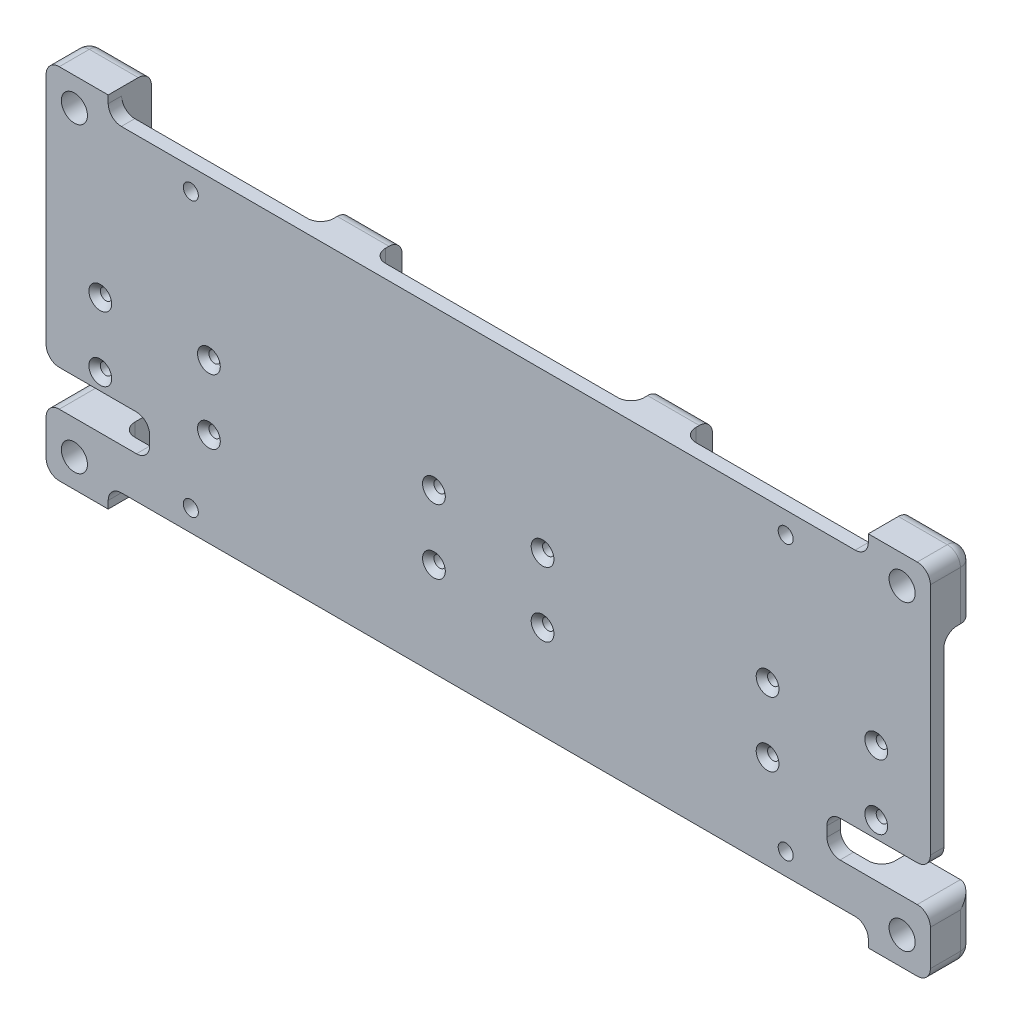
ISO-10303-21;
HEADER;
FILE_DESCRIPTION(('STEP AP214'),'2;1');
FILE_NAME('part.step','',(''),(''),'','','');
FILE_SCHEMA(('AUTOMOTIVE_DESIGN { 1 0 10303 214 1 1 1 1 }'));
ENDSEC;
DATA;
#1=APPLICATION_CONTEXT('core data for automotive mechanical design processes');
#2=APPLICATION_PROTOCOL_DEFINITION('international standard','automotive_design',2000,#1);
#3=PRODUCT_CONTEXT('',#1,'mechanical');
#4=PRODUCT('Part','Part','',(#3));
#5=PRODUCT_RELATED_PRODUCT_CATEGORY('part','',(#4));
#6=PRODUCT_DEFINITION_FORMATION('','',#4);
#7=PRODUCT_DEFINITION_CONTEXT('part definition',#1,'design');
#8=PRODUCT_DEFINITION('design','',#6,#7);
#9=PRODUCT_DEFINITION_SHAPE('','',#8);
#10=(LENGTH_UNIT() NAMED_UNIT(*) SI_UNIT(.MILLI.,.METRE.));
#11=(NAMED_UNIT(*) PLANE_ANGLE_UNIT() SI_UNIT($,.RADIAN.));
#12=(NAMED_UNIT(*) SI_UNIT($,.STERADIAN.) SOLID_ANGLE_UNIT());
#13=UNCERTAINTY_MEASURE_WITH_UNIT(LENGTH_MEASURE(1.E-05),#10,'distance_accuracy_value','');
#14=(GEOMETRIC_REPRESENTATION_CONTEXT(3) GLOBAL_UNCERTAINTY_ASSIGNED_CONTEXT((#13)) GLOBAL_UNIT_ASSIGNED_CONTEXT((#10,
#11,#12)) REPRESENTATION_CONTEXT('',''));
#15=CARTESIAN_POINT('',(0.,0.,0.));
#16=DIRECTION('',(0.,0.,1.));
#17=DIRECTION('',(1.,0.,0.));
#18=AXIS2_PLACEMENT_3D('',#15,#16,#17);
#19=CARTESIAN_POINT('',(85.47,0.,2.6));
#20=DIRECTION('',(-1.,0.,0.));
#21=DIRECTION('',(0.,0.,1.));
#22=AXIS2_PLACEMENT_3D('',#19,#20,#21);
#23=PLANE('',#22);
#24=DIRECTION('',(0.,1.,0.));
#25=VECTOR('',#24,1.);
#26=CARTESIAN_POINT('',(85.47,0.,2.6));
#27=LINE('',#26,#25);
#28=CARTESIAN_POINT('',(85.47,-13.13,2.6));
#29=VERTEX_POINT('',#28);
#30=CARTESIAN_POINT('',(85.47,32.13,2.6));
#31=VERTEX_POINT('',#30);
#32=EDGE_CURVE('E944',#29,#31,#27,.T.);
#33=ORIENTED_EDGE('',*,*,#32,.F.);
#34=DIRECTION('',(0.,0.,-1.));
#35=VECTOR('',#34,1.);
#36=CARTESIAN_POINT('',(85.47,-13.13,0.));
#37=LINE('',#36,#35);
#38=CARTESIAN_POINT('',(85.47,-13.13,0.));
#39=VERTEX_POINT('',#38);
#40=EDGE_CURVE('E1261',#29,#39,#37,.T.);
#41=ORIENTED_EDGE('',*,*,#40,.T.);
#42=DIRECTION('',(0.,1.,0.));
#43=VECTOR('',#42,1.);
#44=CARTESIAN_POINT('',(85.47,0.,0.));
#45=LINE('',#44,#43);
#46=CARTESIAN_POINT('',(85.47,20.13,0.));
#47=VERTEX_POINT('',#46);
#48=EDGE_CURVE('E988',#39,#47,#45,.T.);
#49=ORIENTED_EDGE('',*,*,#48,.T.);
#50=CARTESIAN_POINT('',(85.47,20.13,-2.54));
#51=DIRECTION('',(-1.,0.,0.));
#52=DIRECTION('',(0.,0.,1.));
#53=AXIS2_PLACEMENT_3D('',#50,#51,#52);
#54=CIRCLE('',#53,2.54);
#55=CARTESIAN_POINT('',(85.47,22.67,-2.54));
#56=VERTEX_POINT('',#55);
#57=EDGE_CURVE('E1448',#47,#56,#54,.T.);
#58=ORIENTED_EDGE('',*,*,#57,.T.);
#59=DIRECTION('',(0.,0.,1.));
#60=VECTOR('',#59,1.);
#61=CARTESIAN_POINT('',(85.47,22.67,-5.75));
#62=LINE('',#61,#60);
#63=CARTESIAN_POINT('',(85.47,22.67,-3.21));
#64=VERTEX_POINT('',#63);
#65=EDGE_CURVE('E694',#64,#56,#62,.T.);
#66=ORIENTED_EDGE('',*,*,#65,.F.);
#67=DIRECTION('',(0.,1.,0.));
#68=VECTOR('',#67,1.);
#69=CARTESIAN_POINT('',(85.47,0.,-3.21));
#70=LINE('',#69,#68);
#71=CARTESIAN_POINT('',(85.47,32.13,-3.21));
#72=VERTEX_POINT('',#71);
#73=EDGE_CURVE('E1257',#64,#72,#70,.T.);
#74=ORIENTED_EDGE('',*,*,#73,.T.);
#75=DIRECTION('',(0.,0.,-1.));
#76=VECTOR('',#75,1.);
#77=CARTESIAN_POINT('',(85.47,32.13,2.6));
#78=LINE('',#77,#76);
#79=EDGE_CURVE('E1254',#72,#31,#78,.F.);
#80=ORIENTED_EDGE('',*,*,#79,.T.);
#81=EDGE_LOOP('',(#33,#41,#49,#58,#66,#74,#80));
#82=FACE_BOUND('',#81,.T.);
#83=ADVANCED_FACE('F47',(#82),#23,.F.);
#84=DIRECTION('',(0.,1.,0.));
#85=VECTOR('',#84,1.);
#86=CARTESIAN_POINT('',(85.47,-22.67,-3.21));
#87=LINE('',#86,#85);
#88=CARTESIAN_POINT('',(85.47,-32.13,-3.21));
#89=VERTEX_POINT('',#88);
#90=CARTESIAN_POINT('',(85.47,-25.21,-3.21));
#91=VERTEX_POINT('',#90);
#92=EDGE_CURVE('E1289',#89,#91,#87,.T.);
#93=ORIENTED_EDGE('',*,*,#92,.T.);
#94=DIRECTION('',(0.,0.,1.));
#95=VECTOR('',#94,1.);
#96=CARTESIAN_POINT('',(85.47,-25.21,2.6));
#97=LINE('',#96,#95);
#98=CARTESIAN_POINT('',(85.47,-25.21,2.6));
#99=VERTEX_POINT('',#98);
#100=EDGE_CURVE('E1295',#91,#99,#97,.T.);
#101=ORIENTED_EDGE('',*,*,#100,.T.);
#102=CARTESIAN_POINT('',(85.47,-32.13,2.6));
#103=VERTEX_POINT('',#102);
#104=EDGE_CURVE('E939',#103,#99,#27,.T.);
#105=ORIENTED_EDGE('',*,*,#104,.F.);
#106=DIRECTION('',(0.,0.,-1.));
#107=VECTOR('',#106,1.);
#108=CARTESIAN_POINT('',(85.47,-32.13,2.6));
#109=LINE('',#108,#107);
#110=EDGE_CURVE('E1292',#103,#89,#109,.T.);
#111=ORIENTED_EDGE('',*,*,#110,.T.);
#112=EDGE_LOOP('',(#93,#101,#105,#111));
#113=FACE_BOUND('',#112,.T.);
#114=ADVANCED_FACE('F1738',(#113),#23,.F.);
#115=CARTESIAN_POINT('',(-85.47,0.,2.6));
#116=DIRECTION('',(-1.,0.,0.));
#117=DIRECTION('',(0.,0.,1.));
#118=AXIS2_PLACEMENT_3D('',#115,#116,#117);
#119=PLANE('',#118);
#120=DIRECTION('',(0.,1.,0.));
#121=VECTOR('',#120,1.);
#122=CARTESIAN_POINT('',(-85.47,0.,2.6));
#123=LINE('',#122,#121);
#124=CARTESIAN_POINT('',(-85.47,-32.13,2.6));
#125=VERTEX_POINT('',#124);
#126=CARTESIAN_POINT('',(-85.47,-25.21,2.6));
#127=VERTEX_POINT('',#126);
#128=EDGE_CURVE('E961',#125,#127,#123,.T.);
#129=ORIENTED_EDGE('',*,*,#128,.T.);
#130=DIRECTION('',(0.,0.,1.));
#131=VECTOR('',#130,1.);
#132=CARTESIAN_POINT('',(-85.47,-25.21,2.6));
#133=LINE('',#132,#131);
#134=CARTESIAN_POINT('',(-85.47,-25.21,-3.21));
#135=VERTEX_POINT('',#134);
#136=EDGE_CURVE('E1313',#127,#135,#133,.F.);
#137=ORIENTED_EDGE('',*,*,#136,.T.);
#138=DIRECTION('',(0.,-1.,0.));
#139=VECTOR('',#138,1.);
#140=CARTESIAN_POINT('',(-85.47,0.,-3.21));
#141=LINE('',#140,#139);
#142=CARTESIAN_POINT('',(-85.47,-32.13,-3.21));
#143=VERTEX_POINT('',#142);
#144=EDGE_CURVE('E1307',#135,#143,#141,.T.);
#145=ORIENTED_EDGE('',*,*,#144,.T.);
#146=DIRECTION('',(0.,0.,-1.));
#147=VECTOR('',#146,1.);
#148=CARTESIAN_POINT('',(-85.47,-32.13,2.6));
#149=LINE('',#148,#147);
#150=EDGE_CURVE('E1310',#143,#125,#149,.F.);
#151=ORIENTED_EDGE('',*,*,#150,.T.);
#152=EDGE_LOOP('',(#129,#137,#145,#151));
#153=FACE_BOUND('',#152,.T.);
#154=ADVANCED_FACE('F1781',(#153),#119,.T.);
#155=DIRECTION('',(0.,1.,0.));
#156=VECTOR('',#155,1.);
#157=CARTESIAN_POINT('',(-85.47,0.,0.));
#158=LINE('',#157,#156);
#159=CARTESIAN_POINT('',(-85.47,-13.13,0.));
#160=VERTEX_POINT('',#159);
#161=CARTESIAN_POINT('',(-85.47,20.13,0.));
#162=VERTEX_POINT('',#161);
#163=EDGE_CURVE('E911',#160,#162,#158,.T.);
#164=ORIENTED_EDGE('',*,*,#163,.F.);
#165=DIRECTION('',(0.,0.,-1.));
#166=VECTOR('',#165,1.);
#167=CARTESIAN_POINT('',(-85.47,-13.13,2.6));
#168=LINE('',#167,#166);
#169=CARTESIAN_POINT('',(-85.47,-13.13,2.6));
#170=VERTEX_POINT('',#169);
#171=EDGE_CURVE('E1337',#160,#170,#168,.F.);
#172=ORIENTED_EDGE('',*,*,#171,.T.);
#173=CARTESIAN_POINT('',(-85.47,32.13,2.6));
#174=VERTEX_POINT('',#173);
#175=EDGE_CURVE('E966',#170,#174,#123,.T.);
#176=ORIENTED_EDGE('',*,*,#175,.T.);
#177=DIRECTION('',(0.,0.,-1.));
#178=VECTOR('',#177,1.);
#179=CARTESIAN_POINT('',(-85.47,32.13,2.6));
#180=LINE('',#179,#178);
#181=CARTESIAN_POINT('',(-85.47,32.13,-3.21));
#182=VERTEX_POINT('',#181);
#183=EDGE_CURVE('E1333',#174,#182,#180,.T.);
#184=ORIENTED_EDGE('',*,*,#183,.T.);
#185=DIRECTION('',(0.,-1.,0.));
#186=VECTOR('',#185,1.);
#187=CARTESIAN_POINT('',(-85.47,0.,-3.21));
#188=LINE('',#187,#186);
#189=CARTESIAN_POINT('',(-85.47,22.67,-3.21));
#190=VERTEX_POINT('',#189);
#191=EDGE_CURVE('E1330',#182,#190,#188,.T.);
#192=ORIENTED_EDGE('',*,*,#191,.T.);
#193=DIRECTION('',(0.,0.,1.));
#194=VECTOR('',#193,1.);
#195=CARTESIAN_POINT('',(-85.47,22.67,-5.75));
#196=LINE('',#195,#194);
#197=CARTESIAN_POINT('',(-85.47,22.67,-2.54));
#198=VERTEX_POINT('',#197);
#199=EDGE_CURVE('E669',#190,#198,#196,.T.);
#200=ORIENTED_EDGE('',*,*,#199,.T.);
#201=CARTESIAN_POINT('',(-85.47,20.13,-2.54));
#202=DIRECTION('',(-1.,0.,0.));
#203=DIRECTION('',(0.,0.,1.));
#204=AXIS2_PLACEMENT_3D('',#201,#202,#203);
#205=CIRCLE('',#204,2.54);
#206=EDGE_CURVE('E1421',#198,#162,#205,.F.);
#207=ORIENTED_EDGE('',*,*,#206,.T.);
#208=EDGE_LOOP('',(#164,#172,#176,#184,#192,#200,#207));
#209=FACE_BOUND('',#208,.T.);
#210=ADVANCED_FACE('F2039',(#209),#119,.T.);
#211=CARTESIAN_POINT('',(0.,0.,2.6));
#212=DIRECTION('',(0.,0.,1.));
#213=DIRECTION('',(1.,0.,0.));
#214=AXIS2_PLACEMENT_3D('',#211,#212,#213);
#215=PLANE('',#214);
#216=CARTESIAN_POINT('',(-80.01,29.21,2.6));
#217=DIRECTION('',(0.,0.,1.));
#218=DIRECTION('',(1.,0.,0.));
#219=AXIS2_PLACEMENT_3D('',#216,#217,#218);
#220=CIRCLE('',#219,2.5273);
#221=CARTESIAN_POINT('',(-77.4827,29.21,2.6));
#222=VERTEX_POINT('',#221);
#223=EDGE_CURVE('E1659',#222,#222,#220,.T.);
#224=ORIENTED_EDGE('',*,*,#223,.F.);
#225=EDGE_LOOP('',(#224));
#226=FACE_BOUND('',#225,.T.);
#227=CARTESIAN_POINT('',(80.01,29.21,2.6));
#228=DIRECTION('',(0.,0.,1.));
#229=DIRECTION('',(1.,0.,0.));
#230=AXIS2_PLACEMENT_3D('',#227,#228,#229);
#231=CIRCLE('',#230,2.5273);
#232=CARTESIAN_POINT('',(82.5373,29.21,2.6));
#233=VERTEX_POINT('',#232);
#234=EDGE_CURVE('E1668',#233,#233,#231,.T.);
#235=ORIENTED_EDGE('',*,*,#234,.F.);
#236=EDGE_LOOP('',(#235));
#237=FACE_BOUND('',#236,.T.);
#238=CARTESIAN_POINT('',(80.01,-29.21,2.6));
#239=DIRECTION('',(0.,0.,1.));
#240=DIRECTION('',(1.,0.,0.));
#241=AXIS2_PLACEMENT_3D('',#238,#239,#240);
#242=CIRCLE('',#241,2.5273);
#243=CARTESIAN_POINT('',(82.5373,-29.21,2.6));
#244=VERTEX_POINT('',#243);
#245=EDGE_CURVE('E1676',#244,#244,#242,.T.);
#246=ORIENTED_EDGE('',*,*,#245,.F.);
#247=EDGE_LOOP('',(#246));
#248=FACE_BOUND('',#247,.T.);
#249=CARTESIAN_POINT('',(-80.01,-29.21,2.6));
#250=DIRECTION('',(0.,0.,1.));
#251=DIRECTION('',(1.,0.,0.));
#252=AXIS2_PLACEMENT_3D('',#249,#250,#251);
#253=CIRCLE('',#252,2.5273);
#254=CARTESIAN_POINT('',(-77.4827,-29.21,2.6));
#255=VERTEX_POINT('',#254);
#256=EDGE_CURVE('E1684',#255,#255,#253,.T.);
#257=ORIENTED_EDGE('',*,*,#256,.F.);
#258=EDGE_LOOP('',(#257));
#259=FACE_BOUND('',#258,.T.);
#260=CARTESIAN_POINT('',(-75.,0.,2.6));
#261=DIRECTION('',(0.,0.,1.));
#262=DIRECTION('',(1.,0.,0.));
#263=AXIS2_PLACEMENT_3D('',#260,#261,#262);
#264=CIRCLE('',#263,2.19999999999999);
#265=CARTESIAN_POINT('',(-72.8,0.,2.6));
#266=VERTEX_POINT('',#265);
#267=EDGE_CURVE('E698',#266,#266,#264,.T.);
#268=ORIENTED_EDGE('',*,*,#267,.F.);
#269=EDGE_LOOP('',(#268));
#270=FACE_BOUND('',#269,.T.);
#271=CARTESIAN_POINT('',(-75.,-12.5,2.6));
#272=DIRECTION('',(0.,0.,1.));
#273=DIRECTION('',(1.,0.,0.));
#274=AXIS2_PLACEMENT_3D('',#271,#272,#273);
#275=CIRCLE('',#274,2.19999999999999);
#276=CARTESIAN_POINT('',(-72.8,-12.5,2.6));
#277=VERTEX_POINT('',#276);
#278=EDGE_CURVE('E710',#277,#277,#275,.T.);
#279=ORIENTED_EDGE('',*,*,#278,.F.);
#280=EDGE_LOOP('',(#279));
#281=FACE_BOUND('',#280,.T.);
#282=CARTESIAN_POINT('',(-54.,0.,2.6));
#283=DIRECTION('',(0.,0.,1.));
#284=DIRECTION('',(1.,0.,0.));
#285=AXIS2_PLACEMENT_3D('',#282,#283,#284);
#286=CIRCLE('',#285,2.2);
#287=CARTESIAN_POINT('',(-51.8,0.,2.6));
#288=VERTEX_POINT('',#287);
#289=EDGE_CURVE('E719',#288,#288,#286,.T.);
#290=ORIENTED_EDGE('',*,*,#289,.F.);
#291=EDGE_LOOP('',(#290));
#292=FACE_BOUND('',#291,.T.);
#293=CARTESIAN_POINT('',(-10.5,0.,2.6));
#294=DIRECTION('',(0.,0.,1.));
#295=DIRECTION('',(1.,0.,0.));
#296=AXIS2_PLACEMENT_3D('',#293,#294,#295);
#297=CIRCLE('',#296,2.2);
#298=CARTESIAN_POINT('',(-8.3,0.,2.6));
#299=VERTEX_POINT('',#298);
#300=EDGE_CURVE('E728',#299,#299,#297,.T.);
#301=ORIENTED_EDGE('',*,*,#300,.F.);
#302=EDGE_LOOP('',(#301));
#303=FACE_BOUND('',#302,.T.);
#304=CARTESIAN_POINT('',(-10.5,-12.5,2.6));
#305=DIRECTION('',(0.,0.,1.));
#306=DIRECTION('',(1.,0.,0.));
#307=AXIS2_PLACEMENT_3D('',#304,#305,#306);
#308=CIRCLE('',#307,2.2);
#309=CARTESIAN_POINT('',(-8.3,-12.5,2.6));
#310=VERTEX_POINT('',#309);
#311=EDGE_CURVE('E737',#310,#310,#308,.T.);
#312=ORIENTED_EDGE('',*,*,#311,.F.);
#313=EDGE_LOOP('',(#312));
#314=FACE_BOUND('',#313,.T.);
#315=CARTESIAN_POINT('',(10.5,0.,2.6));
#316=DIRECTION('',(0.,0.,1.));
#317=DIRECTION('',(1.,0.,0.));
#318=AXIS2_PLACEMENT_3D('',#315,#316,#317);
#319=CIRCLE('',#318,2.2);
#320=CARTESIAN_POINT('',(12.7,0.,2.6));
#321=VERTEX_POINT('',#320);
#322=EDGE_CURVE('E746',#321,#321,#319,.T.);
#323=ORIENTED_EDGE('',*,*,#322,.F.);
#324=EDGE_LOOP('',(#323));
#325=FACE_BOUND('',#324,.T.);
#326=CARTESIAN_POINT('',(10.5,-12.5,2.6));
#327=DIRECTION('',(0.,0.,1.));
#328=DIRECTION('',(1.,0.,0.));
#329=AXIS2_PLACEMENT_3D('',#326,#327,#328);
#330=CIRCLE('',#329,2.2);
#331=CARTESIAN_POINT('',(12.7,-12.5,2.6));
#332=VERTEX_POINT('',#331);
#333=EDGE_CURVE('E755',#332,#332,#330,.T.);
#334=ORIENTED_EDGE('',*,*,#333,.F.);
#335=EDGE_LOOP('',(#334));
#336=FACE_BOUND('',#335,.T.);
#337=CARTESIAN_POINT('',(54.,0.,2.6));
#338=DIRECTION('',(0.,0.,1.));
#339=DIRECTION('',(1.,0.,0.));
#340=AXIS2_PLACEMENT_3D('',#337,#338,#339);
#341=CIRCLE('',#340,2.2);
#342=CARTESIAN_POINT('',(56.2,0.,2.6));
#343=VERTEX_POINT('',#342);
#344=EDGE_CURVE('E764',#343,#343,#341,.T.);
#345=ORIENTED_EDGE('',*,*,#344,.F.);
#346=EDGE_LOOP('',(#345));
#347=FACE_BOUND('',#346,.T.);
#348=CARTESIAN_POINT('',(54.,-12.5,2.6));
#349=DIRECTION('',(0.,0.,1.));
#350=DIRECTION('',(1.,0.,0.));
#351=AXIS2_PLACEMENT_3D('',#348,#349,#350);
#352=CIRCLE('',#351,2.2);
#353=CARTESIAN_POINT('',(56.2,-12.5,2.6));
#354=VERTEX_POINT('',#353);
#355=EDGE_CURVE('E773',#354,#354,#352,.T.);
#356=ORIENTED_EDGE('',*,*,#355,.F.);
#357=EDGE_LOOP('',(#356));
#358=FACE_BOUND('',#357,.T.);
#359=CARTESIAN_POINT('',(75.,0.,2.6));
#360=DIRECTION('',(0.,0.,1.));
#361=DIRECTION('',(1.,0.,0.));
#362=AXIS2_PLACEMENT_3D('',#359,#360,#361);
#363=CIRCLE('',#362,2.19999999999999);
#364=CARTESIAN_POINT('',(77.2,0.,2.6));
#365=VERTEX_POINT('',#364);
#366=EDGE_CURVE('E782',#365,#365,#363,.T.);
#367=ORIENTED_EDGE('',*,*,#366,.F.);
#368=EDGE_LOOP('',(#367));
#369=FACE_BOUND('',#368,.T.);
#370=CARTESIAN_POINT('',(75.,-12.5,2.6));
#371=DIRECTION('',(0.,0.,1.));
#372=DIRECTION('',(1.,0.,0.));
#373=AXIS2_PLACEMENT_3D('',#370,#371,#372);
#374=CIRCLE('',#373,2.19999999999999);
#375=CARTESIAN_POINT('',(77.2,-12.5,2.6));
#376=VERTEX_POINT('',#375);
#377=EDGE_CURVE('E791',#376,#376,#374,.T.);
#378=ORIENTED_EDGE('',*,*,#377,.F.);
#379=EDGE_LOOP('',(#378));
#380=FACE_BOUND('',#379,.T.);
#381=CARTESIAN_POINT('',(-54.,-12.5,2.6));
#382=DIRECTION('',(0.,0.,1.));
#383=DIRECTION('',(1.,0.,0.));
#384=AXIS2_PLACEMENT_3D('',#381,#382,#383);
#385=CIRCLE('',#384,2.2);
#386=CARTESIAN_POINT('',(-51.8,-12.5,2.6));
#387=VERTEX_POINT('',#386);
#388=EDGE_CURVE('E800',#387,#387,#385,.T.);
#389=ORIENTED_EDGE('',*,*,#388,.F.);
#390=EDGE_LOOP('',(#389));
#391=FACE_BOUND('',#390,.T.);
#392=CARTESIAN_POINT('',(57.5,-26.5,2.6));
#393=DIRECTION('',(0.,0.,1.));
#394=DIRECTION('',(1.,0.,0.));
#395=AXIS2_PLACEMENT_3D('',#392,#393,#394);
#396=CIRCLE('',#395,1.44999999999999);
#397=CARTESIAN_POINT('',(58.95,-26.5,2.6));
#398=VERTEX_POINT('',#397);
#399=EDGE_CURVE('E906',#398,#398,#396,.T.);
#400=ORIENTED_EDGE('',*,*,#399,.F.);
#401=EDGE_LOOP('',(#400));
#402=FACE_BOUND('',#401,.T.);
#403=CARTESIAN_POINT('',(57.5,26.5,2.6));
#404=DIRECTION('',(0.,0.,1.));
#405=DIRECTION('',(1.,0.,0.));
#406=AXIS2_PLACEMENT_3D('',#403,#404,#405);
#407=CIRCLE('',#406,1.44999999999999);
#408=CARTESIAN_POINT('',(58.95,26.5,2.6));
#409=VERTEX_POINT('',#408);
#410=EDGE_CURVE('E910',#409,#409,#407,.T.);
#411=ORIENTED_EDGE('',*,*,#410,.F.);
#412=EDGE_LOOP('',(#411));
#413=FACE_BOUND('',#412,.T.);
#414=CARTESIAN_POINT('',(-57.5,-26.5,2.6));
#415=DIRECTION('',(0.,0.,1.));
#416=DIRECTION('',(1.,0.,0.));
#417=AXIS2_PLACEMENT_3D('',#414,#415,#416);
#418=CIRCLE('',#417,1.44999999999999);
#419=CARTESIAN_POINT('',(-56.05,-26.5,2.6));
#420=VERTEX_POINT('',#419);
#421=EDGE_CURVE('E915',#420,#420,#418,.T.);
#422=ORIENTED_EDGE('',*,*,#421,.F.);
#423=EDGE_LOOP('',(#422));
#424=FACE_BOUND('',#423,.T.);
#425=CARTESIAN_POINT('',(-57.5,26.5,2.6));
#426=DIRECTION('',(0.,0.,1.));
#427=DIRECTION('',(1.,0.,0.));
#428=AXIS2_PLACEMENT_3D('',#425,#426,#427);
#429=CIRCLE('',#428,1.44999999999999);
#430=CARTESIAN_POINT('',(-56.05,26.5,2.6));
#431=VERTEX_POINT('',#430);
#432=EDGE_CURVE('E919',#431,#431,#429,.T.);
#433=ORIENTED_EDGE('',*,*,#432,.F.);
#434=EDGE_LOOP('',(#433));
#435=FACE_BOUND('',#434,.T.);
#436=DIRECTION('',(-1.,0.,0.));
#437=VECTOR('',#436,1.);
#438=CARTESIAN_POINT('',(85.47,-15.67,2.6));
#439=LINE('',#438,#437);
#440=CARTESIAN_POINT('',(82.93,-15.67,2.6));
#441=VERTEX_POINT('',#440);
#442=CARTESIAN_POINT('',(68.01,-15.67,2.6));
#443=VERTEX_POINT('',#442);
#444=EDGE_CURVE('E1979',#441,#443,#439,.T.);
#445=ORIENTED_EDGE('',*,*,#444,.F.);
#446=CARTESIAN_POINT('',(82.93,-13.13,2.6));
#447=DIRECTION('',(0.,0.,1.));
#448=DIRECTION('',(1.,0.,0.));
#449=AXIS2_PLACEMENT_3D('',#446,#447,#448);
#450=CIRCLE('',#449,2.54);
#451=EDGE_CURVE('E1286',#441,#29,#450,.T.);
#452=ORIENTED_EDGE('',*,*,#451,.T.);
#453=ORIENTED_EDGE('',*,*,#32,.T.);
#454=CARTESIAN_POINT('',(82.93,32.13,2.6));
#455=DIRECTION('',(0.,0.,1.));
#456=DIRECTION('',(1.,0.,0.));
#457=AXIS2_PLACEMENT_3D('',#454,#455,#456);
#458=CIRCLE('',#457,2.54);
#459=CARTESIAN_POINT('',(82.93,34.67,2.6));
#460=VERTEX_POINT('',#459);
#461=EDGE_CURVE('E1265',#31,#460,#458,.T.);
#462=ORIENTED_EDGE('',*,*,#461,.T.);
#463=DIRECTION('',(1.,0.,0.));
#464=VECTOR('',#463,1.);
#465=CARTESIAN_POINT('',(0.,34.67,2.6));
#466=LINE('',#465,#464);
#467=CARTESIAN_POINT('',(73.47,34.67,2.6));
#468=VERTEX_POINT('',#467);
#469=EDGE_CURVE('E943',#468,#460,#466,.T.);
#470=ORIENTED_EDGE('',*,*,#469,.F.);
#471=DIRECTION('',(0.,-1.,0.));
#472=VECTOR('',#471,1.);
#473=CARTESIAN_POINT('',(73.47,0.,2.6));
#474=LINE('',#473,#472);
#475=CARTESIAN_POINT('',(73.47,33.21,2.6));
#476=VERTEX_POINT('',#475);
#477=EDGE_CURVE('E948',#468,#476,#474,.T.);
#478=ORIENTED_EDGE('',*,*,#477,.T.);
#479=CARTESIAN_POINT('',(70.93,33.21,2.6));
#480=DIRECTION('',(0.,0.,1.));
#481=DIRECTION('',(1.,0.,0.));
#482=AXIS2_PLACEMENT_3D('',#479,#480,#481);
#483=CIRCLE('',#482,2.54);
#484=CARTESIAN_POINT('',(70.93,30.67,2.6));
#485=VERTEX_POINT('',#484);
#486=EDGE_CURVE('E1415',#476,#485,#483,.F.);
#487=ORIENTED_EDGE('',*,*,#486,.T.);
#488=DIRECTION('',(1.,0.,0.));
#489=VECTOR('',#488,1.);
#490=CARTESIAN_POINT('',(0.,30.67,2.6));
#491=LINE('',#490,#489);
#492=CARTESIAN_POINT('',(-70.93,30.67,2.6));
#493=VERTEX_POINT('',#492);
#494=EDGE_CURVE('E953',#493,#485,#491,.T.);
#495=ORIENTED_EDGE('',*,*,#494,.F.);
#496=CARTESIAN_POINT('',(-70.93,33.21,2.6));
#497=DIRECTION('',(0.,0.,1.));
#498=DIRECTION('',(1.,0.,0.));
#499=AXIS2_PLACEMENT_3D('',#496,#497,#498);
#500=CIRCLE('',#499,2.54);
#501=CARTESIAN_POINT('',(-73.47,33.21,2.6));
#502=VERTEX_POINT('',#501);
#503=EDGE_CURVE('E1402',#493,#502,#500,.F.);
#504=ORIENTED_EDGE('',*,*,#503,.T.);
#505=DIRECTION('',(0.,-1.,0.));
#506=VECTOR('',#505,1.);
#507=CARTESIAN_POINT('',(-73.47,0.,2.6));
#508=LINE('',#507,#506);
#509=CARTESIAN_POINT('',(-73.47,34.67,2.6));
#510=VERTEX_POINT('',#509);
#511=EDGE_CURVE('E957',#510,#502,#508,.T.);
#512=ORIENTED_EDGE('',*,*,#511,.F.);
#513=CARTESIAN_POINT('',(-82.93,34.67,2.6));
#514=VERTEX_POINT('',#513);
#515=EDGE_CURVE('E949',#514,#510,#466,.T.);
#516=ORIENTED_EDGE('',*,*,#515,.F.);
#517=CARTESIAN_POINT('',(-82.93,32.13,2.6));
#518=DIRECTION('',(0.,0.,1.));
#519=DIRECTION('',(1.,0.,0.));
#520=AXIS2_PLACEMENT_3D('',#517,#518,#519);
#521=CIRCLE('',#520,2.54);
#522=EDGE_CURVE('E1271',#514,#174,#521,.T.);
#523=ORIENTED_EDGE('',*,*,#522,.T.);
#524=ORIENTED_EDGE('',*,*,#175,.F.);
#525=CARTESIAN_POINT('',(-82.93,-13.13,2.6));
#526=DIRECTION('',(0.,0.,1.));
#527=DIRECTION('',(1.,0.,0.));
#528=AXIS2_PLACEMENT_3D('',#525,#526,#527);
#529=CIRCLE('',#528,2.54);
#530=CARTESIAN_POINT('',(-82.93,-15.67,2.6));
#531=VERTEX_POINT('',#530);
#532=EDGE_CURVE('E1277',#170,#531,#529,.T.);
#533=ORIENTED_EDGE('',*,*,#532,.T.);
#534=DIRECTION('',(-1.,0.,0.));
#535=VECTOR('',#534,1.);
#536=CARTESIAN_POINT('',(-85.47,-15.67,2.6));
#537=LINE('',#536,#535);
#538=CARTESIAN_POINT('',(-68.01,-15.67,2.6));
#539=VERTEX_POINT('',#538);
#540=EDGE_CURVE('E1489',#539,#531,#537,.T.);
#541=ORIENTED_EDGE('',*,*,#540,.F.);
#542=CARTESIAN_POINT('',(-68.01,-18.21,2.6));
#543=DIRECTION('',(0.,0.,1.));
#544=DIRECTION('',(1.,0.,0.));
#545=AXIS2_PLACEMENT_3D('',#542,#543,#544);
#546=CIRCLE('',#545,2.54);
#547=CARTESIAN_POINT('',(-65.47,-18.21,2.6));
#548=VERTEX_POINT('',#547);
#549=EDGE_CURVE('E1476',#539,#548,#546,.F.);
#550=ORIENTED_EDGE('',*,*,#549,.T.);
#551=DIRECTION('',(0.,1.,0.));
#552=VECTOR('',#551,1.);
#553=CARTESIAN_POINT('',(-65.47,-15.67,2.6));
#554=LINE('',#553,#552);
#555=CARTESIAN_POINT('',(-65.47,-20.13,2.6));
#556=VERTEX_POINT('',#555);
#557=EDGE_CURVE('E1652',#556,#548,#554,.T.);
#558=ORIENTED_EDGE('',*,*,#557,.F.);
#559=CARTESIAN_POINT('',(-68.01,-20.13,2.6));
#560=DIRECTION('',(0.,0.,1.));
#561=DIRECTION('',(1.,0.,0.));
#562=AXIS2_PLACEMENT_3D('',#559,#560,#561);
#563=CIRCLE('',#562,2.54);
#564=CARTESIAN_POINT('',(-68.01,-22.67,2.6));
#565=VERTEX_POINT('',#564);
#566=EDGE_CURVE('E1470',#556,#565,#563,.F.);
#567=ORIENTED_EDGE('',*,*,#566,.T.);
#568=DIRECTION('',(1.,0.,0.));
#569=VECTOR('',#568,1.);
#570=CARTESIAN_POINT('',(-85.47,-22.67,2.6));
#571=LINE('',#570,#569);
#572=CARTESIAN_POINT('',(-82.93,-22.67,2.6));
#573=VERTEX_POINT('',#572);
#574=EDGE_CURVE('E1656',#573,#565,#571,.T.);
#575=ORIENTED_EDGE('',*,*,#574,.F.);
#576=CARTESIAN_POINT('',(-82.93,-25.21,2.6));
#577=DIRECTION('',(0.,0.,1.));
#578=DIRECTION('',(1.,0.,0.));
#579=AXIS2_PLACEMENT_3D('',#576,#577,#578);
#580=CIRCLE('',#579,2.54);
#581=EDGE_CURVE('E1280',#573,#127,#580,.T.);
#582=ORIENTED_EDGE('',*,*,#581,.T.);
#583=ORIENTED_EDGE('',*,*,#128,.F.);
#584=CARTESIAN_POINT('',(-82.93,-32.13,2.6));
#585=DIRECTION('',(0.,0.,1.));
#586=DIRECTION('',(1.,0.,0.));
#587=AXIS2_PLACEMENT_3D('',#584,#585,#586);
#588=CIRCLE('',#587,2.54);
#589=CARTESIAN_POINT('',(-82.93,-34.67,2.6));
#590=VERTEX_POINT('',#589);
#591=EDGE_CURVE('E1274',#125,#590,#588,.T.);
#592=ORIENTED_EDGE('',*,*,#591,.T.);
#593=DIRECTION('',(1.,0.,0.));
#594=VECTOR('',#593,1.);
#595=CARTESIAN_POINT('',(0.,-34.67,2.6));
#596=LINE('',#595,#594);
#597=CARTESIAN_POINT('',(-73.47,-34.67,2.6));
#598=VERTEX_POINT('',#597);
#599=EDGE_CURVE('E923',#590,#598,#596,.T.);
#600=ORIENTED_EDGE('',*,*,#599,.T.);
#601=DIRECTION('',(0.,1.,0.));
#602=VECTOR('',#601,1.);
#603=CARTESIAN_POINT('',(-73.47,0.,2.6));
#604=LINE('',#603,#602);
#605=CARTESIAN_POINT('',(-73.47,-33.21,2.6));
#606=VERTEX_POINT('',#605);
#607=EDGE_CURVE('E926',#598,#606,#604,.T.);
#608=ORIENTED_EDGE('',*,*,#607,.T.);
#609=CARTESIAN_POINT('',(-70.93,-33.21,2.6));
#610=DIRECTION('',(0.,0.,1.));
#611=DIRECTION('',(1.,0.,0.));
#612=AXIS2_PLACEMENT_3D('',#609,#610,#611);
#613=CIRCLE('',#612,2.54);
#614=CARTESIAN_POINT('',(-70.93,-30.67,2.6));
#615=VERTEX_POINT('',#614);
#616=EDGE_CURVE('E1405',#606,#615,#613,.F.);
#617=ORIENTED_EDGE('',*,*,#616,.T.);
#618=DIRECTION('',(1.,0.,0.));
#619=VECTOR('',#618,1.);
#620=CARTESIAN_POINT('',(0.,-30.67,2.6));
#621=LINE('',#620,#619);
#622=CARTESIAN_POINT('',(70.93,-30.67,2.6));
#623=VERTEX_POINT('',#622);
#624=EDGE_CURVE('E931',#615,#623,#621,.T.);
#625=ORIENTED_EDGE('',*,*,#624,.T.);
#626=CARTESIAN_POINT('',(70.93,-33.21,2.6));
#627=DIRECTION('',(0.,0.,1.));
#628=DIRECTION('',(1.,0.,0.));
#629=AXIS2_PLACEMENT_3D('',#626,#627,#628);
#630=CIRCLE('',#629,2.54);
#631=CARTESIAN_POINT('',(73.47,-33.21,2.6));
#632=VERTEX_POINT('',#631);
#633=EDGE_CURVE('E1408',#623,#632,#630,.F.);
#634=ORIENTED_EDGE('',*,*,#633,.T.);
#635=DIRECTION('',(0.,1.,0.));
#636=VECTOR('',#635,1.);
#637=CARTESIAN_POINT('',(73.47,0.,2.6));
#638=LINE('',#637,#636);
#639=CARTESIAN_POINT('',(73.47,-34.67,2.6));
#640=VERTEX_POINT('',#639);
#641=EDGE_CURVE('E935',#640,#632,#638,.T.);
#642=ORIENTED_EDGE('',*,*,#641,.F.);
#643=CARTESIAN_POINT('',(82.93,-34.67,2.6));
#644=VERTEX_POINT('',#643);
#645=EDGE_CURVE('E927',#640,#644,#596,.T.);
#646=ORIENTED_EDGE('',*,*,#645,.T.);
#647=CARTESIAN_POINT('',(82.93,-32.13,2.6));
#648=DIRECTION('',(0.,0.,1.));
#649=DIRECTION('',(1.,0.,0.));
#650=AXIS2_PLACEMENT_3D('',#647,#648,#649);
#651=CIRCLE('',#650,2.54);
#652=EDGE_CURVE('E1268',#644,#103,#651,.T.);
#653=ORIENTED_EDGE('',*,*,#652,.T.);
#654=ORIENTED_EDGE('',*,*,#104,.T.);
#655=CARTESIAN_POINT('',(82.93,-25.21,2.6));
#656=DIRECTION('',(0.,0.,1.));
#657=DIRECTION('',(1.,0.,0.));
#658=AXIS2_PLACEMENT_3D('',#655,#656,#657);
#659=CIRCLE('',#658,2.54);
#660=CARTESIAN_POINT('',(82.93,-22.67,2.6));
#661=VERTEX_POINT('',#660);
#662=EDGE_CURVE('E1283',#99,#661,#659,.T.);
#663=ORIENTED_EDGE('',*,*,#662,.T.);
#664=DIRECTION('',(1.,0.,0.));
#665=VECTOR('',#664,1.);
#666=CARTESIAN_POINT('',(85.47,-22.67,2.6));
#667=LINE('',#666,#665);
#668=CARTESIAN_POINT('',(68.01,-22.67,2.6));
#669=VERTEX_POINT('',#668);
#670=EDGE_CURVE('E1664',#669,#661,#667,.T.);
#671=ORIENTED_EDGE('',*,*,#670,.F.);
#672=CARTESIAN_POINT('',(68.01,-20.13,2.6));
#673=DIRECTION('',(0.,0.,1.));
#674=DIRECTION('',(1.,0.,0.));
#675=AXIS2_PLACEMENT_3D('',#672,#673,#674);
#676=CIRCLE('',#675,2.54);
#677=CARTESIAN_POINT('',(65.47,-20.13,2.6));
#678=VERTEX_POINT('',#677);
#679=EDGE_CURVE('E1458',#669,#678,#676,.F.);
#680=ORIENTED_EDGE('',*,*,#679,.T.);
#681=DIRECTION('',(0.,-1.,0.));
#682=VECTOR('',#681,1.);
#683=CARTESIAN_POINT('',(65.47,-15.67,2.6));
#684=LINE('',#683,#682);
#685=CARTESIAN_POINT('',(65.47,-18.21,2.6));
#686=VERTEX_POINT('',#685);
#687=EDGE_CURVE('E1753',#686,#678,#684,.T.);
#688=ORIENTED_EDGE('',*,*,#687,.F.);
#689=CARTESIAN_POINT('',(68.01,-18.21,2.6));
#690=DIRECTION('',(0.,0.,1.));
#691=DIRECTION('',(1.,0.,0.));
#692=AXIS2_PLACEMENT_3D('',#689,#690,#691);
#693=CIRCLE('',#692,2.54);
#694=EDGE_CURVE('E1464',#686,#443,#693,.F.);
#695=ORIENTED_EDGE('',*,*,#694,.T.);
#696=EDGE_LOOP('',(#445,#452,#453,#462,#470,#478,#487,#495,#504,#512,#516,#523,#524,#533,#541,
#550,#558,#567,#575,#582,#583,#592,#600,#608,#617,#625,#634,#642,#646,#653,#654,#663,#671,#680,
#688,#695));
#697=FACE_BOUND('',#696,.T.);
#698=ADVANCED_FACE('F1720',(#226,#237,#248,#259,#270,#281,#292,#303,#314,#325,#336,#347,#358,
#369,#380,#391,#402,#413,#424,#435,#697),#215,.T.);
#699=CARTESIAN_POINT('',(0.,0.,0.));
#700=DIRECTION('',(0.,0.,1.));
#701=DIRECTION('',(1.,0.,0.));
#702=AXIS2_PLACEMENT_3D('',#699,#700,#701);
#703=PLANE('',#702);
#704=CARTESIAN_POINT('',(-75.,-12.5,0.));
#705=DIRECTION('',(0.,0.,1.));
#706=DIRECTION('',(1.,0.,0.));
#707=AXIS2_PLACEMENT_3D('',#704,#705,#706);
#708=CIRCLE('',#707,2.50000000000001);
#709=CARTESIAN_POINT('',(-72.5,-12.5,0.));
#710=VERTEX_POINT('',#709);
#711=EDGE_CURVE('E809',#710,#710,#708,.T.);
#712=ORIENTED_EDGE('',*,*,#711,.T.);
#713=EDGE_LOOP('',(#712));
#714=FACE_BOUND('',#713,.T.);
#715=CARTESIAN_POINT('',(-54.,-12.5,0.));
#716=DIRECTION('',(0.,0.,1.));
#717=DIRECTION('',(1.,0.,0.));
#718=AXIS2_PLACEMENT_3D('',#715,#716,#717);
#719=CIRCLE('',#718,2.5);
#720=CARTESIAN_POINT('',(-51.5,-12.5,0.));
#721=VERTEX_POINT('',#720);
#722=EDGE_CURVE('E818',#721,#721,#719,.T.);
#723=ORIENTED_EDGE('',*,*,#722,.T.);
#724=EDGE_LOOP('',(#723));
#725=FACE_BOUND('',#724,.T.);
#726=CARTESIAN_POINT('',(-10.5,-12.5,0.));
#727=DIRECTION('',(0.,0.,1.));
#728=DIRECTION('',(1.,0.,0.));
#729=AXIS2_PLACEMENT_3D('',#726,#727,#728);
#730=CIRCLE('',#729,2.5);
#731=CARTESIAN_POINT('',(-7.99999999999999,-12.5,0.));
#732=VERTEX_POINT('',#731);
#733=EDGE_CURVE('E826',#732,#732,#730,.T.);
#734=ORIENTED_EDGE('',*,*,#733,.T.);
#735=EDGE_LOOP('',(#734));
#736=FACE_BOUND('',#735,.T.);
#737=CARTESIAN_POINT('',(10.5,-12.5,0.));
#738=DIRECTION('',(0.,0.,1.));
#739=DIRECTION('',(-1.,0.,0.));
#740=AXIS2_PLACEMENT_3D('',#737,#738,#739);
#741=CIRCLE('',#740,2.5);
#742=CARTESIAN_POINT('',(8.,-12.5,0.));
#743=VERTEX_POINT('',#742);
#744=EDGE_CURVE('E834',#743,#743,#741,.T.);
#745=ORIENTED_EDGE('',*,*,#744,.T.);
#746=EDGE_LOOP('',(#745));
#747=FACE_BOUND('',#746,.T.);
#748=CARTESIAN_POINT('',(54.,-12.5,0.));
#749=DIRECTION('',(0.,0.,1.));
#750=DIRECTION('',(-1.,0.,0.));
#751=AXIS2_PLACEMENT_3D('',#748,#749,#750);
#752=CIRCLE('',#751,2.5);
#753=CARTESIAN_POINT('',(51.5,-12.5,0.));
#754=VERTEX_POINT('',#753);
#755=EDGE_CURVE('E842',#754,#754,#752,.T.);
#756=ORIENTED_EDGE('',*,*,#755,.T.);
#757=EDGE_LOOP('',(#756));
#758=FACE_BOUND('',#757,.T.);
#759=CARTESIAN_POINT('',(75.,-12.5,0.));
#760=DIRECTION('',(0.,0.,1.));
#761=DIRECTION('',(-1.,0.,0.));
#762=AXIS2_PLACEMENT_3D('',#759,#760,#761);
#763=CIRCLE('',#762,2.50000000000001);
#764=CARTESIAN_POINT('',(72.5,-12.5,0.));
#765=VERTEX_POINT('',#764);
#766=EDGE_CURVE('E850',#765,#765,#763,.T.);
#767=ORIENTED_EDGE('',*,*,#766,.T.);
#768=EDGE_LOOP('',(#767));
#769=FACE_BOUND('',#768,.T.);
#770=CARTESIAN_POINT('',(-75.,0.,0.));
#771=DIRECTION('',(0.,0.,1.));
#772=DIRECTION('',(-1.,0.,0.));
#773=AXIS2_PLACEMENT_3D('',#770,#771,#772);
#774=CIRCLE('',#773,2.49999999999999);
#775=CARTESIAN_POINT('',(-77.5,0.,0.));
#776=VERTEX_POINT('',#775);
#777=EDGE_CURVE('E858',#776,#776,#774,.T.);
#778=ORIENTED_EDGE('',*,*,#777,.T.);
#779=EDGE_LOOP('',(#778));
#780=FACE_BOUND('',#779,.T.);
#781=CARTESIAN_POINT('',(-54.,0.,0.));
#782=DIRECTION('',(0.,0.,1.));
#783=DIRECTION('',(-1.,0.,0.));
#784=AXIS2_PLACEMENT_3D('',#781,#782,#783);
#785=CIRCLE('',#784,2.5);
#786=CARTESIAN_POINT('',(-56.5,0.,0.));
#787=VERTEX_POINT('',#786);
#788=EDGE_CURVE('E866',#787,#787,#785,.T.);
#789=ORIENTED_EDGE('',*,*,#788,.T.);
#790=EDGE_LOOP('',(#789));
#791=FACE_BOUND('',#790,.T.);
#792=CARTESIAN_POINT('',(-10.5,0.,0.));
#793=DIRECTION('',(0.,0.,1.));
#794=DIRECTION('',(-1.,0.,0.));
#795=AXIS2_PLACEMENT_3D('',#792,#793,#794);
#796=CIRCLE('',#795,2.5);
#797=CARTESIAN_POINT('',(-13.,0.,0.));
#798=VERTEX_POINT('',#797);
#799=EDGE_CURVE('E874',#798,#798,#796,.T.);
#800=ORIENTED_EDGE('',*,*,#799,.T.);
#801=EDGE_LOOP('',(#800));
#802=FACE_BOUND('',#801,.T.);
#803=CARTESIAN_POINT('',(10.5,0.,0.));
#804=DIRECTION('',(0.,0.,1.));
#805=DIRECTION('',(1.,0.,0.));
#806=AXIS2_PLACEMENT_3D('',#803,#804,#805);
#807=CIRCLE('',#806,2.5);
#808=CARTESIAN_POINT('',(13.,0.,0.));
#809=VERTEX_POINT('',#808);
#810=EDGE_CURVE('E882',#809,#809,#807,.T.);
#811=ORIENTED_EDGE('',*,*,#810,.T.);
#812=EDGE_LOOP('',(#811));
#813=FACE_BOUND('',#812,.T.);
#814=CARTESIAN_POINT('',(54.,0.,0.));
#815=DIRECTION('',(0.,0.,1.));
#816=DIRECTION('',(1.,0.,0.));
#817=AXIS2_PLACEMENT_3D('',#814,#815,#816);
#818=CIRCLE('',#817,2.5);
#819=CARTESIAN_POINT('',(56.5,0.,0.));
#820=VERTEX_POINT('',#819);
#821=EDGE_CURVE('E890',#820,#820,#818,.T.);
#822=ORIENTED_EDGE('',*,*,#821,.T.);
#823=EDGE_LOOP('',(#822));
#824=FACE_BOUND('',#823,.T.);
#825=CARTESIAN_POINT('',(75.,0.,0.));
#826=DIRECTION('',(0.,0.,1.));
#827=DIRECTION('',(1.,0.,0.));
#828=AXIS2_PLACEMENT_3D('',#825,#826,#827);
#829=CIRCLE('',#828,2.49999999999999);
#830=CARTESIAN_POINT('',(77.5,0.,0.));
#831=VERTEX_POINT('',#830);
#832=EDGE_CURVE('E894',#831,#831,#829,.T.);
#833=ORIENTED_EDGE('',*,*,#832,.T.);
#834=EDGE_LOOP('',(#833));
#835=FACE_BOUND('',#834,.T.);
#836=CARTESIAN_POINT('',(57.5,-26.5,0.));
#837=DIRECTION('',(0.,0.,1.));
#838=DIRECTION('',(1.,0.,0.));
#839=AXIS2_PLACEMENT_3D('',#836,#837,#838);
#840=CIRCLE('',#839,1.44999999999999);
#841=CARTESIAN_POINT('',(58.95,-26.5,0.));
#842=VERTEX_POINT('',#841);
#843=EDGE_CURVE('E902',#842,#842,#840,.T.);
#844=ORIENTED_EDGE('',*,*,#843,.T.);
#845=EDGE_LOOP('',(#844));
#846=FACE_BOUND('',#845,.T.);
#847=CARTESIAN_POINT('',(57.5,26.5,0.));
#848=DIRECTION('',(0.,0.,1.));
#849=DIRECTION('',(1.,0.,0.));
#850=AXIS2_PLACEMENT_3D('',#847,#848,#849);
#851=CIRCLE('',#850,1.44999999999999);
#852=CARTESIAN_POINT('',(58.95,26.5,0.));
#853=VERTEX_POINT('',#852);
#854=EDGE_CURVE('E970',#853,#853,#851,.T.);
#855=ORIENTED_EDGE('',*,*,#854,.T.);
#856=EDGE_LOOP('',(#855));
#857=FACE_BOUND('',#856,.T.);
#858=CARTESIAN_POINT('',(-57.5,-26.5,0.));
#859=DIRECTION('',(0.,0.,1.));
#860=DIRECTION('',(1.,0.,0.));
#861=AXIS2_PLACEMENT_3D('',#858,#859,#860);
#862=CIRCLE('',#861,1.44999999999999);
#863=CARTESIAN_POINT('',(-56.05,-26.5,0.));
#864=VERTEX_POINT('',#863);
#865=EDGE_CURVE('E974',#864,#864,#862,.T.);
#866=ORIENTED_EDGE('',*,*,#865,.T.);
#867=EDGE_LOOP('',(#866));
#868=FACE_BOUND('',#867,.T.);
#869=CARTESIAN_POINT('',(-57.5,26.5,0.));
#870=DIRECTION('',(0.,0.,1.));
#871=DIRECTION('',(1.,0.,0.));
#872=AXIS2_PLACEMENT_3D('',#869,#870,#871);
#873=CIRCLE('',#872,1.44999999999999);
#874=CARTESIAN_POINT('',(-56.05,26.5,0.));
#875=VERTEX_POINT('',#874);
#876=EDGE_CURVE('E978',#875,#875,#873,.T.);
#877=ORIENTED_EDGE('',*,*,#876,.T.);
#878=EDGE_LOOP('',(#877));
#879=FACE_BOUND('',#878,.T.);
#880=DIRECTION('',(1.,0.,0.));
#881=VECTOR('',#880,1.);
#882=CARTESIAN_POINT('',(85.47,-22.67,0.));
#883=LINE('',#882,#881);
#884=CARTESIAN_POINT('',(68.01,-22.67,0.));
#885=VERTEX_POINT('',#884);
#886=CARTESIAN_POINT('',(70.93,-22.67,0.));
#887=VERTEX_POINT('',#886);
#888=EDGE_CURVE('E1975',#885,#887,#883,.T.);
#889=ORIENTED_EDGE('',*,*,#888,.T.);
#890=DIRECTION('',(0.,-1.,0.));
#891=VECTOR('',#890,1.);
#892=CARTESIAN_POINT('',(70.93,0.,0.));
#893=LINE('',#892,#891);
#894=CARTESIAN_POINT('',(70.93,-30.67,0.));
#895=VERTEX_POINT('',#894);
#896=EDGE_CURVE('E1568',#887,#895,#893,.T.);
#897=ORIENTED_EDGE('',*,*,#896,.T.);
#898=DIRECTION('',(1.,0.,0.));
#899=VECTOR('',#898,1.);
#900=CARTESIAN_POINT('',(0.,-30.67,0.));
#901=LINE('',#900,#899);
#902=CARTESIAN_POINT('',(37.54,-30.67,0.));
#903=VERTEX_POINT('',#902);
#904=EDGE_CURVE('E982',#903,#895,#901,.T.);
#905=ORIENTED_EDGE('',*,*,#904,.F.);
#906=DIRECTION('',(0.,1.,0.));
#907=VECTOR('',#906,1.);
#908=CARTESIAN_POINT('',(37.54,0.,0.));
#909=LINE('',#908,#907);
#910=CARTESIAN_POINT('',(37.54,-18.13,0.));
#911=VERTEX_POINT('',#910);
#912=EDGE_CURVE('E1139',#903,#911,#909,.T.);
#913=ORIENTED_EDGE('',*,*,#912,.T.);
#914=DIRECTION('',(-1.,0.,0.));
#915=VECTOR('',#914,1.);
#916=CARTESIAN_POINT('',(0.,-18.13,0.));
#917=LINE('',#916,#915);
#918=CARTESIAN_POINT('',(22.46,-18.13,0.));
#919=VERTEX_POINT('',#918);
#920=EDGE_CURVE('E1142',#911,#919,#917,.T.);
#921=ORIENTED_EDGE('',*,*,#920,.T.);
#922=DIRECTION('',(0.,-1.,0.));
#923=VECTOR('',#922,1.);
#924=CARTESIAN_POINT('',(22.46,0.,0.));
#925=LINE('',#924,#923);
#926=CARTESIAN_POINT('',(22.46,-30.67,0.));
#927=VERTEX_POINT('',#926);
#928=EDGE_CURVE('E1145',#919,#927,#925,.T.);
#929=ORIENTED_EDGE('',*,*,#928,.T.);
#930=CARTESIAN_POINT('',(-22.46,-30.67,0.));
#931=VERTEX_POINT('',#930);
#932=EDGE_CURVE('E986',#931,#927,#901,.T.);
#933=ORIENTED_EDGE('',*,*,#932,.F.);
#934=DIRECTION('',(0.,1.,0.));
#935=VECTOR('',#934,1.);
#936=CARTESIAN_POINT('',(-22.46,0.,0.));
#937=LINE('',#936,#935);
#938=CARTESIAN_POINT('',(-22.46,-18.13,0.));
#939=VERTEX_POINT('',#938);
#940=EDGE_CURVE('E1149',#931,#939,#937,.T.);
#941=ORIENTED_EDGE('',*,*,#940,.T.);
#942=DIRECTION('',(-1.,0.,0.));
#943=VECTOR('',#942,1.);
#944=CARTESIAN_POINT('',(0.,-18.13,0.));
#945=LINE('',#944,#943);
#946=CARTESIAN_POINT('',(-37.54,-18.13,0.));
#947=VERTEX_POINT('',#946);
#948=EDGE_CURVE('E1152',#939,#947,#945,.T.);
#949=ORIENTED_EDGE('',*,*,#948,.T.);
#950=DIRECTION('',(0.,-1.,0.));
#951=VECTOR('',#950,1.);
#952=CARTESIAN_POINT('',(-37.54,0.,0.));
#953=LINE('',#952,#951);
#954=CARTESIAN_POINT('',(-37.54,-30.67,0.));
#955=VERTEX_POINT('',#954);
#956=EDGE_CURVE('E1155',#947,#955,#953,.T.);
#957=ORIENTED_EDGE('',*,*,#956,.T.);
#958=CARTESIAN_POINT('',(-70.93,-30.67,0.));
#959=VERTEX_POINT('',#958);
#960=EDGE_CURVE('E987',#959,#955,#901,.T.);
#961=ORIENTED_EDGE('',*,*,#960,.F.);
#962=DIRECTION('',(0.,1.,0.));
#963=VECTOR('',#962,1.);
#964=CARTESIAN_POINT('',(-70.93,-22.67,0.));
#965=LINE('',#964,#963);
#966=CARTESIAN_POINT('',(-70.93,-22.67,0.));
#967=VERTEX_POINT('',#966);
#968=EDGE_CURVE('E1479',#959,#967,#965,.T.);
#969=ORIENTED_EDGE('',*,*,#968,.T.);
#970=DIRECTION('',(1.,0.,0.));
#971=VECTOR('',#970,1.);
#972=CARTESIAN_POINT('',(-85.47,-22.67,0.));
#973=LINE('',#972,#971);
#974=CARTESIAN_POINT('',(-68.01,-22.67,0.));
#975=VERTEX_POINT('',#974);
#976=EDGE_CURVE('E1630',#967,#975,#973,.T.);
#977=ORIENTED_EDGE('',*,*,#976,.T.);
#978=CARTESIAN_POINT('',(-68.01,-20.13,0.));
#979=DIRECTION('',(0.,0.,1.));
#980=DIRECTION('',(1.,0.,0.));
#981=AXIS2_PLACEMENT_3D('',#978,#979,#980);
#982=CIRCLE('',#981,2.54);
#983=CARTESIAN_POINT('',(-65.47,-20.13,0.));
#984=VERTEX_POINT('',#983);
#985=EDGE_CURVE('E1467',#975,#984,#982,.T.);
#986=ORIENTED_EDGE('',*,*,#985,.T.);
#987=DIRECTION('',(0.,1.,0.));
#988=VECTOR('',#987,1.);
#989=CARTESIAN_POINT('',(-65.47,-15.67,0.));
#990=LINE('',#989,#988);
#991=CARTESIAN_POINT('',(-65.47,-18.21,0.));
#992=VERTEX_POINT('',#991);
#993=EDGE_CURVE('E1637',#984,#992,#990,.T.);
#994=ORIENTED_EDGE('',*,*,#993,.T.);
#995=CARTESIAN_POINT('',(-68.01,-18.21,0.));
#996=DIRECTION('',(0.,0.,1.));
#997=DIRECTION('',(1.,0.,0.));
#998=AXIS2_PLACEMENT_3D('',#995,#996,#997);
#999=CIRCLE('',#998,2.54);
#1000=CARTESIAN_POINT('',(-68.01,-15.67,0.));
#1001=VERTEX_POINT('',#1000);
#1002=EDGE_CURVE('E1473',#992,#1001,#999,.T.);
#1003=ORIENTED_EDGE('',*,*,#1002,.T.);
#1004=DIRECTION('',(-1.,0.,0.));
#1005=VECTOR('',#1004,1.);
#1006=CARTESIAN_POINT('',(-85.47,-15.67,0.));
#1007=LINE('',#1006,#1005);
#1008=CARTESIAN_POINT('',(-82.93,-15.67,0.));
#1009=VERTEX_POINT('',#1008);
#1010=EDGE_CURVE('E1645',#1001,#1009,#1007,.T.);
#1011=ORIENTED_EDGE('',*,*,#1010,.T.);
#1012=CARTESIAN_POINT('',(-82.93,-13.13,0.));
#1013=DIRECTION('',(0.,0.,1.));
#1014=DIRECTION('',(1.,0.,0.));
#1015=AXIS2_PLACEMENT_3D('',#1012,#1013,#1014);
#1016=CIRCLE('',#1015,2.54);
#1017=EDGE_CURVE('E1109',#1009,#160,#1016,.F.);
#1018=ORIENTED_EDGE('',*,*,#1017,.T.);
#1019=ORIENTED_EDGE('',*,*,#163,.T.);
#1020=DIRECTION('',(1.,0.,0.));
#1021=VECTOR('',#1020,1.);
#1022=CARTESIAN_POINT('',(0.,20.13,0.));
#1023=LINE('',#1022,#1021);
#1024=CARTESIAN_POINT('',(-73.47,20.13,0.));
#1025=VERTEX_POINT('',#1024);
#1026=EDGE_CURVE('E1159',#162,#1025,#1023,.T.);
#1027=ORIENTED_EDGE('',*,*,#1026,.T.);
#1028=DIRECTION('',(0.,1.,0.));
#1029=VECTOR('',#1028,1.);
#1030=CARTESIAN_POINT('',(-73.47,34.67,0.));
#1031=LINE('',#1030,#1029);
#1032=CARTESIAN_POINT('',(-73.47,33.21,0.));
#1033=VERTEX_POINT('',#1032);
#1034=EDGE_CURVE('E677',#1025,#1033,#1031,.T.);
#1035=ORIENTED_EDGE('',*,*,#1034,.T.);
#1036=CARTESIAN_POINT('',(-70.93,33.21,0.));
#1037=DIRECTION('',(0.,0.,1.));
#1038=DIRECTION('',(1.,0.,0.));
#1039=AXIS2_PLACEMENT_3D('',#1036,#1037,#1038);
#1040=CIRCLE('',#1039,2.54);
#1041=CARTESIAN_POINT('',(-70.93,30.67,0.));
#1042=VERTEX_POINT('',#1041);
#1043=EDGE_CURVE('E1399',#1033,#1042,#1040,.T.);
#1044=ORIENTED_EDGE('',*,*,#1043,.T.);
#1045=DIRECTION('',(1.,0.,0.));
#1046=VECTOR('',#1045,1.);
#1047=CARTESIAN_POINT('',(0.,30.67,0.));
#1048=LINE('',#1047,#1046);
#1049=CARTESIAN_POINT('',(-37.54,30.67,0.));
#1050=VERTEX_POINT('',#1049);
#1051=EDGE_CURVE('E997',#1042,#1050,#1048,.T.);
#1052=ORIENTED_EDGE('',*,*,#1051,.T.);
#1053=DIRECTION('',(0.,-1.,0.));
#1054=VECTOR('',#1053,1.);
#1055=CARTESIAN_POINT('',(-37.54,0.,0.));
#1056=LINE('',#1055,#1054);
#1057=CARTESIAN_POINT('',(-37.54,18.13,0.));
#1058=VERTEX_POINT('',#1057);
#1059=EDGE_CURVE('E1135',#1050,#1058,#1056,.T.);
#1060=ORIENTED_EDGE('',*,*,#1059,.T.);
#1061=DIRECTION('',(1.,0.,0.));
#1062=VECTOR('',#1061,1.);
#1063=CARTESIAN_POINT('',(0.,18.13,0.));
#1064=LINE('',#1063,#1062);
#1065=CARTESIAN_POINT('',(-22.46,18.13,0.));
#1066=VERTEX_POINT('',#1065);
#1067=EDGE_CURVE('E1132',#1058,#1066,#1064,.T.);
#1068=ORIENTED_EDGE('',*,*,#1067,.T.);
#1069=DIRECTION('',(0.,1.,0.));
#1070=VECTOR('',#1069,1.);
#1071=CARTESIAN_POINT('',(-22.46,0.,0.));
#1072=LINE('',#1071,#1070);
#1073=CARTESIAN_POINT('',(-22.46,30.67,0.));
#1074=VERTEX_POINT('',#1073);
#1075=EDGE_CURVE('E1129',#1066,#1074,#1072,.T.);
#1076=ORIENTED_EDGE('',*,*,#1075,.T.);
#1077=CARTESIAN_POINT('',(22.46,30.67,0.));
#1078=VERTEX_POINT('',#1077);
#1079=EDGE_CURVE('E993',#1074,#1078,#1048,.T.);
#1080=ORIENTED_EDGE('',*,*,#1079,.T.);
#1081=DIRECTION('',(0.,-1.,0.));
#1082=VECTOR('',#1081,1.);
#1083=CARTESIAN_POINT('',(22.46,0.,0.));
#1084=LINE('',#1083,#1082);
#1085=CARTESIAN_POINT('',(22.46,18.13,0.));
#1086=VERTEX_POINT('',#1085);
#1087=EDGE_CURVE('E1125',#1078,#1086,#1084,.T.);
#1088=ORIENTED_EDGE('',*,*,#1087,.T.);
#1089=DIRECTION('',(1.,0.,0.));
#1090=VECTOR('',#1089,1.);
#1091=CARTESIAN_POINT('',(0.,18.13,0.));
#1092=LINE('',#1091,#1090);
#1093=CARTESIAN_POINT('',(37.54,18.13,0.));
#1094=VERTEX_POINT('',#1093);
#1095=EDGE_CURVE('E1122',#1086,#1094,#1092,.T.);
#1096=ORIENTED_EDGE('',*,*,#1095,.T.);
#1097=DIRECTION('',(0.,1.,0.));
#1098=VECTOR('',#1097,1.);
#1099=CARTESIAN_POINT('',(37.54,0.,0.));
#1100=LINE('',#1099,#1098);
#1101=CARTESIAN_POINT('',(37.54,30.67,0.));
#1102=VERTEX_POINT('',#1101);
#1103=EDGE_CURVE('E1119',#1094,#1102,#1100,.T.);
#1104=ORIENTED_EDGE('',*,*,#1103,.T.);
#1105=CARTESIAN_POINT('',(70.93,30.67,0.));
#1106=VERTEX_POINT('',#1105);
#1107=EDGE_CURVE('E992',#1102,#1106,#1048,.T.);
#1108=ORIENTED_EDGE('',*,*,#1107,.T.);
#1109=CARTESIAN_POINT('',(70.93,33.21,0.));
#1110=DIRECTION('',(0.,0.,1.));
#1111=DIRECTION('',(1.,0.,0.));
#1112=AXIS2_PLACEMENT_3D('',#1109,#1110,#1111);
#1113=CIRCLE('',#1112,2.54);
#1114=CARTESIAN_POINT('',(73.47,33.21,0.));
#1115=VERTEX_POINT('',#1114);
#1116=EDGE_CURVE('E1411',#1106,#1115,#1113,.T.);
#1117=ORIENTED_EDGE('',*,*,#1116,.T.);
#1118=DIRECTION('',(0.,-1.,0.));
#1119=VECTOR('',#1118,1.);
#1120=CARTESIAN_POINT('',(73.47,0.,0.));
#1121=LINE('',#1120,#1119);
#1122=CARTESIAN_POINT('',(73.47,20.13,0.));
#1123=VERTEX_POINT('',#1122);
#1124=EDGE_CURVE('E1016',#1115,#1123,#1121,.T.);
#1125=ORIENTED_EDGE('',*,*,#1124,.T.);
#1126=DIRECTION('',(1.,0.,0.));
#1127=VECTOR('',#1126,1.);
#1128=CARTESIAN_POINT('',(0.,20.13,0.));
#1129=LINE('',#1128,#1127);
#1130=EDGE_CURVE('E1115',#1123,#47,#1129,.T.);
#1131=ORIENTED_EDGE('',*,*,#1130,.T.);
#1132=ORIENTED_EDGE('',*,*,#48,.F.);
#1133=CARTESIAN_POINT('',(82.93,-13.13,0.));
#1134=DIRECTION('',(0.,0.,1.));
#1135=DIRECTION('',(1.,0.,0.));
#1136=AXIS2_PLACEMENT_3D('',#1133,#1134,#1135);
#1137=CIRCLE('',#1136,2.54);
#1138=CARTESIAN_POINT('',(82.93,-15.67,0.));
#1139=VERTEX_POINT('',#1138);
#1140=EDGE_CURVE('E1112',#39,#1139,#1137,.F.);
#1141=ORIENTED_EDGE('',*,*,#1140,.T.);
#1142=DIRECTION('',(-1.,0.,0.));
#1143=VECTOR('',#1142,1.);
#1144=CARTESIAN_POINT('',(85.47,-15.67,0.));
#1145=LINE('',#1144,#1143);
#1146=CARTESIAN_POINT('',(68.01,-15.67,0.));
#1147=VERTEX_POINT('',#1146);
#1148=EDGE_CURVE('E1636',#1139,#1147,#1145,.T.);
#1149=ORIENTED_EDGE('',*,*,#1148,.T.);
#1150=CARTESIAN_POINT('',(68.01,-18.21,0.));
#1151=DIRECTION('',(0.,0.,1.));
#1152=DIRECTION('',(1.,0.,0.));
#1153=AXIS2_PLACEMENT_3D('',#1150,#1151,#1152);
#1154=CIRCLE('',#1153,2.54);
#1155=CARTESIAN_POINT('',(65.47,-18.21,0.));
#1156=VERTEX_POINT('',#1155);
#1157=EDGE_CURVE('E1461',#1147,#1156,#1154,.T.);
#1158=ORIENTED_EDGE('',*,*,#1157,.T.);
#1159=DIRECTION('',(0.,-1.,0.));
#1160=VECTOR('',#1159,1.);
#1161=CARTESIAN_POINT('',(65.47,-15.67,0.));
#1162=LINE('',#1161,#1160);
#1163=CARTESIAN_POINT('',(65.47,-20.13,0.));
#1164=VERTEX_POINT('',#1163);
#1165=EDGE_CURVE('E1642',#1156,#1164,#1162,.T.);
#1166=ORIENTED_EDGE('',*,*,#1165,.T.);
#1167=CARTESIAN_POINT('',(68.01,-20.13,0.));
#1168=DIRECTION('',(0.,0.,1.));
#1169=DIRECTION('',(1.,0.,0.));
#1170=AXIS2_PLACEMENT_3D('',#1167,#1168,#1169);
#1171=CIRCLE('',#1170,2.54);
#1172=EDGE_CURVE('E1455',#1164,#885,#1171,.T.);
#1173=ORIENTED_EDGE('',*,*,#1172,.T.);
#1174=EDGE_LOOP('',(#889,#897,#905,#913,#921,#929,#933,#941,#949,#957,#961,#969,#977,#986,#994,
#1003,#1011,#1018,#1019,#1027,#1035,#1044,#1052,#1060,#1068,#1076,#1080,#1088,#1096,#1104,#1108,
#1117,#1125,#1131,#1132,#1141,#1149,#1158,#1166,#1173));
#1175=FACE_BOUND('',#1174,.T.);
#1176=ADVANCED_FACE('F1609',(#714,#725,#736,#747,#758,#769,#780,#791,#802,#813,#824,#835,#846,
#857,#868,#879,#1175),#703,.F.);
#1177=CARTESIAN_POINT('',(0.,-34.67,2.6));
#1178=DIRECTION('',(0.,1.,0.));
#1179=DIRECTION('',(0.,0.,1.));
#1180=AXIS2_PLACEMENT_3D('',#1177,#1178,#1179);
#1181=PLANE('',#1180);
#1182=ORIENTED_EDGE('',*,*,#599,.F.);
#1183=DIRECTION('',(0.,0.,-1.));
#1184=VECTOR('',#1183,1.);
#1185=CARTESIAN_POINT('',(-82.93,-34.67,-5.75));
#1186=LINE('',#1185,#1184);
#1187=CARTESIAN_POINT('',(-82.93,-34.67,-3.21));
#1188=VERTEX_POINT('',#1187);
#1189=EDGE_CURVE('E1343',#590,#1188,#1186,.T.);
#1190=ORIENTED_EDGE('',*,*,#1189,.T.);
#1191=DIRECTION('',(1.,0.,0.));
#1192=VECTOR('',#1191,1.);
#1193=CARTESIAN_POINT('',(-73.47,-34.67,-3.21));
#1194=LINE('',#1193,#1192);
#1195=CARTESIAN_POINT('',(-73.47,-34.67,-3.21));
#1196=VERTEX_POINT('',#1195);
#1197=EDGE_CURVE('E1340',#1188,#1196,#1194,.T.);
#1198=ORIENTED_EDGE('',*,*,#1197,.T.);
#1199=DIRECTION('',(0.,0.,-1.));
#1200=VECTOR('',#1199,1.);
#1201=CARTESIAN_POINT('',(-73.47,-34.67,2.6));
#1202=LINE('',#1201,#1200);
#1203=EDGE_CURVE('E1012',#598,#1196,#1202,.T.);
#1204=ORIENTED_EDGE('',*,*,#1203,.F.);
#1205=EDGE_LOOP('',(#1182,#1190,#1198,#1204));
#1206=FACE_BOUND('',#1205,.T.);
#1207=ADVANCED_FACE('F1790',(#1206),#1181,.F.);
#1208=CARTESIAN_POINT('',(-73.47,0.,2.6));
#1209=DIRECTION('',(-1.,0.,0.));
#1210=DIRECTION('',(0.,0.,1.));
#1211=AXIS2_PLACEMENT_3D('',#1208,#1209,#1210);
#1212=PLANE('',#1211);
#1213=DIRECTION('',(0.,0.,1.));
#1214=VECTOR('',#1213,1.);
#1215=CARTESIAN_POINT('',(-73.47,-22.67,-5.75));
#1216=LINE('',#1215,#1214);
#1217=CARTESIAN_POINT('',(-73.47,-22.67,-5.75));
#1218=VERTEX_POINT('',#1217);
#1219=CARTESIAN_POINT('',(-73.47,-22.67,-2.54));
#1220=VERTEX_POINT('',#1219);
#1221=EDGE_CURVE('E658',#1218,#1220,#1216,.T.);
#1222=ORIENTED_EDGE('',*,*,#1221,.T.);
#1223=DIRECTION('',(0.,1.,0.));
#1224=VECTOR('',#1223,1.);
#1225=CARTESIAN_POINT('',(-73.47,-33.21,-2.54));
#1226=LINE('',#1225,#1224);
#1227=CARTESIAN_POINT('',(-73.47,-33.21,-2.54));
#1228=VERTEX_POINT('',#1227);
#1229=EDGE_CURVE('E1575',#1220,#1228,#1226,.F.);
#1230=ORIENTED_EDGE('',*,*,#1229,.T.);
#1231=DIRECTION('',(0.,0.,-1.));
#1232=VECTOR('',#1231,1.);
#1233=CARTESIAN_POINT('',(-73.47,-33.21,2.6));
#1234=LINE('',#1233,#1232);
#1235=EDGE_CURVE('E62',#1228,#606,#1234,.F.);
#1236=ORIENTED_EDGE('',*,*,#1235,.T.);
#1237=ORIENTED_EDGE('',*,*,#607,.F.);
#1238=ORIENTED_EDGE('',*,*,#1203,.T.);
#1239=CARTESIAN_POINT('',(-73.47,-32.13,-3.21));
#1240=DIRECTION('',(-1.,0.,0.));
#1241=DIRECTION('',(0.,0.,1.));
#1242=AXIS2_PLACEMENT_3D('',#1239,#1240,#1241);
#1243=CIRCLE('',#1242,2.54);
#1244=CARTESIAN_POINT('',(-73.47,-32.13,-5.75));
#1245=VERTEX_POINT('',#1244);
#1246=EDGE_CURVE('E1092',#1196,#1245,#1243,.F.);
#1247=ORIENTED_EDGE('',*,*,#1246,.T.);
#1248=DIRECTION('',(0.,1.,0.));
#1249=VECTOR('',#1248,1.);
#1250=CARTESIAN_POINT('',(-73.47,-34.67,-5.75));
#1251=LINE('',#1250,#1249);
#1252=EDGE_CURVE('E665',#1245,#1218,#1251,.T.);
#1253=ORIENTED_EDGE('',*,*,#1252,.T.);
#1254=EDGE_LOOP('',(#1222,#1230,#1236,#1237,#1238,#1247,#1253));
#1255=FACE_BOUND('',#1254,.T.);
#1256=ADVANCED_FACE('F1795',(#1255),#1212,.F.);
#1257=CARTESIAN_POINT('',(0.,-30.67,2.6));
#1258=DIRECTION('',(0.,1.,0.));
#1259=DIRECTION('',(-1.,0.,0.));
#1260=AXIS2_PLACEMENT_3D('',#1257,#1258,#1259);
#1261=PLANE('',#1260);
#1262=ORIENTED_EDGE('',*,*,#624,.F.);
#1263=DIRECTION('',(0.,0.,-1.));
#1264=VECTOR('',#1263,1.);
#1265=CARTESIAN_POINT('',(-70.93,-30.67,0.));
#1266=LINE('',#1265,#1264);
#1267=EDGE_CURVE('E1088',#615,#959,#1266,.T.);
#1268=ORIENTED_EDGE('',*,*,#1267,.T.);
#1269=ORIENTED_EDGE('',*,*,#960,.T.);
#1270=CARTESIAN_POINT('',(-37.54,-30.67,-2.54));
#1271=DIRECTION('',(0.,1.,0.));
#1272=DIRECTION('',(-1.,0.,0.));
#1273=AXIS2_PLACEMENT_3D('',#1270,#1271,#1272);
#1274=CIRCLE('',#1273,2.54);
#1275=CARTESIAN_POINT('',(-35.,-30.67,-2.54));
#1276=VERTEX_POINT('',#1275);
#1277=EDGE_CURVE('E1424',#955,#1276,#1274,.T.);
#1278=ORIENTED_EDGE('',*,*,#1277,.T.);
#1279=DIRECTION('',(0.,0.,1.));
#1280=VECTOR('',#1279,1.);
#1281=CARTESIAN_POINT('',(-35.,-30.67,-5.75));
#1282=LINE('',#1281,#1280);
#1283=CARTESIAN_POINT('',(-35.,-30.67,-3.21));
#1284=VERTEX_POINT('',#1283);
#1285=EDGE_CURVE('E563',#1284,#1276,#1282,.T.);
#1286=ORIENTED_EDGE('',*,*,#1285,.F.);
#1287=DIRECTION('',(1.,0.,0.));
#1288=VECTOR('',#1287,1.);
#1289=CARTESIAN_POINT('',(0.,-30.67,-3.21));
#1290=LINE('',#1289,#1288);
#1291=CARTESIAN_POINT('',(-25.,-30.67,-3.21));
#1292=VERTEX_POINT('',#1291);
#1293=EDGE_CURVE('E1077',#1284,#1292,#1290,.T.);
#1294=ORIENTED_EDGE('',*,*,#1293,.T.);
#1295=DIRECTION('',(0.,0.,1.));
#1296=VECTOR('',#1295,1.);
#1297=CARTESIAN_POINT('',(-25.,-30.67,-5.75));
#1298=LINE('',#1297,#1296);
#1299=CARTESIAN_POINT('',(-25.,-30.67,-2.54));
#1300=VERTEX_POINT('',#1299);
#1301=EDGE_CURVE('E567',#1292,#1300,#1298,.T.);
#1302=ORIENTED_EDGE('',*,*,#1301,.T.);
#1303=CARTESIAN_POINT('',(-22.46,-30.67,-2.54));
#1304=DIRECTION('',(0.,1.,0.));
#1305=DIRECTION('',(-1.,0.,0.));
#1306=AXIS2_PLACEMENT_3D('',#1303,#1304,#1305);
#1307=CIRCLE('',#1306,2.54);
#1308=EDGE_CURVE('E1427',#1300,#931,#1307,.T.);
#1309=ORIENTED_EDGE('',*,*,#1308,.T.);
#1310=ORIENTED_EDGE('',*,*,#932,.T.);
#1311=CARTESIAN_POINT('',(22.46,-30.67,-2.54));
#1312=DIRECTION('',(0.,1.,0.));
#1313=DIRECTION('',(-1.,0.,0.));
#1314=AXIS2_PLACEMENT_3D('',#1311,#1312,#1313);
#1315=CIRCLE('',#1314,2.54);
#1316=CARTESIAN_POINT('',(25.,-30.67,-2.54));
#1317=VERTEX_POINT('',#1316);
#1318=EDGE_CURVE('E1430',#927,#1317,#1315,.T.);
#1319=ORIENTED_EDGE('',*,*,#1318,.T.);
#1320=DIRECTION('',(0.,0.,1.));
#1321=VECTOR('',#1320,1.);
#1322=CARTESIAN_POINT('',(25.,-30.67,-5.75));
#1323=LINE('',#1322,#1321);
#1324=CARTESIAN_POINT('',(25.,-30.67,-3.21));
#1325=VERTEX_POINT('',#1324);
#1326=EDGE_CURVE('E545',#1325,#1317,#1323,.T.);
#1327=ORIENTED_EDGE('',*,*,#1326,.F.);
#1328=DIRECTION('',(1.,0.,0.));
#1329=VECTOR('',#1328,1.);
#1330=CARTESIAN_POINT('',(0.,-30.67,-3.21));
#1331=LINE('',#1330,#1329);
#1332=CARTESIAN_POINT('',(35.,-30.67,-3.21));
#1333=VERTEX_POINT('',#1332);
#1334=EDGE_CURVE('E1081',#1325,#1333,#1331,.T.);
#1335=ORIENTED_EDGE('',*,*,#1334,.T.);
#1336=DIRECTION('',(0.,0.,1.));
#1337=VECTOR('',#1336,1.);
#1338=CARTESIAN_POINT('',(35.,-30.67,-5.75));
#1339=LINE('',#1338,#1337);
#1340=CARTESIAN_POINT('',(35.,-30.67,-2.54));
#1341=VERTEX_POINT('',#1340);
#1342=EDGE_CURVE('E1692',#1333,#1341,#1339,.T.);
#1343=ORIENTED_EDGE('',*,*,#1342,.T.);
#1344=CARTESIAN_POINT('',(37.54,-30.67,-2.54));
#1345=DIRECTION('',(0.,1.,0.));
#1346=DIRECTION('',(-1.,0.,0.));
#1347=AXIS2_PLACEMENT_3D('',#1344,#1345,#1346);
#1348=CIRCLE('',#1347,2.54);
#1349=EDGE_CURVE('E1433',#1341,#903,#1348,.T.);
#1350=ORIENTED_EDGE('',*,*,#1349,.T.);
#1351=ORIENTED_EDGE('',*,*,#904,.T.);
#1352=DIRECTION('',(0.,0.,-1.));
#1353=VECTOR('',#1352,1.);
#1354=CARTESIAN_POINT('',(70.93,-30.67,2.6));
#1355=LINE('',#1354,#1353);
#1356=EDGE_CURVE('E1085',#895,#623,#1355,.F.);
#1357=ORIENTED_EDGE('',*,*,#1356,.T.);
#1358=EDGE_LOOP('',(#1262,#1268,#1269,#1278,#1286,#1294,#1302,#1309,#1310,#1319,#1327,#1335,
#1343,#1350,#1351,#1357));
#1359=FACE_BOUND('',#1358,.T.);
#1360=ADVANCED_FACE('F1603',(#1359),#1261,.F.);
#1361=CARTESIAN_POINT('',(73.47,0.,2.6));
#1362=DIRECTION('',(-1.,0.,0.));
#1363=DIRECTION('',(0.,0.,1.));
#1364=AXIS2_PLACEMENT_3D('',#1361,#1362,#1363);
#1365=PLANE('',#1364);
#1366=DIRECTION('',(0.,0.,-1.));
#1367=VECTOR('',#1366,1.);
#1368=CARTESIAN_POINT('',(73.47,-33.21,2.6));
#1369=LINE('',#1368,#1367);
#1370=CARTESIAN_POINT('',(73.47,-33.21,-2.54));
#1371=VERTEX_POINT('',#1370);
#1372=EDGE_CURVE('E1100',#632,#1371,#1369,.T.);
#1373=ORIENTED_EDGE('',*,*,#1372,.T.);
#1374=DIRECTION('',(0.,-1.,0.));
#1375=VECTOR('',#1374,1.);
#1376=CARTESIAN_POINT('',(73.47,0.,-2.54));
#1377=LINE('',#1376,#1375);
#1378=CARTESIAN_POINT('',(73.47,-22.67,-2.54));
#1379=VERTEX_POINT('',#1378);
#1380=EDGE_CURVE('E1572',#1371,#1379,#1377,.F.);
#1381=ORIENTED_EDGE('',*,*,#1380,.T.);
#1382=DIRECTION('',(0.,0.,1.));
#1383=VECTOR('',#1382,1.);
#1384=CARTESIAN_POINT('',(73.47,-22.67,-5.75));
#1385=LINE('',#1384,#1383);
#1386=CARTESIAN_POINT('',(73.47,-22.67,-5.75));
#1387=VERTEX_POINT('',#1386);
#1388=EDGE_CURVE('E647',#1387,#1379,#1385,.T.);
#1389=ORIENTED_EDGE('',*,*,#1388,.F.);
#1390=DIRECTION('',(0.,-1.,0.));
#1391=VECTOR('',#1390,1.);
#1392=CARTESIAN_POINT('',(73.47,-34.67,-5.75));
#1393=LINE('',#1392,#1391);
#1394=CARTESIAN_POINT('',(73.47,-32.13,-5.75));
#1395=VERTEX_POINT('',#1394);
#1396=EDGE_CURVE('E654',#1387,#1395,#1393,.T.);
#1397=ORIENTED_EDGE('',*,*,#1396,.T.);
#1398=CARTESIAN_POINT('',(73.47,-32.13,-3.21));
#1399=DIRECTION('',(-1.,0.,0.));
#1400=DIRECTION('',(0.,0.,1.));
#1401=AXIS2_PLACEMENT_3D('',#1398,#1399,#1400);
#1402=CIRCLE('',#1401,2.54);
#1403=CARTESIAN_POINT('',(73.47,-34.67,-3.21));
#1404=VERTEX_POINT('',#1403);
#1405=EDGE_CURVE('E1097',#1395,#1404,#1402,.T.);
#1406=ORIENTED_EDGE('',*,*,#1405,.T.);
#1407=DIRECTION('',(0.,0.,-1.));
#1408=VECTOR('',#1407,1.);
#1409=CARTESIAN_POINT('',(73.47,-34.67,2.6));
#1410=LINE('',#1409,#1408);
#1411=EDGE_CURVE('E1008',#640,#1404,#1410,.T.);
#1412=ORIENTED_EDGE('',*,*,#1411,.F.);
#1413=ORIENTED_EDGE('',*,*,#641,.T.);
#1414=EDGE_LOOP('',(#1373,#1381,#1389,#1397,#1406,#1412,#1413));
#1415=FACE_BOUND('',#1414,.T.);
#1416=ADVANCED_FACE('F1722',(#1415),#1365,.T.);
#1417=DIRECTION('',(1.,0.,0.));
#1418=VECTOR('',#1417,1.);
#1419=CARTESIAN_POINT('',(85.47,-34.67,-3.21));
#1420=LINE('',#1419,#1418);
#1421=CARTESIAN_POINT('',(82.93,-34.67,-3.21));
#1422=VERTEX_POINT('',#1421);
#1423=EDGE_CURVE('E1375',#1404,#1422,#1420,.T.);
#1424=ORIENTED_EDGE('',*,*,#1423,.T.);
#1425=DIRECTION('',(0.,0.,-1.));
#1426=VECTOR('',#1425,1.);
#1427=CARTESIAN_POINT('',(82.93,-34.67,2.6));
#1428=LINE('',#1427,#1426);
#1429=EDGE_CURVE('E1378',#1422,#644,#1428,.F.);
#1430=ORIENTED_EDGE('',*,*,#1429,.T.);
#1431=ORIENTED_EDGE('',*,*,#645,.F.);
#1432=ORIENTED_EDGE('',*,*,#1411,.T.);
#1433=EDGE_LOOP('',(#1424,#1430,#1431,#1432));
#1434=FACE_BOUND('',#1433,.T.);
#1435=ADVANCED_FACE('F1727',(#1434),#1181,.F.);
#1436=CARTESIAN_POINT('',(0.,34.67,2.6));
#1437=DIRECTION('',(0.,1.,0.));
#1438=DIRECTION('',(0.,0.,1.));
#1439=AXIS2_PLACEMENT_3D('',#1436,#1437,#1438);
#1440=PLANE('',#1439);
#1441=ORIENTED_EDGE('',*,*,#469,.T.);
#1442=DIRECTION('',(0.,0.,-1.));
#1443=VECTOR('',#1442,1.);
#1444=CARTESIAN_POINT('',(82.93,34.67,-5.75));
#1445=LINE('',#1444,#1443);
#1446=CARTESIAN_POINT('',(82.93,34.67,-3.21));
#1447=VERTEX_POINT('',#1446);
#1448=EDGE_CURVE('E1396',#460,#1447,#1445,.T.);
#1449=ORIENTED_EDGE('',*,*,#1448,.T.);
#1450=DIRECTION('',(-1.,0.,0.));
#1451=VECTOR('',#1450,1.);
#1452=CARTESIAN_POINT('',(73.47,34.67,-3.21));
#1453=LINE('',#1452,#1451);
#1454=CARTESIAN_POINT('',(73.47,34.67,-3.21));
#1455=VERTEX_POINT('',#1454);
#1456=EDGE_CURVE('E1393',#1447,#1455,#1453,.T.);
#1457=ORIENTED_EDGE('',*,*,#1456,.T.);
#1458=DIRECTION('',(0.,0.,-1.));
#1459=VECTOR('',#1458,1.);
#1460=CARTESIAN_POINT('',(73.47,34.67,2.6));
#1461=LINE('',#1460,#1459);
#1462=EDGE_CURVE('E1004',#468,#1455,#1461,.T.);
#1463=ORIENTED_EDGE('',*,*,#1462,.F.);
#1464=EDGE_LOOP('',(#1441,#1449,#1457,#1463));
#1465=FACE_BOUND('',#1464,.T.);
#1466=ADVANCED_FACE('F1789',(#1465),#1440,.T.);
#1467=CARTESIAN_POINT('',(73.47,0.,2.6));
#1468=DIRECTION('',(1.,0.,0.));
#1469=DIRECTION('',(0.,0.,-1.));
#1470=AXIS2_PLACEMENT_3D('',#1467,#1468,#1469);
#1471=PLANE('',#1470);
#1472=ORIENTED_EDGE('',*,*,#1124,.F.);
#1473=DIRECTION('',(0.,0.,-1.));
#1474=VECTOR('',#1473,1.);
#1475=CARTESIAN_POINT('',(73.47,33.21,2.6));
#1476=LINE('',#1475,#1474);
#1477=EDGE_CURVE('E1106',#1115,#476,#1476,.F.);
#1478=ORIENTED_EDGE('',*,*,#1477,.T.);
#1479=ORIENTED_EDGE('',*,*,#477,.F.);
#1480=ORIENTED_EDGE('',*,*,#1462,.T.);
#1481=CARTESIAN_POINT('',(73.47,32.13,-3.21));
#1482=DIRECTION('',(1.,0.,0.));
#1483=DIRECTION('',(0.,0.,-1.));
#1484=AXIS2_PLACEMENT_3D('',#1481,#1482,#1483);
#1485=CIRCLE('',#1484,2.54);
#1486=CARTESIAN_POINT('',(73.47,32.13,-5.75));
#1487=VERTEX_POINT('',#1486);
#1488=EDGE_CURVE('E1103',#1455,#1487,#1485,.F.);
#1489=ORIENTED_EDGE('',*,*,#1488,.T.);
#1490=DIRECTION('',(0.,-1.,0.));
#1491=VECTOR('',#1490,1.);
#1492=CARTESIAN_POINT('',(73.47,34.67,-5.75));
#1493=LINE('',#1492,#1491);
#1494=CARTESIAN_POINT('',(73.47,22.67,-5.75));
#1495=VERTEX_POINT('',#1494);
#1496=EDGE_CURVE('E680',#1487,#1495,#1493,.T.);
#1497=ORIENTED_EDGE('',*,*,#1496,.T.);
#1498=DIRECTION('',(0.,0.,1.));
#1499=VECTOR('',#1498,1.);
#1500=CARTESIAN_POINT('',(73.47,22.67,-5.75));
#1501=LINE('',#1500,#1499);
#1502=CARTESIAN_POINT('',(73.47,22.67,-2.54));
#1503=VERTEX_POINT('',#1502);
#1504=EDGE_CURVE('E693',#1495,#1503,#1501,.T.);
#1505=ORIENTED_EDGE('',*,*,#1504,.T.);
#1506=CARTESIAN_POINT('',(73.47,20.13,-2.54));
#1507=DIRECTION('',(1.,0.,0.));
#1508=DIRECTION('',(0.,0.,-1.));
#1509=AXIS2_PLACEMENT_3D('',#1506,#1507,#1508);
#1510=CIRCLE('',#1509,2.54);
#1511=EDGE_CURVE('E1451',#1503,#1123,#1510,.T.);
#1512=ORIENTED_EDGE('',*,*,#1511,.T.);
#1513=EDGE_LOOP('',(#1472,#1478,#1479,#1480,#1489,#1497,#1505,#1512));
#1514=FACE_BOUND('',#1513,.T.);
#1515=ADVANCED_FACE('F1785',(#1514),#1471,.F.);
#1516=CARTESIAN_POINT('',(0.,30.67,2.6));
#1517=DIRECTION('',(0.,1.,0.));
#1518=DIRECTION('',(-1.,0.,0.));
#1519=AXIS2_PLACEMENT_3D('',#1516,#1517,#1518);
#1520=PLANE('',#1519);
#1521=ORIENTED_EDGE('',*,*,#1051,.F.);
#1522=DIRECTION('',(0.,0.,-1.));
#1523=VECTOR('',#1522,1.);
#1524=CARTESIAN_POINT('',(-70.93,30.67,2.6));
#1525=LINE('',#1524,#1523);
#1526=EDGE_CURVE('E1074',#1042,#493,#1525,.F.);
#1527=ORIENTED_EDGE('',*,*,#1526,.T.);
#1528=ORIENTED_EDGE('',*,*,#494,.T.);
#1529=DIRECTION('',(0.,0.,-1.));
#1530=VECTOR('',#1529,1.);
#1531=CARTESIAN_POINT('',(70.93,30.67,2.6));
#1532=LINE('',#1531,#1530);
#1533=EDGE_CURVE('E1070',#485,#1106,#1532,.T.);
#1534=ORIENTED_EDGE('',*,*,#1533,.T.);
#1535=ORIENTED_EDGE('',*,*,#1107,.F.);
#1536=CARTESIAN_POINT('',(37.54,30.67,-2.54));
#1537=DIRECTION('',(0.,1.,0.));
#1538=DIRECTION('',(-1.,0.,0.));
#1539=AXIS2_PLACEMENT_3D('',#1536,#1537,#1538);
#1540=CIRCLE('',#1539,2.54);
#1541=CARTESIAN_POINT('',(35.,30.67,-2.54));
#1542=VERTEX_POINT('',#1541);
#1543=EDGE_CURVE('E1445',#1102,#1542,#1540,.F.);
#1544=ORIENTED_EDGE('',*,*,#1543,.T.);
#1545=DIRECTION('',(0.,0.,1.));
#1546=VECTOR('',#1545,1.);
#1547=CARTESIAN_POINT('',(35.,30.67,-5.75));
#1548=LINE('',#1547,#1546);
#1549=CARTESIAN_POINT('',(35.,30.67,-3.21));
#1550=VERTEX_POINT('',#1549);
#1551=EDGE_CURVE('E621',#1550,#1542,#1548,.T.);
#1552=ORIENTED_EDGE('',*,*,#1551,.F.);
#1553=DIRECTION('',(-1.,0.,0.));
#1554=VECTOR('',#1553,1.);
#1555=CARTESIAN_POINT('',(0.,30.67,-3.21));
#1556=LINE('',#1555,#1554);
#1557=CARTESIAN_POINT('',(25.,30.67,-3.21));
#1558=VERTEX_POINT('',#1557);
#1559=EDGE_CURVE('E1066',#1550,#1558,#1556,.T.);
#1560=ORIENTED_EDGE('',*,*,#1559,.T.);
#1561=DIRECTION('',(0.,0.,1.));
#1562=VECTOR('',#1561,1.);
#1563=CARTESIAN_POINT('',(25.,30.67,-5.75));
#1564=LINE('',#1563,#1562);
#1565=CARTESIAN_POINT('',(25.,30.67,-2.54));
#1566=VERTEX_POINT('',#1565);
#1567=EDGE_CURVE('E626',#1558,#1566,#1564,.T.);
#1568=ORIENTED_EDGE('',*,*,#1567,.T.);
#1569=CARTESIAN_POINT('',(22.46,30.67,-2.54));
#1570=DIRECTION('',(0.,1.,0.));
#1571=DIRECTION('',(-1.,0.,0.));
#1572=AXIS2_PLACEMENT_3D('',#1569,#1570,#1571);
#1573=CIRCLE('',#1572,2.54);
#1574=EDGE_CURVE('E1442',#1566,#1078,#1573,.F.);
#1575=ORIENTED_EDGE('',*,*,#1574,.T.);
#1576=ORIENTED_EDGE('',*,*,#1079,.F.);
#1577=CARTESIAN_POINT('',(-22.46,30.67,-2.54));
#1578=DIRECTION('',(0.,1.,0.));
#1579=DIRECTION('',(-1.,0.,0.));
#1580=AXIS2_PLACEMENT_3D('',#1577,#1578,#1579);
#1581=CIRCLE('',#1580,2.54);
#1582=CARTESIAN_POINT('',(-25.,30.67,-2.54));
#1583=VERTEX_POINT('',#1582);
#1584=EDGE_CURVE('E1439',#1074,#1583,#1581,.F.);
#1585=ORIENTED_EDGE('',*,*,#1584,.T.);
#1586=DIRECTION('',(0.,0.,1.));
#1587=VECTOR('',#1586,1.);
#1588=CARTESIAN_POINT('',(-25.,30.67,-5.75));
#1589=LINE('',#1588,#1587);
#1590=CARTESIAN_POINT('',(-25.,30.67,-3.21));
#1591=VERTEX_POINT('',#1590);
#1592=EDGE_CURVE('E603',#1591,#1583,#1589,.T.);
#1593=ORIENTED_EDGE('',*,*,#1592,.F.);
#1594=DIRECTION('',(-1.,0.,0.));
#1595=VECTOR('',#1594,1.);
#1596=CARTESIAN_POINT('',(-35.,30.67,-3.21));
#1597=LINE('',#1596,#1595);
#1598=CARTESIAN_POINT('',(-35.,30.67,-3.21));
#1599=VERTEX_POINT('',#1598);
#1600=EDGE_CURVE('E1062',#1591,#1599,#1597,.T.);
#1601=ORIENTED_EDGE('',*,*,#1600,.T.);
#1602=DIRECTION('',(0.,0.,1.));
#1603=VECTOR('',#1602,1.);
#1604=CARTESIAN_POINT('',(-35.,30.67,-5.75));
#1605=LINE('',#1604,#1603);
#1606=CARTESIAN_POINT('',(-35.,30.67,-2.54));
#1607=VERTEX_POINT('',#1606);
#1608=EDGE_CURVE('E593',#1599,#1607,#1605,.T.);
#1609=ORIENTED_EDGE('',*,*,#1608,.T.);
#1610=CARTESIAN_POINT('',(-37.54,30.67,-2.54));
#1611=DIRECTION('',(0.,1.,0.));
#1612=DIRECTION('',(-1.,0.,0.));
#1613=AXIS2_PLACEMENT_3D('',#1610,#1611,#1612);
#1614=CIRCLE('',#1613,2.54);
#1615=EDGE_CURVE('E1436',#1607,#1050,#1614,.F.);
#1616=ORIENTED_EDGE('',*,*,#1615,.T.);
#1617=EDGE_LOOP('',(#1521,#1527,#1528,#1534,#1535,#1544,#1552,#1560,#1568,#1575,#1576,#1585,
#1593,#1601,#1609,#1616));
#1618=FACE_BOUND('',#1617,.T.);
#1619=ADVANCED_FACE('F2052',(#1618),#1520,.T.);
#1620=CARTESIAN_POINT('',(-73.47,0.,2.6));
#1621=DIRECTION('',(1.,0.,0.));
#1622=DIRECTION('',(0.,0.,-1.));
#1623=AXIS2_PLACEMENT_3D('',#1620,#1621,#1622);
#1624=PLANE('',#1623);
#1625=ORIENTED_EDGE('',*,*,#511,.T.);
#1626=DIRECTION('',(0.,0.,-1.));
#1627=VECTOR('',#1626,1.);
#1628=CARTESIAN_POINT('',(-73.47,33.21,0.));
#1629=LINE('',#1628,#1627);
#1630=EDGE_CURVE('E1058',#502,#1033,#1629,.T.);
#1631=ORIENTED_EDGE('',*,*,#1630,.T.);
#1632=ORIENTED_EDGE('',*,*,#1034,.F.);
#1633=CARTESIAN_POINT('',(-73.47,20.13,-2.54));
#1634=DIRECTION('',(1.,0.,0.));
#1635=DIRECTION('',(0.,0.,-1.));
#1636=AXIS2_PLACEMENT_3D('',#1633,#1634,#1635);
#1637=CIRCLE('',#1636,2.54);
#1638=CARTESIAN_POINT('',(-73.47,22.67,-2.54));
#1639=VERTEX_POINT('',#1638);
#1640=EDGE_CURVE('E1418',#1025,#1639,#1637,.F.);
#1641=ORIENTED_EDGE('',*,*,#1640,.T.);
#1642=DIRECTION('',(0.,0.,1.));
#1643=VECTOR('',#1642,1.);
#1644=CARTESIAN_POINT('',(-73.47,22.67,-5.75));
#1645=LINE('',#1644,#1643);
#1646=CARTESIAN_POINT('',(-73.47,22.67,-5.75));
#1647=VERTEX_POINT('',#1646);
#1648=EDGE_CURVE('E668',#1647,#1639,#1645,.T.);
#1649=ORIENTED_EDGE('',*,*,#1648,.F.);
#1650=DIRECTION('',(0.,1.,0.));
#1651=VECTOR('',#1650,1.);
#1652=CARTESIAN_POINT('',(-73.47,34.67,-5.75));
#1653=LINE('',#1652,#1651);
#1654=CARTESIAN_POINT('',(-73.47,32.13,-5.75));
#1655=VERTEX_POINT('',#1654);
#1656=EDGE_CURVE('E681',#1647,#1655,#1653,.T.);
#1657=ORIENTED_EDGE('',*,*,#1656,.T.);
#1658=CARTESIAN_POINT('',(-73.47,32.13,-3.21));
#1659=DIRECTION('',(1.,0.,0.));
#1660=DIRECTION('',(0.,0.,-1.));
#1661=AXIS2_PLACEMENT_3D('',#1658,#1659,#1660);
#1662=CIRCLE('',#1661,2.54);
#1663=CARTESIAN_POINT('',(-73.47,34.67,-3.21));
#1664=VERTEX_POINT('',#1663);
#1665=EDGE_CURVE('E1055',#1655,#1664,#1662,.T.);
#1666=ORIENTED_EDGE('',*,*,#1665,.T.);
#1667=DIRECTION('',(0.,0.,-1.));
#1668=VECTOR('',#1667,1.);
#1669=CARTESIAN_POINT('',(-73.47,34.67,2.6));
#1670=LINE('',#1669,#1668);
#1671=EDGE_CURVE('E965',#510,#1664,#1670,.T.);
#1672=ORIENTED_EDGE('',*,*,#1671,.F.);
#1673=EDGE_LOOP('',(#1625,#1631,#1632,#1641,#1649,#1657,#1666,#1672));
#1674=FACE_BOUND('',#1673,.T.);
#1675=ADVANCED_FACE('F2049',(#1674),#1624,.T.);
#1676=DIRECTION('',(-1.,0.,0.));
#1677=VECTOR('',#1676,1.);
#1678=CARTESIAN_POINT('',(0.,34.67,-3.21));
#1679=LINE('',#1678,#1677);
#1680=CARTESIAN_POINT('',(-82.93,34.67,-3.21));
#1681=VERTEX_POINT('',#1680);
#1682=EDGE_CURVE('E1363',#1664,#1681,#1679,.T.);
#1683=ORIENTED_EDGE('',*,*,#1682,.T.);
#1684=DIRECTION('',(0.,0.,-1.));
#1685=VECTOR('',#1684,1.);
#1686=CARTESIAN_POINT('',(-82.93,34.67,2.6));
#1687=LINE('',#1686,#1685);
#1688=EDGE_CURVE('E1366',#1681,#514,#1687,.F.);
#1689=ORIENTED_EDGE('',*,*,#1688,.T.);
#1690=ORIENTED_EDGE('',*,*,#515,.T.);
#1691=ORIENTED_EDGE('',*,*,#1671,.T.);
#1692=EDGE_LOOP('',(#1683,#1689,#1690,#1691));
#1693=FACE_BOUND('',#1692,.T.);
#1694=ADVANCED_FACE('F1803',(#1693),#1440,.T.);
#1695=CARTESIAN_POINT('',(-57.5,26.5,2.6));
#1696=DIRECTION('',(0.,0.,-1.));
#1697=DIRECTION('',(-1.,0.,0.));
#1698=AXIS2_PLACEMENT_3D('',#1695,#1696,#1697);
#1699=CYLINDRICAL_SURFACE('',#1698,1.44999999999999);
#1700=ORIENTED_EDGE('',*,*,#432,.T.);
#1701=EDGE_LOOP('',(#1700));
#1702=FACE_BOUND('',#1701,.T.);
#1703=ORIENTED_EDGE('',*,*,#876,.F.);
#1704=EDGE_LOOP('',(#1703));
#1705=FACE_BOUND('',#1704,.T.);
#1706=ADVANCED_FACE('F1799',(#1702,#1705),#1699,.F.);
#1707=CARTESIAN_POINT('',(-57.5,-26.5,2.6));
#1708=DIRECTION('',(0.,0.,-1.));
#1709=DIRECTION('',(-1.,0.,0.));
#1710=AXIS2_PLACEMENT_3D('',#1707,#1708,#1709);
#1711=CYLINDRICAL_SURFACE('',#1710,1.44999999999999);
#1712=ORIENTED_EDGE('',*,*,#421,.T.);
#1713=EDGE_LOOP('',(#1712));
#1714=FACE_BOUND('',#1713,.T.);
#1715=ORIENTED_EDGE('',*,*,#865,.F.);
#1716=EDGE_LOOP('',(#1715));
#1717=FACE_BOUND('',#1716,.T.);
#1718=ADVANCED_FACE('F1802',(#1714,#1717),#1711,.F.);
#1719=CARTESIAN_POINT('',(57.5,26.5,2.6));
#1720=DIRECTION('',(0.,0.,-1.));
#1721=DIRECTION('',(-1.,0.,0.));
#1722=AXIS2_PLACEMENT_3D('',#1719,#1720,#1721);
#1723=CYLINDRICAL_SURFACE('',#1722,1.44999999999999);
#1724=ORIENTED_EDGE('',*,*,#410,.T.);
#1725=EDGE_LOOP('',(#1724));
#1726=FACE_BOUND('',#1725,.T.);
#1727=ORIENTED_EDGE('',*,*,#854,.F.);
#1728=EDGE_LOOP('',(#1727));
#1729=FACE_BOUND('',#1728,.T.);
#1730=ADVANCED_FACE('F1807',(#1726,#1729),#1723,.F.);
#1731=CARTESIAN_POINT('',(57.5,-26.5,2.6));
#1732=DIRECTION('',(0.,0.,-1.));
#1733=DIRECTION('',(-1.,0.,0.));
#1734=AXIS2_PLACEMENT_3D('',#1731,#1732,#1733);
#1735=CYLINDRICAL_SURFACE('',#1734,1.44999999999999);
#1736=ORIENTED_EDGE('',*,*,#399,.T.);
#1737=EDGE_LOOP('',(#1736));
#1738=FACE_BOUND('',#1737,.T.);
#1739=ORIENTED_EDGE('',*,*,#843,.F.);
#1740=EDGE_LOOP('',(#1739));
#1741=FACE_BOUND('',#1740,.T.);
#1742=ADVANCED_FACE('F1811',(#1738,#1741),#1735,.F.);
#1743=CARTESIAN_POINT('',(75.,0.,-2.25));
#1744=DIRECTION('',(0.,0.,1.));
#1745=DIRECTION('',(1.,0.,0.));
#1746=AXIS2_PLACEMENT_3D('',#1743,#1744,#1745);
#1747=CYLINDRICAL_SURFACE('',#1746,2.49999999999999);
#1748=CARTESIAN_POINT('',(75.,0.,-2.25));
#1749=DIRECTION('',(0.,0.,1.));
#1750=DIRECTION('',(1.,0.,0.));
#1751=AXIS2_PLACEMENT_3D('',#1748,#1749,#1750);
#1752=CIRCLE('',#1751,2.49999999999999);
#1753=CARTESIAN_POINT('',(77.5,0.,-2.25));
#1754=VERTEX_POINT('',#1753);
#1755=EDGE_CURVE('E898',#1754,#1754,#1752,.T.);
#1756=ORIENTED_EDGE('',*,*,#1755,.T.);
#1757=EDGE_LOOP('',(#1756));
#1758=FACE_BOUND('',#1757,.T.);
#1759=ORIENTED_EDGE('',*,*,#832,.F.);
#1760=EDGE_LOOP('',(#1759));
#1761=FACE_BOUND('',#1760,.T.);
#1762=ADVANCED_FACE('F1815',(#1758,#1761),#1747,.T.);
#1763=CARTESIAN_POINT('',(75.,0.,-2.25));
#1764=DIRECTION('',(0.,0.,1.));
#1765=DIRECTION('',(1.,0.,0.));
#1766=AXIS2_PLACEMENT_3D('',#1763,#1764,#1765);
#1767=PLANE('',#1766);
#1768=CARTESIAN_POINT('',(75.,0.,-2.25));
#1769=DIRECTION('',(0.,0.,1.));
#1770=DIRECTION('',(1.,0.,0.));
#1771=AXIS2_PLACEMENT_3D('',#1768,#1769,#1770);
#1772=CIRCLE('',#1771,1.09999999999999);
#1773=CARTESIAN_POINT('',(76.1,0.,-2.25));
#1774=VERTEX_POINT('',#1773);
#1775=EDGE_CURVE('E790',#1774,#1774,#1772,.T.);
#1776=ORIENTED_EDGE('',*,*,#1775,.T.);
#1777=EDGE_LOOP('',(#1776));
#1778=FACE_BOUND('',#1777,.T.);
#1779=ORIENTED_EDGE('',*,*,#1755,.F.);
#1780=EDGE_LOOP('',(#1779));
#1781=FACE_BOUND('',#1780,.T.);
#1782=ADVANCED_FACE('F2299',(#1778,#1781),#1767,.F.);
#1783=CARTESIAN_POINT('',(54.,0.,-2.25));
#1784=DIRECTION('',(0.,0.,1.));
#1785=DIRECTION('',(1.,0.,0.));
#1786=AXIS2_PLACEMENT_3D('',#1783,#1784,#1785);
#1787=CYLINDRICAL_SURFACE('',#1786,2.5);
#1788=CARTESIAN_POINT('',(54.,0.,-2.25));
#1789=DIRECTION('',(0.,0.,1.));
#1790=DIRECTION('',(1.,0.,0.));
#1791=AXIS2_PLACEMENT_3D('',#1788,#1789,#1790);
#1792=CIRCLE('',#1791,2.5);
#1793=CARTESIAN_POINT('',(56.5,0.,-2.25));
#1794=VERTEX_POINT('',#1793);
#1795=EDGE_CURVE('E886',#1794,#1794,#1792,.T.);
#1796=ORIENTED_EDGE('',*,*,#1795,.T.);
#1797=EDGE_LOOP('',(#1796));
#1798=FACE_BOUND('',#1797,.T.);
#1799=ORIENTED_EDGE('',*,*,#821,.F.);
#1800=EDGE_LOOP('',(#1799));
#1801=FACE_BOUND('',#1800,.T.);
#1802=ADVANCED_FACE('F2296',(#1798,#1801),#1787,.T.);
#1803=CARTESIAN_POINT('',(54.,0.,-2.25));
#1804=DIRECTION('',(0.,0.,1.));
#1805=DIRECTION('',(1.,0.,0.));
#1806=AXIS2_PLACEMENT_3D('',#1803,#1804,#1805);
#1807=PLANE('',#1806);
#1808=CARTESIAN_POINT('',(54.,0.,-2.25));
#1809=DIRECTION('',(0.,0.,1.));
#1810=DIRECTION('',(1.,0.,0.));
#1811=AXIS2_PLACEMENT_3D('',#1808,#1809,#1810);
#1812=CIRCLE('',#1811,1.09999999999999);
#1813=CARTESIAN_POINT('',(55.1,0.,-2.25));
#1814=VERTEX_POINT('',#1813);
#1815=EDGE_CURVE('E772',#1814,#1814,#1812,.T.);
#1816=ORIENTED_EDGE('',*,*,#1815,.T.);
#1817=EDGE_LOOP('',(#1816));
#1818=FACE_BOUND('',#1817,.T.);
#1819=ORIENTED_EDGE('',*,*,#1795,.F.);
#1820=EDGE_LOOP('',(#1819));
#1821=FACE_BOUND('',#1820,.T.);
#1822=ADVANCED_FACE('F2291',(#1818,#1821),#1807,.F.);
#1823=CARTESIAN_POINT('',(10.5,0.,-2.25));
#1824=DIRECTION('',(0.,0.,1.));
#1825=DIRECTION('',(1.,0.,0.));
#1826=AXIS2_PLACEMENT_3D('',#1823,#1824,#1825);
#1827=CYLINDRICAL_SURFACE('',#1826,2.5);
#1828=CARTESIAN_POINT('',(10.5,0.,-2.25));
#1829=DIRECTION('',(0.,0.,1.));
#1830=DIRECTION('',(1.,0.,0.));
#1831=AXIS2_PLACEMENT_3D('',#1828,#1829,#1830);
#1832=CIRCLE('',#1831,2.5);
#1833=CARTESIAN_POINT('',(13.,0.,-2.25));
#1834=VERTEX_POINT('',#1833);
#1835=EDGE_CURVE('E878',#1834,#1834,#1832,.T.);
#1836=ORIENTED_EDGE('',*,*,#1835,.T.);
#1837=EDGE_LOOP('',(#1836));
#1838=FACE_BOUND('',#1837,.T.);
#1839=ORIENTED_EDGE('',*,*,#810,.F.);
#1840=EDGE_LOOP('',(#1839));
#1841=FACE_BOUND('',#1840,.T.);
#1842=ADVANCED_FACE('F2288',(#1838,#1841),#1827,.T.);
#1843=CARTESIAN_POINT('',(10.5,0.,-2.25));
#1844=DIRECTION('',(0.,0.,1.));
#1845=DIRECTION('',(1.,0.,0.));
#1846=AXIS2_PLACEMENT_3D('',#1843,#1844,#1845);
#1847=PLANE('',#1846);
#1848=CARTESIAN_POINT('',(10.5,0.,-2.25));
#1849=DIRECTION('',(0.,0.,1.));
#1850=DIRECTION('',(1.,0.,0.));
#1851=AXIS2_PLACEMENT_3D('',#1848,#1849,#1850);
#1852=CIRCLE('',#1851,1.09999999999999);
#1853=CARTESIAN_POINT('',(11.6,0.,-2.25));
#1854=VERTEX_POINT('',#1853);
#1855=EDGE_CURVE('E754',#1854,#1854,#1852,.T.);
#1856=ORIENTED_EDGE('',*,*,#1855,.T.);
#1857=EDGE_LOOP('',(#1856));
#1858=FACE_BOUND('',#1857,.T.);
#1859=ORIENTED_EDGE('',*,*,#1835,.F.);
#1860=EDGE_LOOP('',(#1859));
#1861=FACE_BOUND('',#1860,.T.);
#1862=ADVANCED_FACE('F2283',(#1858,#1861),#1847,.F.);
#1863=CARTESIAN_POINT('',(-10.5,0.,-2.25));
#1864=DIRECTION('',(0.,0.,1.));
#1865=DIRECTION('',(1.,0.,0.));
#1866=AXIS2_PLACEMENT_3D('',#1863,#1864,#1865);
#1867=CYLINDRICAL_SURFACE('',#1866,2.5);
#1868=CARTESIAN_POINT('',(-10.5,0.,-2.25));
#1869=DIRECTION('',(0.,0.,1.));
#1870=DIRECTION('',(-1.,0.,0.));
#1871=AXIS2_PLACEMENT_3D('',#1868,#1869,#1870);
#1872=CIRCLE('',#1871,2.5);
#1873=CARTESIAN_POINT('',(-13.,0.,-2.25));
#1874=VERTEX_POINT('',#1873);
#1875=EDGE_CURVE('E870',#1874,#1874,#1872,.T.);
#1876=ORIENTED_EDGE('',*,*,#1875,.T.);
#1877=EDGE_LOOP('',(#1876));
#1878=FACE_BOUND('',#1877,.T.);
#1879=ORIENTED_EDGE('',*,*,#799,.F.);
#1880=EDGE_LOOP('',(#1879));
#1881=FACE_BOUND('',#1880,.T.);
#1882=ADVANCED_FACE('F2280',(#1878,#1881),#1867,.T.);
#1883=CARTESIAN_POINT('',(-10.5,0.,-2.25));
#1884=DIRECTION('',(0.,0.,-1.));
#1885=DIRECTION('',(-1.,0.,0.));
#1886=AXIS2_PLACEMENT_3D('',#1883,#1884,#1885);
#1887=PLANE('',#1886);
#1888=CARTESIAN_POINT('',(-10.5,0.,-2.25));
#1889=DIRECTION('',(0.,0.,-1.));
#1890=DIRECTION('',(-1.,0.,0.));
#1891=AXIS2_PLACEMENT_3D('',#1888,#1889,#1890);
#1892=CIRCLE('',#1891,1.09999999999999);
#1893=CARTESIAN_POINT('',(-11.6,0.,-2.25));
#1894=VERTEX_POINT('',#1893);
#1895=EDGE_CURVE('E736',#1894,#1894,#1892,.T.);
#1896=ORIENTED_EDGE('',*,*,#1895,.F.);
#1897=EDGE_LOOP('',(#1896));
#1898=FACE_BOUND('',#1897,.T.);
#1899=ORIENTED_EDGE('',*,*,#1875,.F.);
#1900=EDGE_LOOP('',(#1899));
#1901=FACE_BOUND('',#1900,.T.);
#1902=ADVANCED_FACE('F2275',(#1898,#1901),#1887,.T.);
#1903=CARTESIAN_POINT('',(-54.,0.,-2.25));
#1904=DIRECTION('',(0.,0.,1.));
#1905=DIRECTION('',(1.,0.,0.));
#1906=AXIS2_PLACEMENT_3D('',#1903,#1904,#1905);
#1907=CYLINDRICAL_SURFACE('',#1906,2.5);
#1908=CARTESIAN_POINT('',(-54.,0.,-2.25));
#1909=DIRECTION('',(0.,0.,1.));
#1910=DIRECTION('',(-1.,0.,0.));
#1911=AXIS2_PLACEMENT_3D('',#1908,#1909,#1910);
#1912=CIRCLE('',#1911,2.5);
#1913=CARTESIAN_POINT('',(-56.5,0.,-2.25));
#1914=VERTEX_POINT('',#1913);
#1915=EDGE_CURVE('E862',#1914,#1914,#1912,.T.);
#1916=ORIENTED_EDGE('',*,*,#1915,.T.);
#1917=EDGE_LOOP('',(#1916));
#1918=FACE_BOUND('',#1917,.T.);
#1919=ORIENTED_EDGE('',*,*,#788,.F.);
#1920=EDGE_LOOP('',(#1919));
#1921=FACE_BOUND('',#1920,.T.);
#1922=ADVANCED_FACE('F2272',(#1918,#1921),#1907,.T.);
#1923=CARTESIAN_POINT('',(-54.,0.,-2.25));
#1924=DIRECTION('',(0.,0.,-1.));
#1925=DIRECTION('',(-1.,0.,0.));
#1926=AXIS2_PLACEMENT_3D('',#1923,#1924,#1925);
#1927=PLANE('',#1926);
#1928=CARTESIAN_POINT('',(-54.,0.,-2.25));
#1929=DIRECTION('',(0.,0.,-1.));
#1930=DIRECTION('',(-1.,0.,0.));
#1931=AXIS2_PLACEMENT_3D('',#1928,#1929,#1930);
#1932=CIRCLE('',#1931,1.09999999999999);
#1933=CARTESIAN_POINT('',(-55.1,0.,-2.25));
#1934=VERTEX_POINT('',#1933);
#1935=EDGE_CURVE('E727',#1934,#1934,#1932,.T.);
#1936=ORIENTED_EDGE('',*,*,#1935,.F.);
#1937=EDGE_LOOP('',(#1936));
#1938=FACE_BOUND('',#1937,.T.);
#1939=ORIENTED_EDGE('',*,*,#1915,.F.);
#1940=EDGE_LOOP('',(#1939));
#1941=FACE_BOUND('',#1940,.T.);
#1942=ADVANCED_FACE('F2267',(#1938,#1941),#1927,.T.);
#1943=CARTESIAN_POINT('',(-75.,0.,-2.25));
#1944=DIRECTION('',(0.,0.,1.));
#1945=DIRECTION('',(1.,0.,0.));
#1946=AXIS2_PLACEMENT_3D('',#1943,#1944,#1945);
#1947=CYLINDRICAL_SURFACE('',#1946,2.49999999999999);
#1948=CARTESIAN_POINT('',(-75.,0.,-2.25));
#1949=DIRECTION('',(0.,0.,1.));
#1950=DIRECTION('',(-1.,0.,0.));
#1951=AXIS2_PLACEMENT_3D('',#1948,#1949,#1950);
#1952=CIRCLE('',#1951,2.49999999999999);
#1953=CARTESIAN_POINT('',(-77.5,0.,-2.25));
#1954=VERTEX_POINT('',#1953);
#1955=EDGE_CURVE('E854',#1954,#1954,#1952,.T.);
#1956=ORIENTED_EDGE('',*,*,#1955,.T.);
#1957=EDGE_LOOP('',(#1956));
#1958=FACE_BOUND('',#1957,.T.);
#1959=ORIENTED_EDGE('',*,*,#777,.F.);
#1960=EDGE_LOOP('',(#1959));
#1961=FACE_BOUND('',#1960,.T.);
#1962=ADVANCED_FACE('F2264',(#1958,#1961),#1947,.T.);
#1963=CARTESIAN_POINT('',(-75.,0.,-2.25));
#1964=DIRECTION('',(0.,0.,-1.));
#1965=DIRECTION('',(-1.,0.,0.));
#1966=AXIS2_PLACEMENT_3D('',#1963,#1964,#1965);
#1967=PLANE('',#1966);
#1968=CARTESIAN_POINT('',(-75.,0.,-2.25));
#1969=DIRECTION('',(0.,0.,-1.));
#1970=DIRECTION('',(-1.,0.,0.));
#1971=AXIS2_PLACEMENT_3D('',#1968,#1969,#1970);
#1972=CIRCLE('',#1971,1.09999999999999);
#1973=CARTESIAN_POINT('',(-76.1,0.,-2.25));
#1974=VERTEX_POINT('',#1973);
#1975=EDGE_CURVE('E709',#1974,#1974,#1972,.T.);
#1976=ORIENTED_EDGE('',*,*,#1975,.F.);
#1977=EDGE_LOOP('',(#1976));
#1978=FACE_BOUND('',#1977,.T.);
#1979=ORIENTED_EDGE('',*,*,#1955,.F.);
#1980=EDGE_LOOP('',(#1979));
#1981=FACE_BOUND('',#1980,.T.);
#1982=ADVANCED_FACE('F2259',(#1978,#1981),#1967,.T.);
#1983=CARTESIAN_POINT('',(75.,-12.5,-2.25));
#1984=DIRECTION('',(0.,0.,1.));
#1985=DIRECTION('',(1.,0.,0.));
#1986=AXIS2_PLACEMENT_3D('',#1983,#1984,#1985);
#1987=CYLINDRICAL_SURFACE('',#1986,2.50000000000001);
#1988=CARTESIAN_POINT('',(75.,-12.5,-2.25));
#1989=DIRECTION('',(0.,0.,1.));
#1990=DIRECTION('',(-1.,0.,0.));
#1991=AXIS2_PLACEMENT_3D('',#1988,#1989,#1990);
#1992=CIRCLE('',#1991,2.50000000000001);
#1993=CARTESIAN_POINT('',(72.5,-12.5,-2.25));
#1994=VERTEX_POINT('',#1993);
#1995=EDGE_CURVE('E846',#1994,#1994,#1992,.T.);
#1996=ORIENTED_EDGE('',*,*,#1995,.T.);
#1997=EDGE_LOOP('',(#1996));
#1998=FACE_BOUND('',#1997,.T.);
#1999=ORIENTED_EDGE('',*,*,#766,.F.);
#2000=EDGE_LOOP('',(#1999));
#2001=FACE_BOUND('',#2000,.T.);
#2002=ADVANCED_FACE('F2256',(#1998,#2001),#1987,.T.);
#2003=CARTESIAN_POINT('',(75.,-12.5,-2.25));
#2004=DIRECTION('',(0.,0.,-1.));
#2005=DIRECTION('',(-1.,0.,0.));
#2006=AXIS2_PLACEMENT_3D('',#2003,#2004,#2005);
#2007=PLANE('',#2006);
#2008=CARTESIAN_POINT('',(75.,-12.5,-2.25));
#2009=DIRECTION('',(0.,0.,-1.));
#2010=DIRECTION('',(-1.,0.,0.));
#2011=AXIS2_PLACEMENT_3D('',#2008,#2009,#2010);
#2012=CIRCLE('',#2011,1.09999999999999);
#2013=CARTESIAN_POINT('',(73.9,-12.5,-2.25));
#2014=VERTEX_POINT('',#2013);
#2015=EDGE_CURVE('E799',#2014,#2014,#2012,.T.);
#2016=ORIENTED_EDGE('',*,*,#2015,.F.);
#2017=EDGE_LOOP('',(#2016));
#2018=FACE_BOUND('',#2017,.T.);
#2019=ORIENTED_EDGE('',*,*,#1995,.F.);
#2020=EDGE_LOOP('',(#2019));
#2021=FACE_BOUND('',#2020,.T.);
#2022=ADVANCED_FACE('F2251',(#2018,#2021),#2007,.T.);
#2023=CARTESIAN_POINT('',(54.,-12.5,-2.25));
#2024=DIRECTION('',(0.,0.,1.));
#2025=DIRECTION('',(1.,0.,0.));
#2026=AXIS2_PLACEMENT_3D('',#2023,#2024,#2025);
#2027=CYLINDRICAL_SURFACE('',#2026,2.5);
#2028=CARTESIAN_POINT('',(54.,-12.5,-2.25));
#2029=DIRECTION('',(0.,0.,1.));
#2030=DIRECTION('',(-1.,0.,0.));
#2031=AXIS2_PLACEMENT_3D('',#2028,#2029,#2030);
#2032=CIRCLE('',#2031,2.5);
#2033=CARTESIAN_POINT('',(51.5,-12.5,-2.25));
#2034=VERTEX_POINT('',#2033);
#2035=EDGE_CURVE('E838',#2034,#2034,#2032,.T.);
#2036=ORIENTED_EDGE('',*,*,#2035,.T.);
#2037=EDGE_LOOP('',(#2036));
#2038=FACE_BOUND('',#2037,.T.);
#2039=ORIENTED_EDGE('',*,*,#755,.F.);
#2040=EDGE_LOOP('',(#2039));
#2041=FACE_BOUND('',#2040,.T.);
#2042=ADVANCED_FACE('F2248',(#2038,#2041),#2027,.T.);
#2043=CARTESIAN_POINT('',(54.,-12.5,-2.25));
#2044=DIRECTION('',(0.,0.,-1.));
#2045=DIRECTION('',(-1.,0.,0.));
#2046=AXIS2_PLACEMENT_3D('',#2043,#2044,#2045);
#2047=PLANE('',#2046);
#2048=CARTESIAN_POINT('',(54.,-12.5,-2.25));
#2049=DIRECTION('',(0.,0.,-1.));
#2050=DIRECTION('',(-1.,0.,0.));
#2051=AXIS2_PLACEMENT_3D('',#2048,#2049,#2050);
#2052=CIRCLE('',#2051,1.09999999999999);
#2053=CARTESIAN_POINT('',(52.9,-12.5,-2.25));
#2054=VERTEX_POINT('',#2053);
#2055=EDGE_CURVE('E781',#2054,#2054,#2052,.T.);
#2056=ORIENTED_EDGE('',*,*,#2055,.F.);
#2057=EDGE_LOOP('',(#2056));
#2058=FACE_BOUND('',#2057,.T.);
#2059=ORIENTED_EDGE('',*,*,#2035,.F.);
#2060=EDGE_LOOP('',(#2059));
#2061=FACE_BOUND('',#2060,.T.);
#2062=ADVANCED_FACE('F2243',(#2058,#2061),#2047,.T.);
#2063=CARTESIAN_POINT('',(10.5,-12.5,-2.25));
#2064=DIRECTION('',(0.,0.,1.));
#2065=DIRECTION('',(1.,0.,0.));
#2066=AXIS2_PLACEMENT_3D('',#2063,#2064,#2065);
#2067=CYLINDRICAL_SURFACE('',#2066,2.5);
#2068=CARTESIAN_POINT('',(10.5,-12.5,-2.25));
#2069=DIRECTION('',(0.,0.,1.));
#2070=DIRECTION('',(-1.,0.,0.));
#2071=AXIS2_PLACEMENT_3D('',#2068,#2069,#2070);
#2072=CIRCLE('',#2071,2.5);
#2073=CARTESIAN_POINT('',(8.,-12.5,-2.25));
#2074=VERTEX_POINT('',#2073);
#2075=EDGE_CURVE('E830',#2074,#2074,#2072,.T.);
#2076=ORIENTED_EDGE('',*,*,#2075,.T.);
#2077=EDGE_LOOP('',(#2076));
#2078=FACE_BOUND('',#2077,.T.);
#2079=ORIENTED_EDGE('',*,*,#744,.F.);
#2080=EDGE_LOOP('',(#2079));
#2081=FACE_BOUND('',#2080,.T.);
#2082=ADVANCED_FACE('F2240',(#2078,#2081),#2067,.T.);
#2083=CARTESIAN_POINT('',(10.5,-12.5,-2.25));
#2084=DIRECTION('',(0.,0.,-1.));
#2085=DIRECTION('',(-1.,0.,0.));
#2086=AXIS2_PLACEMENT_3D('',#2083,#2084,#2085);
#2087=PLANE('',#2086);
#2088=CARTESIAN_POINT('',(10.5,-12.5,-2.25));
#2089=DIRECTION('',(0.,0.,-1.));
#2090=DIRECTION('',(-1.,0.,0.));
#2091=AXIS2_PLACEMENT_3D('',#2088,#2089,#2090);
#2092=CIRCLE('',#2091,1.09999999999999);
#2093=CARTESIAN_POINT('',(9.40000000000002,-12.5,-2.25));
#2094=VERTEX_POINT('',#2093);
#2095=EDGE_CURVE('E763',#2094,#2094,#2092,.T.);
#2096=ORIENTED_EDGE('',*,*,#2095,.F.);
#2097=EDGE_LOOP('',(#2096));
#2098=FACE_BOUND('',#2097,.T.);
#2099=ORIENTED_EDGE('',*,*,#2075,.F.);
#2100=EDGE_LOOP('',(#2099));
#2101=FACE_BOUND('',#2100,.T.);
#2102=ADVANCED_FACE('F2235',(#2098,#2101),#2087,.T.);
#2103=CARTESIAN_POINT('',(-10.5,-12.5,-2.25));
#2104=DIRECTION('',(0.,0.,1.));
#2105=DIRECTION('',(1.,0.,0.));
#2106=AXIS2_PLACEMENT_3D('',#2103,#2104,#2105);
#2107=CYLINDRICAL_SURFACE('',#2106,2.5);
#2108=CARTESIAN_POINT('',(-10.5,-12.5,-2.25));
#2109=DIRECTION('',(0.,0.,1.));
#2110=DIRECTION('',(1.,0.,0.));
#2111=AXIS2_PLACEMENT_3D('',#2108,#2109,#2110);
#2112=CIRCLE('',#2111,2.5);
#2113=CARTESIAN_POINT('',(-7.99999999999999,-12.5,-2.25));
#2114=VERTEX_POINT('',#2113);
#2115=EDGE_CURVE('E822',#2114,#2114,#2112,.T.);
#2116=ORIENTED_EDGE('',*,*,#2115,.T.);
#2117=EDGE_LOOP('',(#2116));
#2118=FACE_BOUND('',#2117,.T.);
#2119=ORIENTED_EDGE('',*,*,#733,.F.);
#2120=EDGE_LOOP('',(#2119));
#2121=FACE_BOUND('',#2120,.T.);
#2122=ADVANCED_FACE('F2232',(#2118,#2121),#2107,.T.);
#2123=CARTESIAN_POINT('',(-10.5,-12.5,-2.25));
#2124=DIRECTION('',(0.,0.,1.));
#2125=DIRECTION('',(1.,0.,0.));
#2126=AXIS2_PLACEMENT_3D('',#2123,#2124,#2125);
#2127=PLANE('',#2126);
#2128=CARTESIAN_POINT('',(-10.5,-12.5,-2.25));
#2129=DIRECTION('',(0.,0.,1.));
#2130=DIRECTION('',(1.,0.,0.));
#2131=AXIS2_PLACEMENT_3D('',#2128,#2129,#2130);
#2132=CIRCLE('',#2131,1.09999999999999);
#2133=CARTESIAN_POINT('',(-9.40000000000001,-12.5,-2.25));
#2134=VERTEX_POINT('',#2133);
#2135=EDGE_CURVE('E745',#2134,#2134,#2132,.T.);
#2136=ORIENTED_EDGE('',*,*,#2135,.T.);
#2137=EDGE_LOOP('',(#2136));
#2138=FACE_BOUND('',#2137,.T.);
#2139=ORIENTED_EDGE('',*,*,#2115,.F.);
#2140=EDGE_LOOP('',(#2139));
#2141=FACE_BOUND('',#2140,.T.);
#2142=ADVANCED_FACE('F2227',(#2138,#2141),#2127,.F.);
#2143=CARTESIAN_POINT('',(-54.,-12.5,-2.25));
#2144=DIRECTION('',(0.,0.,1.));
#2145=DIRECTION('',(1.,0.,0.));
#2146=AXIS2_PLACEMENT_3D('',#2143,#2144,#2145);
#2147=CYLINDRICAL_SURFACE('',#2146,2.5);
#2148=CARTESIAN_POINT('',(-54.,-12.5,-2.25));
#2149=DIRECTION('',(0.,0.,1.));
#2150=DIRECTION('',(1.,0.,0.));
#2151=AXIS2_PLACEMENT_3D('',#2148,#2149,#2150);
#2152=CIRCLE('',#2151,2.5);
#2153=CARTESIAN_POINT('',(-51.5,-12.5,-2.25));
#2154=VERTEX_POINT('',#2153);
#2155=EDGE_CURVE('E813',#2154,#2154,#2152,.T.);
#2156=ORIENTED_EDGE('',*,*,#2155,.T.);
#2157=EDGE_LOOP('',(#2156));
#2158=FACE_BOUND('',#2157,.T.);
#2159=ORIENTED_EDGE('',*,*,#722,.F.);
#2160=EDGE_LOOP('',(#2159));
#2161=FACE_BOUND('',#2160,.T.);
#2162=ADVANCED_FACE('F2224',(#2158,#2161),#2147,.T.);
#2163=CARTESIAN_POINT('',(-54.,-12.5,-2.25));
#2164=DIRECTION('',(0.,0.,1.));
#2165=DIRECTION('',(1.,0.,0.));
#2166=AXIS2_PLACEMENT_3D('',#2163,#2164,#2165);
#2167=PLANE('',#2166);
#2168=CARTESIAN_POINT('',(-54.,-12.5,-2.25));
#2169=DIRECTION('',(0.,0.,1.));
#2170=DIRECTION('',(1.,0.,0.));
#2171=AXIS2_PLACEMENT_3D('',#2168,#2169,#2170);
#2172=CIRCLE('',#2171,1.09999999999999);
#2173=CARTESIAN_POINT('',(-52.9,-12.5,-2.25));
#2174=VERTEX_POINT('',#2173);
#2175=EDGE_CURVE('E808',#2174,#2174,#2172,.T.);
#2176=ORIENTED_EDGE('',*,*,#2175,.T.);
#2177=EDGE_LOOP('',(#2176));
#2178=FACE_BOUND('',#2177,.T.);
#2179=ORIENTED_EDGE('',*,*,#2155,.F.);
#2180=EDGE_LOOP('',(#2179));
#2181=FACE_BOUND('',#2180,.T.);
#2182=ADVANCED_FACE('F2219',(#2178,#2181),#2167,.F.);
#2183=CARTESIAN_POINT('',(-75.,-12.5,-2.25));
#2184=DIRECTION('',(0.,0.,1.));
#2185=DIRECTION('',(1.,0.,0.));
#2186=AXIS2_PLACEMENT_3D('',#2183,#2184,#2185);
#2187=CYLINDRICAL_SURFACE('',#2186,2.50000000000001);
#2188=CARTESIAN_POINT('',(-75.,-12.5,-2.25));
#2189=DIRECTION('',(0.,0.,1.));
#2190=DIRECTION('',(1.,0.,0.));
#2191=AXIS2_PLACEMENT_3D('',#2188,#2189,#2190);
#2192=CIRCLE('',#2191,2.50000000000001);
#2193=CARTESIAN_POINT('',(-72.5,-12.5,-2.25));
#2194=VERTEX_POINT('',#2193);
#2195=EDGE_CURVE('E814',#2194,#2194,#2192,.T.);
#2196=ORIENTED_EDGE('',*,*,#2195,.T.);
#2197=EDGE_LOOP('',(#2196));
#2198=FACE_BOUND('',#2197,.T.);
#2199=ORIENTED_EDGE('',*,*,#711,.F.);
#2200=EDGE_LOOP('',(#2199));
#2201=FACE_BOUND('',#2200,.T.);
#2202=ADVANCED_FACE('F2216',(#2198,#2201),#2187,.T.);
#2203=CARTESIAN_POINT('',(-75.,-12.5,-2.25));
#2204=DIRECTION('',(0.,0.,1.));
#2205=DIRECTION('',(1.,0.,0.));
#2206=AXIS2_PLACEMENT_3D('',#2203,#2204,#2205);
#2207=PLANE('',#2206);
#2208=CARTESIAN_POINT('',(-75.,-12.5,-2.25));
#2209=DIRECTION('',(0.,0.,1.));
#2210=DIRECTION('',(1.,0.,0.));
#2211=AXIS2_PLACEMENT_3D('',#2208,#2209,#2210);
#2212=CIRCLE('',#2211,1.09999999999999);
#2213=CARTESIAN_POINT('',(-73.9,-12.5,-2.25));
#2214=VERTEX_POINT('',#2213);
#2215=EDGE_CURVE('E718',#2214,#2214,#2212,.T.);
#2216=ORIENTED_EDGE('',*,*,#2215,.T.);
#2217=EDGE_LOOP('',(#2216));
#2218=FACE_BOUND('',#2217,.T.);
#2219=ORIENTED_EDGE('',*,*,#2195,.F.);
#2220=EDGE_LOOP('',(#2219));
#2221=FACE_BOUND('',#2220,.T.);
#2222=ADVANCED_FACE('F2214',(#2218,#2221),#2207,.F.);
#2223=CARTESIAN_POINT('',(-54.,-12.5,2.6));
#2224=DIRECTION('',(0.,0.,1.));
#2225=DIRECTION('',(1.,0.,0.));
#2226=AXIS2_PLACEMENT_3D('',#2223,#2224,#2225);
#2227=CYLINDRICAL_SURFACE('',#2226,1.09999999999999);
#2228=CARTESIAN_POINT('',(-54.,-12.5,1.50000000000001));
#2229=DIRECTION('',(0.,0.,1.));
#2230=DIRECTION('',(1.,0.,0.));
#2231=AXIS2_PLACEMENT_3D('',#2228,#2229,#2230);
#2232=CIRCLE('',#2231,1.09999999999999);
#2233=CARTESIAN_POINT('',(-52.9,-12.5,1.50000000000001));
#2234=VERTEX_POINT('',#2233);
#2235=EDGE_CURVE('E804',#2234,#2234,#2232,.T.);
#2236=ORIENTED_EDGE('',*,*,#2235,.T.);
#2237=EDGE_LOOP('',(#2236));
#2238=FACE_BOUND('',#2237,.T.);
#2239=ORIENTED_EDGE('',*,*,#2175,.F.);
#2240=EDGE_LOOP('',(#2239));
#2241=FACE_BOUND('',#2240,.T.);
#2242=ADVANCED_FACE('F2210',(#2238,#2241),#2227,.F.);
#2243=CARTESIAN_POINT('',(-54.,-12.5,2.6));
#2244=DIRECTION('',(0.,0.,1.));
#2245=DIRECTION('',(1.,0.,0.));
#2246=AXIS2_PLACEMENT_3D('',#2243,#2244,#2245);
#2247=CONICAL_SURFACE('',#2246,2.2,0.785398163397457);
#2248=ORIENTED_EDGE('',*,*,#2235,.F.);
#2249=EDGE_LOOP('',(#2248));
#2250=FACE_BOUND('',#2249,.T.);
#2251=ORIENTED_EDGE('',*,*,#388,.T.);
#2252=EDGE_LOOP('',(#2251));
#2253=FACE_BOUND('',#2252,.T.);
#2254=ADVANCED_FACE('F2206',(#2250,#2253),#2247,.F.);
#2255=CARTESIAN_POINT('',(75.,-12.5,2.6));
#2256=DIRECTION('',(0.,0.,1.));
#2257=DIRECTION('',(1.,0.,0.));
#2258=AXIS2_PLACEMENT_3D('',#2255,#2256,#2257);
#2259=CYLINDRICAL_SURFACE('',#2258,1.09999999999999);
#2260=ORIENTED_EDGE('',*,*,#2015,.T.);
#2261=EDGE_LOOP('',(#2260));
#2262=FACE_BOUND('',#2261,.T.);
#2263=CARTESIAN_POINT('',(75.,-12.5,1.50000000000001));
#2264=DIRECTION('',(0.,0.,1.));
#2265=DIRECTION('',(1.,0.,0.));
#2266=AXIS2_PLACEMENT_3D('',#2263,#2264,#2265);
#2267=CIRCLE('',#2266,1.09999999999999);
#2268=CARTESIAN_POINT('',(76.1,-12.5,1.50000000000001));
#2269=VERTEX_POINT('',#2268);
#2270=EDGE_CURVE('E795',#2269,#2269,#2267,.T.);
#2271=ORIENTED_EDGE('',*,*,#2270,.T.);
#2272=EDGE_LOOP('',(#2271));
#2273=FACE_BOUND('',#2272,.T.);
#2274=ADVANCED_FACE('F2202',(#2262,#2273),#2259,.F.);
#2275=CARTESIAN_POINT('',(75.,-12.5,2.6));
#2276=DIRECTION('',(0.,0.,1.));
#2277=DIRECTION('',(1.,0.,0.));
#2278=AXIS2_PLACEMENT_3D('',#2275,#2276,#2277);
#2279=CONICAL_SURFACE('',#2278,2.19999999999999,0.785398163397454);
#2280=ORIENTED_EDGE('',*,*,#2270,.F.);
#2281=EDGE_LOOP('',(#2280));
#2282=FACE_BOUND('',#2281,.T.);
#2283=ORIENTED_EDGE('',*,*,#377,.T.);
#2284=EDGE_LOOP('',(#2283));
#2285=FACE_BOUND('',#2284,.T.);
#2286=ADVANCED_FACE('F2198',(#2282,#2285),#2279,.F.);
#2287=CARTESIAN_POINT('',(75.,0.,2.6));
#2288=DIRECTION('',(0.,0.,1.));
#2289=DIRECTION('',(1.,0.,0.));
#2290=AXIS2_PLACEMENT_3D('',#2287,#2288,#2289);
#2291=CYLINDRICAL_SURFACE('',#2290,1.09999999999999);
#2292=CARTESIAN_POINT('',(75.,0.,1.50000000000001));
#2293=DIRECTION('',(0.,0.,1.));
#2294=DIRECTION('',(1.,0.,0.));
#2295=AXIS2_PLACEMENT_3D('',#2292,#2293,#2294);
#2296=CIRCLE('',#2295,1.09999999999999);
#2297=CARTESIAN_POINT('',(76.1,0.,1.50000000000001));
#2298=VERTEX_POINT('',#2297);
#2299=EDGE_CURVE('E786',#2298,#2298,#2296,.T.);
#2300=ORIENTED_EDGE('',*,*,#2299,.T.);
#2301=EDGE_LOOP('',(#2300));
#2302=FACE_BOUND('',#2301,.T.);
#2303=ORIENTED_EDGE('',*,*,#1775,.F.);
#2304=EDGE_LOOP('',(#2303));
#2305=FACE_BOUND('',#2304,.T.);
#2306=ADVANCED_FACE('F2194',(#2302,#2305),#2291,.F.);
#2307=CARTESIAN_POINT('',(75.,0.,2.6));
#2308=DIRECTION('',(0.,0.,1.));
#2309=DIRECTION('',(1.,0.,0.));
#2310=AXIS2_PLACEMENT_3D('',#2307,#2308,#2309);
#2311=CONICAL_SURFACE('',#2310,2.19999999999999,0.785398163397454);
#2312=ORIENTED_EDGE('',*,*,#2299,.F.);
#2313=EDGE_LOOP('',(#2312));
#2314=FACE_BOUND('',#2313,.T.);
#2315=ORIENTED_EDGE('',*,*,#366,.T.);
#2316=EDGE_LOOP('',(#2315));
#2317=FACE_BOUND('',#2316,.T.);
#2318=ADVANCED_FACE('F2190',(#2314,#2317),#2311,.F.);
#2319=CARTESIAN_POINT('',(54.,-12.5,2.6));
#2320=DIRECTION('',(0.,0.,1.));
#2321=DIRECTION('',(1.,0.,0.));
#2322=AXIS2_PLACEMENT_3D('',#2319,#2320,#2321);
#2323=CYLINDRICAL_SURFACE('',#2322,1.09999999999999);
#2324=ORIENTED_EDGE('',*,*,#2055,.T.);
#2325=EDGE_LOOP('',(#2324));
#2326=FACE_BOUND('',#2325,.T.);
#2327=CARTESIAN_POINT('',(54.,-12.5,1.50000000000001));
#2328=DIRECTION('',(0.,0.,1.));
#2329=DIRECTION('',(1.,0.,0.));
#2330=AXIS2_PLACEMENT_3D('',#2327,#2328,#2329);
#2331=CIRCLE('',#2330,1.09999999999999);
#2332=CARTESIAN_POINT('',(55.1,-12.5,1.50000000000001));
#2333=VERTEX_POINT('',#2332);
#2334=EDGE_CURVE('E777',#2333,#2333,#2331,.T.);
#2335=ORIENTED_EDGE('',*,*,#2334,.T.);
#2336=EDGE_LOOP('',(#2335));
#2337=FACE_BOUND('',#2336,.T.);
#2338=ADVANCED_FACE('F2186',(#2326,#2337),#2323,.F.);
#2339=CARTESIAN_POINT('',(54.,-12.5,2.6));
#2340=DIRECTION('',(0.,0.,1.));
#2341=DIRECTION('',(1.,0.,0.));
#2342=AXIS2_PLACEMENT_3D('',#2339,#2340,#2341);
#2343=CONICAL_SURFACE('',#2342,2.2,0.785398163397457);
#2344=ORIENTED_EDGE('',*,*,#2334,.F.);
#2345=EDGE_LOOP('',(#2344));
#2346=FACE_BOUND('',#2345,.T.);
#2347=ORIENTED_EDGE('',*,*,#355,.T.);
#2348=EDGE_LOOP('',(#2347));
#2349=FACE_BOUND('',#2348,.T.);
#2350=ADVANCED_FACE('F2182',(#2346,#2349),#2343,.F.);
#2351=CARTESIAN_POINT('',(54.,0.,2.6));
#2352=DIRECTION('',(0.,0.,1.));
#2353=DIRECTION('',(1.,0.,0.));
#2354=AXIS2_PLACEMENT_3D('',#2351,#2352,#2353);
#2355=CYLINDRICAL_SURFACE('',#2354,1.09999999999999);
#2356=CARTESIAN_POINT('',(54.,0.,1.50000000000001));
#2357=DIRECTION('',(0.,0.,1.));
#2358=DIRECTION('',(1.,0.,0.));
#2359=AXIS2_PLACEMENT_3D('',#2356,#2357,#2358);
#2360=CIRCLE('',#2359,1.09999999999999);
#2361=CARTESIAN_POINT('',(55.1,0.,1.50000000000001));
#2362=VERTEX_POINT('',#2361);
#2363=EDGE_CURVE('E768',#2362,#2362,#2360,.T.);
#2364=ORIENTED_EDGE('',*,*,#2363,.T.);
#2365=EDGE_LOOP('',(#2364));
#2366=FACE_BOUND('',#2365,.T.);
#2367=ORIENTED_EDGE('',*,*,#1815,.F.);
#2368=EDGE_LOOP('',(#2367));
#2369=FACE_BOUND('',#2368,.T.);
#2370=ADVANCED_FACE('F2178',(#2366,#2369),#2355,.F.);
#2371=CARTESIAN_POINT('',(54.,0.,2.6));
#2372=DIRECTION('',(0.,0.,1.));
#2373=DIRECTION('',(1.,0.,0.));
#2374=AXIS2_PLACEMENT_3D('',#2371,#2372,#2373);
#2375=CONICAL_SURFACE('',#2374,2.2,0.785398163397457);
#2376=ORIENTED_EDGE('',*,*,#2363,.F.);
#2377=EDGE_LOOP('',(#2376));
#2378=FACE_BOUND('',#2377,.T.);
#2379=ORIENTED_EDGE('',*,*,#344,.T.);
#2380=EDGE_LOOP('',(#2379));
#2381=FACE_BOUND('',#2380,.T.);
#2382=ADVANCED_FACE('F2174',(#2378,#2381),#2375,.F.);
#2383=CARTESIAN_POINT('',(10.5,-12.5,2.6));
#2384=DIRECTION('',(0.,0.,1.));
#2385=DIRECTION('',(1.,0.,0.));
#2386=AXIS2_PLACEMENT_3D('',#2383,#2384,#2385);
#2387=CYLINDRICAL_SURFACE('',#2386,1.09999999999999);
#2388=ORIENTED_EDGE('',*,*,#2095,.T.);
#2389=EDGE_LOOP('',(#2388));
#2390=FACE_BOUND('',#2389,.T.);
#2391=CARTESIAN_POINT('',(10.5,-12.5,1.50000000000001));
#2392=DIRECTION('',(0.,0.,1.));
#2393=DIRECTION('',(1.,0.,0.));
#2394=AXIS2_PLACEMENT_3D('',#2391,#2392,#2393);
#2395=CIRCLE('',#2394,1.09999999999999);
#2396=CARTESIAN_POINT('',(11.6,-12.5,1.50000000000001));
#2397=VERTEX_POINT('',#2396);
#2398=EDGE_CURVE('E759',#2397,#2397,#2395,.T.);
#2399=ORIENTED_EDGE('',*,*,#2398,.T.);
#2400=EDGE_LOOP('',(#2399));
#2401=FACE_BOUND('',#2400,.T.);
#2402=ADVANCED_FACE('F2170',(#2390,#2401),#2387,.F.);
#2403=CARTESIAN_POINT('',(10.5,-12.5,2.6));
#2404=DIRECTION('',(0.,0.,1.));
#2405=DIRECTION('',(1.,0.,0.));
#2406=AXIS2_PLACEMENT_3D('',#2403,#2404,#2405);
#2407=CONICAL_SURFACE('',#2406,2.2,0.785398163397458);
#2408=ORIENTED_EDGE('',*,*,#2398,.F.);
#2409=EDGE_LOOP('',(#2408));
#2410=FACE_BOUND('',#2409,.T.);
#2411=ORIENTED_EDGE('',*,*,#333,.T.);
#2412=EDGE_LOOP('',(#2411));
#2413=FACE_BOUND('',#2412,.T.);
#2414=ADVANCED_FACE('F2166',(#2410,#2413),#2407,.F.);
#2415=CARTESIAN_POINT('',(10.5,0.,2.6));
#2416=DIRECTION('',(0.,0.,1.));
#2417=DIRECTION('',(1.,0.,0.));
#2418=AXIS2_PLACEMENT_3D('',#2415,#2416,#2417);
#2419=CYLINDRICAL_SURFACE('',#2418,1.09999999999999);
#2420=CARTESIAN_POINT('',(10.5,0.,1.50000000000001));
#2421=DIRECTION('',(0.,0.,1.));
#2422=DIRECTION('',(1.,0.,0.));
#2423=AXIS2_PLACEMENT_3D('',#2420,#2421,#2422);
#2424=CIRCLE('',#2423,1.09999999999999);
#2425=CARTESIAN_POINT('',(11.6,0.,1.50000000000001));
#2426=VERTEX_POINT('',#2425);
#2427=EDGE_CURVE('E750',#2426,#2426,#2424,.T.);
#2428=ORIENTED_EDGE('',*,*,#2427,.T.);
#2429=EDGE_LOOP('',(#2428));
#2430=FACE_BOUND('',#2429,.T.);
#2431=ORIENTED_EDGE('',*,*,#1855,.F.);
#2432=EDGE_LOOP('',(#2431));
#2433=FACE_BOUND('',#2432,.T.);
#2434=ADVANCED_FACE('F2162',(#2430,#2433),#2419,.F.);
#2435=CARTESIAN_POINT('',(10.5,0.,2.6));
#2436=DIRECTION('',(0.,0.,1.));
#2437=DIRECTION('',(1.,0.,0.));
#2438=AXIS2_PLACEMENT_3D('',#2435,#2436,#2437);
#2439=CONICAL_SURFACE('',#2438,2.2,0.785398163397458);
#2440=ORIENTED_EDGE('',*,*,#2427,.F.);
#2441=EDGE_LOOP('',(#2440));
#2442=FACE_BOUND('',#2441,.T.);
#2443=ORIENTED_EDGE('',*,*,#322,.T.);
#2444=EDGE_LOOP('',(#2443));
#2445=FACE_BOUND('',#2444,.T.);
#2446=ADVANCED_FACE('F2158',(#2442,#2445),#2439,.F.);
#2447=CARTESIAN_POINT('',(-10.5,-12.5,2.6));
#2448=DIRECTION('',(0.,0.,1.));
#2449=DIRECTION('',(1.,0.,0.));
#2450=AXIS2_PLACEMENT_3D('',#2447,#2448,#2449);
#2451=CYLINDRICAL_SURFACE('',#2450,1.09999999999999);
#2452=CARTESIAN_POINT('',(-10.5,-12.5,1.50000000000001));
#2453=DIRECTION('',(0.,0.,1.));
#2454=DIRECTION('',(1.,0.,0.));
#2455=AXIS2_PLACEMENT_3D('',#2452,#2453,#2454);
#2456=CIRCLE('',#2455,1.09999999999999);
#2457=CARTESIAN_POINT('',(-9.40000000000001,-12.5,1.50000000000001));
#2458=VERTEX_POINT('',#2457);
#2459=EDGE_CURVE('E741',#2458,#2458,#2456,.T.);
#2460=ORIENTED_EDGE('',*,*,#2459,.T.);
#2461=EDGE_LOOP('',(#2460));
#2462=FACE_BOUND('',#2461,.T.);
#2463=ORIENTED_EDGE('',*,*,#2135,.F.);
#2464=EDGE_LOOP('',(#2463));
#2465=FACE_BOUND('',#2464,.T.);
#2466=ADVANCED_FACE('F2154',(#2462,#2465),#2451,.F.);
#2467=CARTESIAN_POINT('',(-10.5,-12.5,2.6));
#2468=DIRECTION('',(0.,0.,1.));
#2469=DIRECTION('',(1.,0.,0.));
#2470=AXIS2_PLACEMENT_3D('',#2467,#2468,#2469);
#2471=CONICAL_SURFACE('',#2470,2.2,0.785398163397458);
#2472=ORIENTED_EDGE('',*,*,#2459,.F.);
#2473=EDGE_LOOP('',(#2472));
#2474=FACE_BOUND('',#2473,.T.);
#2475=ORIENTED_EDGE('',*,*,#311,.T.);
#2476=EDGE_LOOP('',(#2475));
#2477=FACE_BOUND('',#2476,.T.);
#2478=ADVANCED_FACE('F2150',(#2474,#2477),#2471,.F.);
#2479=CARTESIAN_POINT('',(-10.5,0.,2.6));
#2480=DIRECTION('',(0.,0.,1.));
#2481=DIRECTION('',(1.,0.,0.));
#2482=AXIS2_PLACEMENT_3D('',#2479,#2480,#2481);
#2483=CYLINDRICAL_SURFACE('',#2482,1.09999999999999);
#2484=ORIENTED_EDGE('',*,*,#1895,.T.);
#2485=EDGE_LOOP('',(#2484));
#2486=FACE_BOUND('',#2485,.T.);
#2487=CARTESIAN_POINT('',(-10.5,0.,1.50000000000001));
#2488=DIRECTION('',(0.,0.,1.));
#2489=DIRECTION('',(1.,0.,0.));
#2490=AXIS2_PLACEMENT_3D('',#2487,#2488,#2489);
#2491=CIRCLE('',#2490,1.09999999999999);
#2492=CARTESIAN_POINT('',(-9.40000000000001,0.,1.50000000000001));
#2493=VERTEX_POINT('',#2492);
#2494=EDGE_CURVE('E732',#2493,#2493,#2491,.T.);
#2495=ORIENTED_EDGE('',*,*,#2494,.T.);
#2496=EDGE_LOOP('',(#2495));
#2497=FACE_BOUND('',#2496,.T.);
#2498=ADVANCED_FACE('F2146',(#2486,#2497),#2483,.F.);
#2499=CARTESIAN_POINT('',(-10.5,0.,2.6));
#2500=DIRECTION('',(0.,0.,1.));
#2501=DIRECTION('',(1.,0.,0.));
#2502=AXIS2_PLACEMENT_3D('',#2499,#2500,#2501);
#2503=CONICAL_SURFACE('',#2502,2.2,0.785398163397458);
#2504=ORIENTED_EDGE('',*,*,#2494,.F.);
#2505=EDGE_LOOP('',(#2504));
#2506=FACE_BOUND('',#2505,.T.);
#2507=ORIENTED_EDGE('',*,*,#300,.T.);
#2508=EDGE_LOOP('',(#2507));
#2509=FACE_BOUND('',#2508,.T.);
#2510=ADVANCED_FACE('F2142',(#2506,#2509),#2503,.F.);
#2511=CARTESIAN_POINT('',(-54.,0.,2.6));
#2512=DIRECTION('',(0.,0.,1.));
#2513=DIRECTION('',(1.,0.,0.));
#2514=AXIS2_PLACEMENT_3D('',#2511,#2512,#2513);
#2515=CYLINDRICAL_SURFACE('',#2514,1.09999999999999);
#2516=ORIENTED_EDGE('',*,*,#1935,.T.);
#2517=EDGE_LOOP('',(#2516));
#2518=FACE_BOUND('',#2517,.T.);
#2519=CARTESIAN_POINT('',(-54.,0.,1.50000000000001));
#2520=DIRECTION('',(0.,0.,1.));
#2521=DIRECTION('',(1.,0.,0.));
#2522=AXIS2_PLACEMENT_3D('',#2519,#2520,#2521);
#2523=CIRCLE('',#2522,1.09999999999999);
#2524=CARTESIAN_POINT('',(-52.9,0.,1.50000000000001));
#2525=VERTEX_POINT('',#2524);
#2526=EDGE_CURVE('E723',#2525,#2525,#2523,.T.);
#2527=ORIENTED_EDGE('',*,*,#2526,.T.);
#2528=EDGE_LOOP('',(#2527));
#2529=FACE_BOUND('',#2528,.T.);
#2530=ADVANCED_FACE('F2138',(#2518,#2529),#2515,.F.);
#2531=CARTESIAN_POINT('',(-54.,0.,2.6));
#2532=DIRECTION('',(0.,0.,1.));
#2533=DIRECTION('',(1.,0.,0.));
#2534=AXIS2_PLACEMENT_3D('',#2531,#2532,#2533);
#2535=CONICAL_SURFACE('',#2534,2.2,0.785398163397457);
#2536=ORIENTED_EDGE('',*,*,#2526,.F.);
#2537=EDGE_LOOP('',(#2536));
#2538=FACE_BOUND('',#2537,.T.);
#2539=ORIENTED_EDGE('',*,*,#289,.T.);
#2540=EDGE_LOOP('',(#2539));
#2541=FACE_BOUND('',#2540,.T.);
#2542=ADVANCED_FACE('F2134',(#2538,#2541),#2535,.F.);
#2543=CARTESIAN_POINT('',(-75.,-12.5,2.6));
#2544=DIRECTION('',(0.,0.,1.));
#2545=DIRECTION('',(1.,0.,0.));
#2546=AXIS2_PLACEMENT_3D('',#2543,#2544,#2545);
#2547=CYLINDRICAL_SURFACE('',#2546,1.09999999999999);
#2548=CARTESIAN_POINT('',(-75.,-12.5,1.50000000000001));
#2549=DIRECTION('',(0.,0.,1.));
#2550=DIRECTION('',(1.,0.,0.));
#2551=AXIS2_PLACEMENT_3D('',#2548,#2549,#2550);
#2552=CIRCLE('',#2551,1.09999999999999);
#2553=CARTESIAN_POINT('',(-73.9,-12.5,1.50000000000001));
#2554=VERTEX_POINT('',#2553);
#2555=EDGE_CURVE('E714',#2554,#2554,#2552,.T.);
#2556=ORIENTED_EDGE('',*,*,#2555,.T.);
#2557=EDGE_LOOP('',(#2556));
#2558=FACE_BOUND('',#2557,.T.);
#2559=ORIENTED_EDGE('',*,*,#2215,.F.);
#2560=EDGE_LOOP('',(#2559));
#2561=FACE_BOUND('',#2560,.T.);
#2562=ADVANCED_FACE('F2130',(#2558,#2561),#2547,.F.);
#2563=CARTESIAN_POINT('',(-75.,-12.5,2.6));
#2564=DIRECTION('',(0.,0.,1.));
#2565=DIRECTION('',(1.,0.,0.));
#2566=AXIS2_PLACEMENT_3D('',#2563,#2564,#2565);
#2567=CONICAL_SURFACE('',#2566,2.19999999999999,0.785398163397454);
#2568=ORIENTED_EDGE('',*,*,#2555,.F.);
#2569=EDGE_LOOP('',(#2568));
#2570=FACE_BOUND('',#2569,.T.);
#2571=ORIENTED_EDGE('',*,*,#278,.T.);
#2572=EDGE_LOOP('',(#2571));
#2573=FACE_BOUND('',#2572,.T.);
#2574=ADVANCED_FACE('F2126',(#2570,#2573),#2567,.F.);
#2575=CARTESIAN_POINT('',(-75.,0.,2.6));
#2576=DIRECTION('',(0.,0.,1.));
#2577=DIRECTION('',(1.,0.,0.));
#2578=AXIS2_PLACEMENT_3D('',#2575,#2576,#2577);
#2579=CYLINDRICAL_SURFACE('',#2578,1.09999999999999);
#2580=ORIENTED_EDGE('',*,*,#1975,.T.);
#2581=EDGE_LOOP('',(#2580));
#2582=FACE_BOUND('',#2581,.T.);
#2583=CARTESIAN_POINT('',(-75.,0.,1.50000000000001));
#2584=DIRECTION('',(0.,0.,1.));
#2585=DIRECTION('',(1.,0.,0.));
#2586=AXIS2_PLACEMENT_3D('',#2583,#2584,#2585);
#2587=CIRCLE('',#2586,1.09999999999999);
#2588=CARTESIAN_POINT('',(-73.9,0.,1.50000000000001));
#2589=VERTEX_POINT('',#2588);
#2590=EDGE_CURVE('E705',#2589,#2589,#2587,.T.);
#2591=ORIENTED_EDGE('',*,*,#2590,.T.);
#2592=EDGE_LOOP('',(#2591));
#2593=FACE_BOUND('',#2592,.T.);
#2594=ADVANCED_FACE('F2122',(#2582,#2593),#2579,.F.);
#2595=CARTESIAN_POINT('',(-75.,0.,2.6));
#2596=DIRECTION('',(0.,0.,1.));
#2597=DIRECTION('',(1.,0.,0.));
#2598=AXIS2_PLACEMENT_3D('',#2595,#2596,#2597);
#2599=CONICAL_SURFACE('',#2598,2.19999999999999,0.785398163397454);
#2600=ORIENTED_EDGE('',*,*,#2590,.F.);
#2601=EDGE_LOOP('',(#2600));
#2602=FACE_BOUND('',#2601,.T.);
#2603=ORIENTED_EDGE('',*,*,#267,.T.);
#2604=EDGE_LOOP('',(#2603));
#2605=FACE_BOUND('',#2604,.T.);
#2606=ADVANCED_FACE('F2118',(#2602,#2605),#2599,.F.);
#2607=CARTESIAN_POINT('',(73.47,22.67,-5.75));
#2608=DIRECTION('',(0.,-1.,0.));
#2609=DIRECTION('',(1.,0.,0.));
#2610=AXIS2_PLACEMENT_3D('',#2607,#2608,#2609);
#2611=PLANE('',#2610);
#2612=ORIENTED_EDGE('',*,*,#65,.T.);
#2613=DIRECTION('',(1.,0.,0.));
#2614=VECTOR('',#2613,1.);
#2615=CARTESIAN_POINT('',(73.47,22.67,-2.54));
#2616=LINE('',#2615,#2614);
#2617=EDGE_CURVE('E1231',#56,#1503,#2616,.F.);
#2618=ORIENTED_EDGE('',*,*,#2617,.T.);
#2619=ORIENTED_EDGE('',*,*,#1504,.F.);
#2620=DIRECTION('',(1.,0.,0.));
#2621=VECTOR('',#2620,1.);
#2622=CARTESIAN_POINT('',(73.47,22.67,-5.75));
#2623=LINE('',#2622,#2621);
#2624=CARTESIAN_POINT('',(82.93,22.67,-5.75));
#2625=VERTEX_POINT('',#2624);
#2626=EDGE_CURVE('E689',#1495,#2625,#2623,.T.);
#2627=ORIENTED_EDGE('',*,*,#2626,.T.);
#2628=CARTESIAN_POINT('',(82.93,22.67,-3.21));
#2629=DIRECTION('',(0.,-1.,0.));
#2630=DIRECTION('',(1.,0.,0.));
#2631=AXIS2_PLACEMENT_3D('',#2628,#2629,#2630);
#2632=CIRCLE('',#2631,2.54);
#2633=EDGE_CURVE('E1228',#2625,#64,#2632,.T.);
#2634=ORIENTED_EDGE('',*,*,#2633,.T.);
#2635=EDGE_LOOP('',(#2612,#2618,#2619,#2627,#2634));
#2636=FACE_BOUND('',#2635,.T.);
#2637=ADVANCED_FACE('F2114',(#2636),#2611,.T.);
#2638=CARTESIAN_POINT('',(0.,0.,-5.75));
#2639=DIRECTION('',(0.,0.,1.));
#2640=DIRECTION('',(1.,0.,0.));
#2641=AXIS2_PLACEMENT_3D('',#2638,#2639,#2640);
#2642=PLANE('',#2641);
#2643=CARTESIAN_POINT('',(80.01,29.21,-5.75));
#2644=DIRECTION('',(0.,0.,1.));
#2645=DIRECTION('',(1.,0.,0.));
#2646=AXIS2_PLACEMENT_3D('',#2643,#2644,#2645);
#2647=CIRCLE('',#2646,2.5273);
#2648=CARTESIAN_POINT('',(82.5373,29.21,-5.75));
#2649=VERTEX_POINT('',#2648);
#2650=EDGE_CURVE('E1672',#2649,#2649,#2647,.T.);
#2651=ORIENTED_EDGE('',*,*,#2650,.T.);
#2652=EDGE_LOOP('',(#2651));
#2653=FACE_BOUND('',#2652,.T.);
#2654=DIRECTION('',(-1.,0.,0.));
#2655=VECTOR('',#2654,1.);
#2656=CARTESIAN_POINT('',(85.47,32.13,-5.75));
#2657=LINE('',#2656,#2655);
#2658=CARTESIAN_POINT('',(82.93,32.13,-5.75));
#2659=VERTEX_POINT('',#2658);
#2660=EDGE_CURVE('E1387',#1487,#2659,#2657,.F.);
#2661=ORIENTED_EDGE('',*,*,#2660,.T.);
#2662=DIRECTION('',(0.,1.,0.));
#2663=VECTOR('',#2662,1.);
#2664=CARTESIAN_POINT('',(82.93,0.,-5.75));
#2665=LINE('',#2664,#2663);
#2666=EDGE_CURVE('E1390',#2659,#2625,#2665,.F.);
#2667=ORIENTED_EDGE('',*,*,#2666,.T.);
#2668=ORIENTED_EDGE('',*,*,#2626,.F.);
#2669=ORIENTED_EDGE('',*,*,#1496,.F.);
#2670=EDGE_LOOP('',(#2661,#2667,#2668,#2669));
#2671=FACE_BOUND('',#2670,.T.);
#2672=ADVANCED_FACE('F2107',(#2653,#2671),#2642,.F.);
#2673=CARTESIAN_POINT('',(-73.47,22.67,-5.75));
#2674=DIRECTION('',(0.,-1.,0.));
#2675=DIRECTION('',(1.,0.,0.));
#2676=AXIS2_PLACEMENT_3D('',#2673,#2674,#2675);
#2677=PLANE('',#2676);
#2678=ORIENTED_EDGE('',*,*,#1648,.T.);
#2679=DIRECTION('',(1.,0.,0.));
#2680=VECTOR('',#2679,1.);
#2681=CARTESIAN_POINT('',(-73.47,22.67,-2.54));
#2682=LINE('',#2681,#2680);
#2683=EDGE_CURVE('E1166',#1639,#198,#2682,.F.);
#2684=ORIENTED_EDGE('',*,*,#2683,.T.);
#2685=ORIENTED_EDGE('',*,*,#199,.F.);
#2686=CARTESIAN_POINT('',(-82.93,22.67,-3.21));
#2687=DIRECTION('',(0.,-1.,0.));
#2688=DIRECTION('',(1.,0.,0.));
#2689=AXIS2_PLACEMENT_3D('',#2686,#2687,#2688);
#2690=CIRCLE('',#2689,2.54);
#2691=CARTESIAN_POINT('',(-82.93,22.67,-5.75));
#2692=VERTEX_POINT('',#2691);
#2693=EDGE_CURVE('E1163',#190,#2692,#2690,.T.);
#2694=ORIENTED_EDGE('',*,*,#2693,.T.);
#2695=DIRECTION('',(1.,0.,0.));
#2696=VECTOR('',#2695,1.);
#2697=CARTESIAN_POINT('',(-73.47,22.67,-5.75));
#2698=LINE('',#2697,#2696);
#2699=EDGE_CURVE('E673',#2692,#1647,#2698,.T.);
#2700=ORIENTED_EDGE('',*,*,#2699,.T.);
#2701=EDGE_LOOP('',(#2678,#2684,#2685,#2694,#2700));
#2702=FACE_BOUND('',#2701,.T.);
#2703=ADVANCED_FACE('F2095',(#2702),#2677,.T.);
#2704=CARTESIAN_POINT('',(0.,0.,-5.75));
#2705=DIRECTION('',(0.,0.,-1.));
#2706=DIRECTION('',(-1.,0.,0.));
#2707=AXIS2_PLACEMENT_3D('',#2704,#2705,#2706);
#2708=PLANE('',#2707);
#2709=CARTESIAN_POINT('',(-80.01,29.21,-5.75));
#2710=DIRECTION('',(0.,0.,-1.));
#2711=DIRECTION('',(-1.,0.,0.));
#2712=AXIS2_PLACEMENT_3D('',#2709,#2710,#2711);
#2713=CIRCLE('',#2712,2.5273);
#2714=CARTESIAN_POINT('',(-82.5373,29.21,-5.75));
#2715=VERTEX_POINT('',#2714);
#2716=EDGE_CURVE('E1663',#2715,#2715,#2713,.T.);
#2717=ORIENTED_EDGE('',*,*,#2716,.F.);
#2718=EDGE_LOOP('',(#2717));
#2719=FACE_BOUND('',#2718,.T.);
#2720=ORIENTED_EDGE('',*,*,#2699,.F.);
#2721=DIRECTION('',(0.,-1.,0.));
#2722=VECTOR('',#2721,1.);
#2723=CARTESIAN_POINT('',(-82.93,0.,-5.75));
#2724=LINE('',#2723,#2722);
#2725=CARTESIAN_POINT('',(-82.93,32.13,-5.75));
#2726=VERTEX_POINT('',#2725);
#2727=EDGE_CURVE('E1372',#2692,#2726,#2724,.F.);
#2728=ORIENTED_EDGE('',*,*,#2727,.T.);
#2729=DIRECTION('',(-1.,0.,0.));
#2730=VECTOR('',#2729,1.);
#2731=CARTESIAN_POINT('',(0.,32.13,-5.75));
#2732=LINE('',#2731,#2730);
#2733=EDGE_CURVE('E1369',#2726,#1655,#2732,.F.);
#2734=ORIENTED_EDGE('',*,*,#2733,.T.);
#2735=ORIENTED_EDGE('',*,*,#1656,.F.);
#2736=EDGE_LOOP('',(#2720,#2728,#2734,#2735));
#2737=FACE_BOUND('',#2736,.T.);
#2738=ADVANCED_FACE('F2098',(#2719,#2737),#2708,.T.);
#2739=CARTESIAN_POINT('',(-73.47,-22.67,-5.75));
#2740=DIRECTION('',(0.,1.,0.));
#2741=DIRECTION('',(-1.,0.,0.));
#2742=AXIS2_PLACEMENT_3D('',#2739,#2740,#2741);
#2743=PLANE('',#2742);
#2744=DIRECTION('',(-1.,0.,0.));
#2745=VECTOR('',#2744,1.);
#2746=CARTESIAN_POINT('',(-73.47,-22.67,-5.75));
#2747=LINE('',#2746,#2745);
#2748=CARTESIAN_POINT('',(-82.93,-22.67,-5.75));
#2749=VERTEX_POINT('',#2748);
#2750=EDGE_CURVE('E661',#1218,#2749,#2747,.T.);
#2751=ORIENTED_EDGE('',*,*,#2750,.T.);
#2752=DIRECTION('',(0.,0.,1.));
#2753=VECTOR('',#2752,1.);
#2754=CARTESIAN_POINT('',(-82.93,-22.67,-5.75));
#2755=LINE('',#2754,#2753);
#2756=EDGE_CURVE('E1303',#2749,#573,#2755,.T.);
#2757=ORIENTED_EDGE('',*,*,#2756,.T.);
#2758=ORIENTED_EDGE('',*,*,#574,.T.);
#2759=DIRECTION('',(0.,0.,-1.));
#2760=VECTOR('',#2759,1.);
#2761=CARTESIAN_POINT('',(-68.01,-22.67,0.));
#2762=LINE('',#2761,#2760);
#2763=EDGE_CURVE('E1299',#565,#975,#2762,.T.);
#2764=ORIENTED_EDGE('',*,*,#2763,.T.);
#2765=ORIENTED_EDGE('',*,*,#976,.F.);
#2766=CARTESIAN_POINT('',(-70.93,-22.67,-2.54));
#2767=DIRECTION('',(0.,1.,0.));
#2768=DIRECTION('',(-1.,0.,0.));
#2769=AXIS2_PLACEMENT_3D('',#2766,#2767,#2768);
#2770=CIRCLE('',#2769,2.54);
#2771=EDGE_CURVE('E56',#967,#1220,#2770,.F.);
#2772=ORIENTED_EDGE('',*,*,#2771,.T.);
#2773=ORIENTED_EDGE('',*,*,#1221,.F.);
#2774=EDGE_LOOP('',(#2751,#2757,#2758,#2764,#2765,#2772,#2773));
#2775=FACE_BOUND('',#2774,.T.);
#2776=ADVANCED_FACE('F1632',(#2775),#2743,.T.);
#2777=CARTESIAN_POINT('',(0.,0.,-5.75));
#2778=DIRECTION('',(0.,0.,-1.));
#2779=DIRECTION('',(-1.,0.,0.));
#2780=AXIS2_PLACEMENT_3D('',#2777,#2778,#2779);
#2781=PLANE('',#2780);
#2782=CARTESIAN_POINT('',(-80.01,-29.21,-5.75));
#2783=DIRECTION('',(0.,0.,-1.));
#2784=DIRECTION('',(-1.,0.,0.));
#2785=AXIS2_PLACEMENT_3D('',#2782,#2783,#2784);
#2786=CIRCLE('',#2785,2.5273);
#2787=CARTESIAN_POINT('',(-82.5373,-29.21,-5.75));
#2788=VERTEX_POINT('',#2787);
#2789=EDGE_CURVE('E1688',#2788,#2788,#2786,.T.);
#2790=ORIENTED_EDGE('',*,*,#2789,.F.);
#2791=EDGE_LOOP('',(#2790));
#2792=FACE_BOUND('',#2791,.T.);
#2793=DIRECTION('',(1.,0.,0.));
#2794=VECTOR('',#2793,1.);
#2795=CARTESIAN_POINT('',(-85.47,-32.13,-5.75));
#2796=LINE('',#2795,#2794);
#2797=CARTESIAN_POINT('',(-82.93,-32.13,-5.75));
#2798=VERTEX_POINT('',#2797);
#2799=EDGE_CURVE('E1346',#1245,#2798,#2796,.F.);
#2800=ORIENTED_EDGE('',*,*,#2799,.T.);
#2801=DIRECTION('',(0.,-1.,0.));
#2802=VECTOR('',#2801,1.);
#2803=CARTESIAN_POINT('',(-82.93,0.,-5.75));
#2804=LINE('',#2803,#2802);
#2805=EDGE_CURVE('E1349',#2798,#2749,#2804,.F.);
#2806=ORIENTED_EDGE('',*,*,#2805,.T.);
#2807=ORIENTED_EDGE('',*,*,#2750,.F.);
#2808=ORIENTED_EDGE('',*,*,#1252,.F.);
#2809=EDGE_LOOP('',(#2800,#2806,#2807,#2808));
#2810=FACE_BOUND('',#2809,.T.);
#2811=ADVANCED_FACE('F2021',(#2792,#2810),#2781,.T.);
#2812=CARTESIAN_POINT('',(73.47,-22.67,-5.75));
#2813=DIRECTION('',(0.,1.,0.));
#2814=DIRECTION('',(0.,0.,1.));
#2815=AXIS2_PLACEMENT_3D('',#2812,#2813,#2814);
#2816=PLANE('',#2815);
#2817=ORIENTED_EDGE('',*,*,#888,.F.);
#2818=DIRECTION('',(0.,0.,-1.));
#2819=VECTOR('',#2818,1.);
#2820=CARTESIAN_POINT('',(68.01,-22.67,2.6));
#2821=LINE('',#2820,#2819);
#2822=EDGE_CURVE('E1244',#885,#669,#2821,.F.);
#2823=ORIENTED_EDGE('',*,*,#2822,.T.);
#2824=ORIENTED_EDGE('',*,*,#670,.T.);
#2825=DIRECTION('',(0.,0.,1.));
#2826=VECTOR('',#2825,1.);
#2827=CARTESIAN_POINT('',(82.93,-22.67,-5.75));
#2828=LINE('',#2827,#2826);
#2829=CARTESIAN_POINT('',(82.93,-22.67,-5.75));
#2830=VERTEX_POINT('',#2829);
#2831=EDGE_CURVE('E1241',#661,#2830,#2828,.F.);
#2832=ORIENTED_EDGE('',*,*,#2831,.T.);
#2833=DIRECTION('',(-1.,0.,0.));
#2834=VECTOR('',#2833,1.);
#2835=CARTESIAN_POINT('',(73.47,-22.67,-5.75));
#2836=LINE('',#2835,#2834);
#2837=EDGE_CURVE('E651',#2830,#1387,#2836,.T.);
#2838=ORIENTED_EDGE('',*,*,#2837,.T.);
#2839=ORIENTED_EDGE('',*,*,#1388,.T.);
#2840=CARTESIAN_POINT('',(70.93,-22.67,-2.54));
#2841=DIRECTION('',(0.,1.,0.));
#2842=DIRECTION('',(0.,0.,1.));
#2843=AXIS2_PLACEMENT_3D('',#2840,#2841,#2842);
#2844=CIRCLE('',#2843,2.54);
#2845=EDGE_CURVE('E1582',#1379,#887,#2844,.F.);
#2846=ORIENTED_EDGE('',*,*,#2845,.T.);
#2847=EDGE_LOOP('',(#2817,#2823,#2824,#2832,#2838,#2839,#2846));
#2848=FACE_BOUND('',#2847,.T.);
#2849=ADVANCED_FACE('F1749',(#2848),#2816,.T.);
#2850=CARTESIAN_POINT('',(0.,0.,-5.75));
#2851=DIRECTION('',(0.,0.,-1.));
#2852=DIRECTION('',(-1.,0.,0.));
#2853=AXIS2_PLACEMENT_3D('',#2850,#2851,#2852);
#2854=PLANE('',#2853);
#2855=CARTESIAN_POINT('',(80.01,-29.21,-5.75));
#2856=DIRECTION('',(0.,0.,-1.));
#2857=DIRECTION('',(-1.,0.,0.));
#2858=AXIS2_PLACEMENT_3D('',#2855,#2856,#2857);
#2859=CIRCLE('',#2858,2.5273);
#2860=CARTESIAN_POINT('',(77.4827,-29.21,-5.75));
#2861=VERTEX_POINT('',#2860);
#2862=EDGE_CURVE('E1680',#2861,#2861,#2859,.T.);
#2863=ORIENTED_EDGE('',*,*,#2862,.F.);
#2864=EDGE_LOOP('',(#2863));
#2865=FACE_BOUND('',#2864,.T.);
#2866=DIRECTION('',(0.,1.,0.));
#2867=VECTOR('',#2866,1.);
#2868=CARTESIAN_POINT('',(82.93,-34.67,-5.75));
#2869=LINE('',#2868,#2867);
#2870=CARTESIAN_POINT('',(82.93,-32.13,-5.75));
#2871=VERTEX_POINT('',#2870);
#2872=EDGE_CURVE('E1381',#2830,#2871,#2869,.F.);
#2873=ORIENTED_EDGE('',*,*,#2872,.T.);
#2874=DIRECTION('',(1.,0.,0.));
#2875=VECTOR('',#2874,1.);
#2876=CARTESIAN_POINT('',(73.47,-32.13,-5.75));
#2877=LINE('',#2876,#2875);
#2878=EDGE_CURVE('E1384',#2871,#1395,#2877,.F.);
#2879=ORIENTED_EDGE('',*,*,#2878,.T.);
#2880=ORIENTED_EDGE('',*,*,#1396,.F.);
#2881=ORIENTED_EDGE('',*,*,#2837,.F.);
#2882=EDGE_LOOP('',(#2873,#2879,#2880,#2881));
#2883=FACE_BOUND('',#2882,.T.);
#2884=ADVANCED_FACE('F1761',(#2865,#2883),#2854,.T.);
#2885=CARTESIAN_POINT('',(35.,30.67,-5.75));
#2886=DIRECTION('',(1.,0.,0.));
#2887=DIRECTION('',(0.,0.,-1.));
#2888=AXIS2_PLACEMENT_3D('',#2885,#2886,#2887);
#2889=PLANE('',#2888);
#2890=ORIENTED_EDGE('',*,*,#1551,.T.);
#2891=DIRECTION('',(0.,1.,0.));
#2892=VECTOR('',#2891,1.);
#2893=CARTESIAN_POINT('',(35.,30.67,-2.54));
#2894=LINE('',#2893,#2892);
#2895=CARTESIAN_POINT('',(35.,20.67,-2.54));
#2896=VERTEX_POINT('',#2895);
#2897=EDGE_CURVE('E1225',#1542,#2896,#2894,.F.);
#2898=ORIENTED_EDGE('',*,*,#2897,.T.);
#2899=DIRECTION('',(0.,0.,1.));
#2900=VECTOR('',#2899,1.);
#2901=CARTESIAN_POINT('',(35.,20.67,-5.75));
#2902=LINE('',#2901,#2900);
#2903=CARTESIAN_POINT('',(35.,20.67,-5.75));
#2904=VERTEX_POINT('',#2903);
#2905=EDGE_CURVE('E620',#2904,#2896,#2902,.T.);
#2906=ORIENTED_EDGE('',*,*,#2905,.F.);
#2907=DIRECTION('',(0.,1.,0.));
#2908=VECTOR('',#2907,1.);
#2909=CARTESIAN_POINT('',(35.,30.67,-5.75));
#2910=LINE('',#2909,#2908);
#2911=CARTESIAN_POINT('',(35.,28.13,-5.75));
#2912=VERTEX_POINT('',#2911);
#2913=EDGE_CURVE('E643',#2904,#2912,#2910,.T.);
#2914=ORIENTED_EDGE('',*,*,#2913,.T.);
#2915=CARTESIAN_POINT('',(35.,28.13,-3.21));
#2916=DIRECTION('',(1.,0.,0.));
#2917=DIRECTION('',(0.,0.,-1.));
#2918=AXIS2_PLACEMENT_3D('',#2915,#2916,#2917);
#2919=CIRCLE('',#2918,2.54);
#2920=EDGE_CURVE('E1222',#2912,#1550,#2919,.T.);
#2921=ORIENTED_EDGE('',*,*,#2920,.T.);
#2922=EDGE_LOOP('',(#2890,#2898,#2906,#2914,#2921));
#2923=FACE_BOUND('',#2922,.T.);
#2924=ADVANCED_FACE('F2558',(#2923),#2889,.T.);
#2925=CARTESIAN_POINT('',(35.,20.67,-5.75));
#2926=DIRECTION('',(0.,-1.,0.));
#2927=DIRECTION('',(0.,0.,-1.));
#2928=AXIS2_PLACEMENT_3D('',#2925,#2926,#2927);
#2929=PLANE('',#2928);
#2930=ORIENTED_EDGE('',*,*,#2905,.T.);
#2931=DIRECTION('',(1.,0.,0.));
#2932=VECTOR('',#2931,1.);
#2933=CARTESIAN_POINT('',(35.,20.67,-2.54));
#2934=LINE('',#2933,#2932);
#2935=CARTESIAN_POINT('',(25.,20.67,-2.54));
#2936=VERTEX_POINT('',#2935);
#2937=EDGE_CURVE('E1219',#2896,#2936,#2934,.F.);
#2938=ORIENTED_EDGE('',*,*,#2937,.T.);
#2939=DIRECTION('',(0.,0.,1.));
#2940=VECTOR('',#2939,1.);
#2941=CARTESIAN_POINT('',(25.,20.67,-5.75));
#2942=LINE('',#2941,#2940);
#2943=CARTESIAN_POINT('',(25.,20.67,-5.75));
#2944=VERTEX_POINT('',#2943);
#2945=EDGE_CURVE('E630',#2944,#2936,#2942,.T.);
#2946=ORIENTED_EDGE('',*,*,#2945,.F.);
#2947=DIRECTION('',(1.,0.,0.));
#2948=VECTOR('',#2947,1.);
#2949=CARTESIAN_POINT('',(35.,20.67,-5.75));
#2950=LINE('',#2949,#2948);
#2951=EDGE_CURVE('E625',#2944,#2904,#2950,.T.);
#2952=ORIENTED_EDGE('',*,*,#2951,.T.);
#2953=EDGE_LOOP('',(#2930,#2938,#2946,#2952));
#2954=FACE_BOUND('',#2953,.T.);
#2955=ADVANCED_FACE('F2569',(#2954),#2929,.T.);
#2956=CARTESIAN_POINT('',(25.,30.67,-5.75));
#2957=DIRECTION('',(-1.,0.,0.));
#2958=DIRECTION('',(0.,0.,1.));
#2959=AXIS2_PLACEMENT_3D('',#2956,#2957,#2958);
#2960=PLANE('',#2959);
#2961=ORIENTED_EDGE('',*,*,#2945,.T.);
#2962=DIRECTION('',(0.,-1.,0.));
#2963=VECTOR('',#2962,1.);
#2964=CARTESIAN_POINT('',(25.,30.67,-2.54));
#2965=LINE('',#2964,#2963);
#2966=EDGE_CURVE('E1216',#2936,#1566,#2965,.F.);
#2967=ORIENTED_EDGE('',*,*,#2966,.T.);
#2968=ORIENTED_EDGE('',*,*,#1567,.F.);
#2969=CARTESIAN_POINT('',(25.,28.13,-3.21));
#2970=DIRECTION('',(-1.,0.,0.));
#2971=DIRECTION('',(0.,0.,1.));
#2972=AXIS2_PLACEMENT_3D('',#2969,#2970,#2971);
#2973=CIRCLE('',#2972,2.54);
#2974=CARTESIAN_POINT('',(25.,28.13,-5.75));
#2975=VERTEX_POINT('',#2974);
#2976=EDGE_CURVE('E1213',#1558,#2975,#2973,.T.);
#2977=ORIENTED_EDGE('',*,*,#2976,.T.);
#2978=DIRECTION('',(0.,-1.,0.));
#2979=VECTOR('',#2978,1.);
#2980=CARTESIAN_POINT('',(25.,30.67,-5.75));
#2981=LINE('',#2980,#2979);
#2982=EDGE_CURVE('E640',#2975,#2944,#2981,.T.);
#2983=ORIENTED_EDGE('',*,*,#2982,.T.);
#2984=EDGE_LOOP('',(#2961,#2967,#2968,#2977,#2983));
#2985=FACE_BOUND('',#2984,.T.);
#2986=ADVANCED_FACE('F2580',(#2985),#2960,.T.);
#2987=CARTESIAN_POINT('',(0.,0.,-5.75));
#2988=DIRECTION('',(0.,0.,-1.));
#2989=DIRECTION('',(-1.,0.,0.));
#2990=AXIS2_PLACEMENT_3D('',#2987,#2988,#2989);
#2991=PLANE('',#2990);
#2992=ORIENTED_EDGE('',*,*,#2982,.F.);
#2993=DIRECTION('',(-1.,0.,0.));
#2994=VECTOR('',#2993,1.);
#2995=CARTESIAN_POINT('',(0.,28.13,-5.75));
#2996=LINE('',#2995,#2994);
#2997=EDGE_CURVE('E1357',#2975,#2912,#2996,.F.);
#2998=ORIENTED_EDGE('',*,*,#2997,.T.);
#2999=ORIENTED_EDGE('',*,*,#2913,.F.);
#3000=ORIENTED_EDGE('',*,*,#2951,.F.);
#3001=EDGE_LOOP('',(#2992,#2998,#2999,#3000));
#3002=FACE_BOUND('',#3001,.T.);
#3003=ADVANCED_FACE('F2591',(#3002),#2991,.T.);
#3004=CARTESIAN_POINT('',(-35.,30.67,-5.75));
#3005=DIRECTION('',(-1.,0.,0.));
#3006=DIRECTION('',(0.,0.,1.));
#3007=AXIS2_PLACEMENT_3D('',#3004,#3005,#3006);
#3008=PLANE('',#3007);
#3009=DIRECTION('',(0.,0.,1.));
#3010=VECTOR('',#3009,1.);
#3011=CARTESIAN_POINT('',(-35.,20.67,-5.75));
#3012=LINE('',#3011,#3010);
#3013=CARTESIAN_POINT('',(-35.,20.67,-5.75));
#3014=VERTEX_POINT('',#3013);
#3015=CARTESIAN_POINT('',(-35.,20.67,-2.54));
#3016=VERTEX_POINT('',#3015);
#3017=EDGE_CURVE('E594',#3014,#3016,#3012,.T.);
#3018=ORIENTED_EDGE('',*,*,#3017,.T.);
#3019=DIRECTION('',(0.,-1.,0.));
#3020=VECTOR('',#3019,1.);
#3021=CARTESIAN_POINT('',(-35.,30.67,-2.54));
#3022=LINE('',#3021,#3020);
#3023=EDGE_CURVE('E1201',#3016,#1607,#3022,.F.);
#3024=ORIENTED_EDGE('',*,*,#3023,.T.);
#3025=ORIENTED_EDGE('',*,*,#1608,.F.);
#3026=CARTESIAN_POINT('',(-35.,28.13,-3.21));
#3027=DIRECTION('',(-1.,0.,0.));
#3028=DIRECTION('',(0.,0.,1.));
#3029=AXIS2_PLACEMENT_3D('',#3026,#3027,#3028);
#3030=CIRCLE('',#3029,2.54);
#3031=CARTESIAN_POINT('',(-35.,28.13,-5.75));
#3032=VERTEX_POINT('',#3031);
#3033=EDGE_CURVE('E1198',#1599,#3032,#3030,.T.);
#3034=ORIENTED_EDGE('',*,*,#3033,.T.);
#3035=DIRECTION('',(0.,-1.,0.));
#3036=VECTOR('',#3035,1.);
#3037=CARTESIAN_POINT('',(-35.,30.67,-5.75));
#3038=LINE('',#3037,#3036);
#3039=EDGE_CURVE('E617',#3032,#3014,#3038,.T.);
#3040=ORIENTED_EDGE('',*,*,#3039,.T.);
#3041=EDGE_LOOP('',(#3018,#3024,#3025,#3034,#3040));
#3042=FACE_BOUND('',#3041,.T.);
#3043=ADVANCED_FACE('F2602',(#3042),#3008,.T.);
#3044=CARTESIAN_POINT('',(-25.,30.67,-5.75));
#3045=DIRECTION('',(1.,0.,0.));
#3046=DIRECTION('',(0.,0.,-1.));
#3047=AXIS2_PLACEMENT_3D('',#3044,#3045,#3046);
#3048=PLANE('',#3047);
#3049=ORIENTED_EDGE('',*,*,#1592,.T.);
#3050=DIRECTION('',(0.,1.,0.));
#3051=VECTOR('',#3050,1.);
#3052=CARTESIAN_POINT('',(-25.,30.67,-2.54));
#3053=LINE('',#3052,#3051);
#3054=CARTESIAN_POINT('',(-25.,20.67,-2.54));
#3055=VERTEX_POINT('',#3054);
#3056=EDGE_CURVE('E1210',#1583,#3055,#3053,.F.);
#3057=ORIENTED_EDGE('',*,*,#3056,.T.);
#3058=DIRECTION('',(0.,0.,1.));
#3059=VECTOR('',#3058,1.);
#3060=CARTESIAN_POINT('',(-25.,20.67,-5.75));
#3061=LINE('',#3060,#3059);
#3062=CARTESIAN_POINT('',(-25.,20.67,-5.75));
#3063=VERTEX_POINT('',#3062);
#3064=EDGE_CURVE('E599',#3063,#3055,#3061,.T.);
#3065=ORIENTED_EDGE('',*,*,#3064,.F.);
#3066=DIRECTION('',(0.,1.,0.));
#3067=VECTOR('',#3066,1.);
#3068=CARTESIAN_POINT('',(-25.,30.67,-5.75));
#3069=LINE('',#3068,#3067);
#3070=CARTESIAN_POINT('',(-25.,28.13,-5.75));
#3071=VERTEX_POINT('',#3070);
#3072=EDGE_CURVE('E598',#3063,#3071,#3069,.T.);
#3073=ORIENTED_EDGE('',*,*,#3072,.T.);
#3074=CARTESIAN_POINT('',(-25.,28.13,-3.21));
#3075=DIRECTION('',(1.,0.,0.));
#3076=DIRECTION('',(0.,0.,-1.));
#3077=AXIS2_PLACEMENT_3D('',#3074,#3075,#3076);
#3078=CIRCLE('',#3077,2.54);
#3079=EDGE_CURVE('E1207',#3071,#1591,#3078,.T.);
#3080=ORIENTED_EDGE('',*,*,#3079,.T.);
#3081=EDGE_LOOP('',(#3049,#3057,#3065,#3073,#3080));
#3082=FACE_BOUND('',#3081,.T.);
#3083=ADVANCED_FACE('F2613',(#3082),#3048,.T.);
#3084=CARTESIAN_POINT('',(-35.,20.67,-5.75));
#3085=DIRECTION('',(0.,-1.,0.));
#3086=DIRECTION('',(0.,0.,-1.));
#3087=AXIS2_PLACEMENT_3D('',#3084,#3085,#3086);
#3088=PLANE('',#3087);
#3089=ORIENTED_EDGE('',*,*,#3064,.T.);
#3090=DIRECTION('',(1.,0.,0.));
#3091=VECTOR('',#3090,1.);
#3092=CARTESIAN_POINT('',(-35.,20.67,-2.54));
#3093=LINE('',#3092,#3091);
#3094=EDGE_CURVE('E1204',#3055,#3016,#3093,.F.);
#3095=ORIENTED_EDGE('',*,*,#3094,.T.);
#3096=ORIENTED_EDGE('',*,*,#3017,.F.);
#3097=DIRECTION('',(1.,0.,0.));
#3098=VECTOR('',#3097,1.);
#3099=CARTESIAN_POINT('',(-35.,20.67,-5.75));
#3100=LINE('',#3099,#3098);
#3101=EDGE_CURVE('E613',#3014,#3063,#3100,.T.);
#3102=ORIENTED_EDGE('',*,*,#3101,.T.);
#3103=EDGE_LOOP('',(#3089,#3095,#3096,#3102));
#3104=FACE_BOUND('',#3103,.T.);
#3105=ADVANCED_FACE('F2624',(#3104),#3088,.T.);
#3106=CARTESIAN_POINT('',(0.,0.,-5.75));
#3107=DIRECTION('',(0.,0.,1.));
#3108=DIRECTION('',(1.,0.,0.));
#3109=AXIS2_PLACEMENT_3D('',#3106,#3107,#3108);
#3110=PLANE('',#3109);
#3111=ORIENTED_EDGE('',*,*,#3039,.F.);
#3112=DIRECTION('',(-1.,0.,0.));
#3113=VECTOR('',#3112,1.);
#3114=CARTESIAN_POINT('',(-25.,28.13,-5.75));
#3115=LINE('',#3114,#3113);
#3116=EDGE_CURVE('E1360',#3032,#3071,#3115,.F.);
#3117=ORIENTED_EDGE('',*,*,#3116,.T.);
#3118=ORIENTED_EDGE('',*,*,#3072,.F.);
#3119=ORIENTED_EDGE('',*,*,#3101,.F.);
#3120=EDGE_LOOP('',(#3111,#3117,#3118,#3119));
#3121=FACE_BOUND('',#3120,.T.);
#3122=ADVANCED_FACE('F2635',(#3121),#3110,.F.);
#3123=CARTESIAN_POINT('',(-35.,-30.67,-5.75));
#3124=DIRECTION('',(-1.,0.,0.));
#3125=DIRECTION('',(0.,0.,1.));
#3126=AXIS2_PLACEMENT_3D('',#3123,#3124,#3125);
#3127=PLANE('',#3126);
#3128=ORIENTED_EDGE('',*,*,#1285,.T.);
#3129=DIRECTION('',(0.,-1.,0.));
#3130=VECTOR('',#3129,1.);
#3131=CARTESIAN_POINT('',(-35.,-30.67,-2.54));
#3132=LINE('',#3131,#3130);
#3133=CARTESIAN_POINT('',(-35.,-20.67,-2.54));
#3134=VERTEX_POINT('',#3133);
#3135=EDGE_CURVE('E1172',#1276,#3134,#3132,.F.);
#3136=ORIENTED_EDGE('',*,*,#3135,.T.);
#3137=DIRECTION('',(0.,0.,1.));
#3138=VECTOR('',#3137,1.);
#3139=CARTESIAN_POINT('',(-35.,-20.67,-5.75));
#3140=LINE('',#3139,#3138);
#3141=CARTESIAN_POINT('',(-35.,-20.67,-5.75));
#3142=VERTEX_POINT('',#3141);
#3143=EDGE_CURVE('E576',#3142,#3134,#3140,.T.);
#3144=ORIENTED_EDGE('',*,*,#3143,.F.);
#3145=DIRECTION('',(0.,-1.,0.));
#3146=VECTOR('',#3145,1.);
#3147=CARTESIAN_POINT('',(-35.,-30.67,-5.75));
#3148=LINE('',#3147,#3146);
#3149=CARTESIAN_POINT('',(-35.,-28.13,-5.75));
#3150=VERTEX_POINT('',#3149);
#3151=EDGE_CURVE('E571',#3142,#3150,#3148,.T.);
#3152=ORIENTED_EDGE('',*,*,#3151,.T.);
#3153=CARTESIAN_POINT('',(-35.,-28.13,-3.21));
#3154=DIRECTION('',(-1.,0.,0.));
#3155=DIRECTION('',(0.,0.,1.));
#3156=AXIS2_PLACEMENT_3D('',#3153,#3154,#3155);
#3157=CIRCLE('',#3156,2.54);
#3158=EDGE_CURVE('E1169',#3150,#1284,#3157,.T.);
#3159=ORIENTED_EDGE('',*,*,#3158,.T.);
#3160=EDGE_LOOP('',(#3128,#3136,#3144,#3152,#3159));
#3161=FACE_BOUND('',#3160,.T.);
#3162=ADVANCED_FACE('F2646',(#3161),#3127,.T.);
#3163=CARTESIAN_POINT('',(-35.,-20.67,-5.75));
#3164=DIRECTION('',(0.,1.,0.));
#3165=DIRECTION('',(0.,0.,1.));
#3166=AXIS2_PLACEMENT_3D('',#3163,#3164,#3165);
#3167=PLANE('',#3166);
#3168=ORIENTED_EDGE('',*,*,#3143,.T.);
#3169=DIRECTION('',(-1.,0.,0.));
#3170=VECTOR('',#3169,1.);
#3171=CARTESIAN_POINT('',(-35.,-20.67,-2.54));
#3172=LINE('',#3171,#3170);
#3173=CARTESIAN_POINT('',(-25.,-20.67,-2.54));
#3174=VERTEX_POINT('',#3173);
#3175=EDGE_CURVE('E1175',#3134,#3174,#3172,.F.);
#3176=ORIENTED_EDGE('',*,*,#3175,.T.);
#3177=DIRECTION('',(0.,0.,1.));
#3178=VECTOR('',#3177,1.);
#3179=CARTESIAN_POINT('',(-25.,-20.67,-5.75));
#3180=LINE('',#3179,#3178);
#3181=CARTESIAN_POINT('',(-25.,-20.67,-5.75));
#3182=VERTEX_POINT('',#3181);
#3183=EDGE_CURVE('E572',#3182,#3174,#3180,.T.);
#3184=ORIENTED_EDGE('',*,*,#3183,.F.);
#3185=DIRECTION('',(-1.,0.,0.));
#3186=VECTOR('',#3185,1.);
#3187=CARTESIAN_POINT('',(-35.,-20.67,-5.75));
#3188=LINE('',#3187,#3186);
#3189=EDGE_CURVE('E586',#3182,#3142,#3188,.T.);
#3190=ORIENTED_EDGE('',*,*,#3189,.T.);
#3191=EDGE_LOOP('',(#3168,#3176,#3184,#3190));
#3192=FACE_BOUND('',#3191,.T.);
#3193=ADVANCED_FACE('F2657',(#3192),#3167,.T.);
#3194=CARTESIAN_POINT('',(-25.,-30.67,-5.75));
#3195=DIRECTION('',(1.,0.,0.));
#3196=DIRECTION('',(0.,0.,-1.));
#3197=AXIS2_PLACEMENT_3D('',#3194,#3195,#3196);
#3198=PLANE('',#3197);
#3199=ORIENTED_EDGE('',*,*,#3183,.T.);
#3200=DIRECTION('',(0.,1.,0.));
#3201=VECTOR('',#3200,1.);
#3202=CARTESIAN_POINT('',(-25.,-30.67,-2.54));
#3203=LINE('',#3202,#3201);
#3204=EDGE_CURVE('E1181',#3174,#1300,#3203,.F.);
#3205=ORIENTED_EDGE('',*,*,#3204,.T.);
#3206=ORIENTED_EDGE('',*,*,#1301,.F.);
#3207=CARTESIAN_POINT('',(-25.,-28.13,-3.21));
#3208=DIRECTION('',(1.,0.,0.));
#3209=DIRECTION('',(0.,0.,-1.));
#3210=AXIS2_PLACEMENT_3D('',#3207,#3208,#3209);
#3211=CIRCLE('',#3210,2.54);
#3212=CARTESIAN_POINT('',(-25.,-28.13,-5.75));
#3213=VERTEX_POINT('',#3212);
#3214=EDGE_CURVE('E1178',#1292,#3213,#3211,.T.);
#3215=ORIENTED_EDGE('',*,*,#3214,.T.);
#3216=DIRECTION('',(0.,1.,0.));
#3217=VECTOR('',#3216,1.);
#3218=CARTESIAN_POINT('',(-25.,-30.67,-5.75));
#3219=LINE('',#3218,#3217);
#3220=EDGE_CURVE('E590',#3213,#3182,#3219,.T.);
#3221=ORIENTED_EDGE('',*,*,#3220,.T.);
#3222=EDGE_LOOP('',(#3199,#3205,#3206,#3215,#3221));
#3223=FACE_BOUND('',#3222,.T.);
#3224=ADVANCED_FACE('F2668',(#3223),#3198,.T.);
#3225=CARTESIAN_POINT('',(0.,0.,-5.75));
#3226=DIRECTION('',(0.,0.,1.));
#3227=DIRECTION('',(1.,0.,0.));
#3228=AXIS2_PLACEMENT_3D('',#3225,#3226,#3227);
#3229=PLANE('',#3228);
#3230=ORIENTED_EDGE('',*,*,#3220,.F.);
#3231=DIRECTION('',(1.,0.,0.));
#3232=VECTOR('',#3231,1.);
#3233=CARTESIAN_POINT('',(0.,-28.13,-5.75));
#3234=LINE('',#3233,#3232);
#3235=EDGE_CURVE('E1354',#3213,#3150,#3234,.F.);
#3236=ORIENTED_EDGE('',*,*,#3235,.T.);
#3237=ORIENTED_EDGE('',*,*,#3151,.F.);
#3238=ORIENTED_EDGE('',*,*,#3189,.F.);
#3239=EDGE_LOOP('',(#3230,#3236,#3237,#3238));
#3240=FACE_BOUND('',#3239,.T.);
#3241=ADVANCED_FACE('F2679',(#3240),#3229,.F.);
#3242=CARTESIAN_POINT('',(35.,-30.67,-5.75));
#3243=DIRECTION('',(1.,0.,0.));
#3244=DIRECTION('',(0.,0.,-1.));
#3245=AXIS2_PLACEMENT_3D('',#3242,#3243,#3244);
#3246=PLANE('',#3245);
#3247=DIRECTION('',(0.,0.,1.));
#3248=VECTOR('',#3247,1.);
#3249=CARTESIAN_POINT('',(35.,-20.67,-5.75));
#3250=LINE('',#3249,#3248);
#3251=CARTESIAN_POINT('',(35.,-20.67,-5.75));
#3252=VERTEX_POINT('',#3251);
#3253=CARTESIAN_POINT('',(35.,-20.67,-2.54));
#3254=VERTEX_POINT('',#3253);
#3255=EDGE_CURVE('E544',#3252,#3254,#3250,.T.);
#3256=ORIENTED_EDGE('',*,*,#3255,.T.);
#3257=DIRECTION('',(0.,1.,0.));
#3258=VECTOR('',#3257,1.);
#3259=CARTESIAN_POINT('',(35.,-30.67,-2.54));
#3260=LINE('',#3259,#3258);
#3261=EDGE_CURVE('E1195',#3254,#1341,#3260,.F.);
#3262=ORIENTED_EDGE('',*,*,#3261,.T.);
#3263=ORIENTED_EDGE('',*,*,#1342,.F.);
#3264=CARTESIAN_POINT('',(35.,-28.13,-3.21));
#3265=DIRECTION('',(1.,0.,0.));
#3266=DIRECTION('',(0.,0.,-1.));
#3267=AXIS2_PLACEMENT_3D('',#3264,#3265,#3266);
#3268=CIRCLE('',#3267,2.54);
#3269=CARTESIAN_POINT('',(35.,-28.13,-5.75));
#3270=VERTEX_POINT('',#3269);
#3271=EDGE_CURVE('E1192',#1333,#3270,#3268,.T.);
#3272=ORIENTED_EDGE('',*,*,#3271,.T.);
#3273=DIRECTION('',(0.,1.,0.));
#3274=VECTOR('',#3273,1.);
#3275=CARTESIAN_POINT('',(35.,-30.67,-5.75));
#3276=LINE('',#3275,#3274);
#3277=EDGE_CURVE('E560',#3270,#3252,#3276,.T.);
#3278=ORIENTED_EDGE('',*,*,#3277,.T.);
#3279=EDGE_LOOP('',(#3256,#3262,#3263,#3272,#3278));
#3280=FACE_BOUND('',#3279,.T.);
#3281=ADVANCED_FACE('F2690',(#3280),#3246,.T.);
#3282=CARTESIAN_POINT('',(25.,-30.67,-5.75));
#3283=DIRECTION('',(-1.,0.,0.));
#3284=DIRECTION('',(0.,0.,1.));
#3285=AXIS2_PLACEMENT_3D('',#3282,#3283,#3284);
#3286=PLANE('',#3285);
#3287=ORIENTED_EDGE('',*,*,#1326,.T.);
#3288=DIRECTION('',(0.,-1.,0.));
#3289=VECTOR('',#3288,1.);
#3290=CARTESIAN_POINT('',(25.,-30.67,-2.54));
#3291=LINE('',#3290,#3289);
#3292=CARTESIAN_POINT('',(25.,-20.67,-2.54));
#3293=VERTEX_POINT('',#3292);
#3294=EDGE_CURVE('E539',#1317,#3293,#3291,.F.);
#3295=ORIENTED_EDGE('',*,*,#3294,.T.);
#3296=DIRECTION('',(0.,0.,1.));
#3297=VECTOR('',#3296,1.);
#3298=CARTESIAN_POINT('',(25.,-20.67,-5.75));
#3299=LINE('',#3298,#3297);
#3300=CARTESIAN_POINT('',(25.,-20.67,-5.75));
#3301=VERTEX_POINT('',#3300);
#3302=EDGE_CURVE('E532',#3301,#3293,#3299,.T.);
#3303=ORIENTED_EDGE('',*,*,#3302,.F.);
#3304=DIRECTION('',(0.,-1.,0.));
#3305=VECTOR('',#3304,1.);
#3306=CARTESIAN_POINT('',(25.,-30.67,-5.75));
#3307=LINE('',#3306,#3305);
#3308=CARTESIAN_POINT('',(25.,-28.13,-5.75));
#3309=VERTEX_POINT('',#3308);
#3310=EDGE_CURVE('E536',#3301,#3309,#3307,.T.);
#3311=ORIENTED_EDGE('',*,*,#3310,.T.);
#3312=CARTESIAN_POINT('',(25.,-28.13,-3.21));
#3313=DIRECTION('',(-1.,0.,0.));
#3314=DIRECTION('',(0.,0.,1.));
#3315=AXIS2_PLACEMENT_3D('',#3312,#3313,#3314);
#3316=CIRCLE('',#3315,2.54);
#3317=EDGE_CURVE('E1184',#3309,#1325,#3316,.T.);
#3318=ORIENTED_EDGE('',*,*,#3317,.T.);
#3319=EDGE_LOOP('',(#3287,#3295,#3303,#3311,#3318));
#3320=FACE_BOUND('',#3319,.T.);
#3321=ADVANCED_FACE('F535',(#3320),#3286,.T.);
#3322=CARTESIAN_POINT('',(35.,-20.67,-5.75));
#3323=DIRECTION('',(0.,1.,0.));
#3324=DIRECTION('',(0.,0.,1.));
#3325=AXIS2_PLACEMENT_3D('',#3322,#3323,#3324);
#3326=PLANE('',#3325);
#3327=ORIENTED_EDGE('',*,*,#3302,.T.);
#3328=DIRECTION('',(-1.,0.,0.));
#3329=VECTOR('',#3328,1.);
#3330=CARTESIAN_POINT('',(35.,-20.67,-2.54));
#3331=LINE('',#3330,#3329);
#3332=EDGE_CURVE('E1189',#3293,#3254,#3331,.F.);
#3333=ORIENTED_EDGE('',*,*,#3332,.T.);
#3334=ORIENTED_EDGE('',*,*,#3255,.F.);
#3335=DIRECTION('',(-1.,0.,0.));
#3336=VECTOR('',#3335,1.);
#3337=CARTESIAN_POINT('',(35.,-20.67,-5.75));
#3338=LINE('',#3337,#3336);
#3339=EDGE_CURVE('E551',#3252,#3301,#3338,.T.);
#3340=ORIENTED_EDGE('',*,*,#3339,.T.);
#3341=EDGE_LOOP('',(#3327,#3333,#3334,#3340));
#3342=FACE_BOUND('',#3341,.T.);
#3343=ADVANCED_FACE('F557',(#3342),#3326,.T.);
#3344=CARTESIAN_POINT('',(0.,0.,-5.75));
#3345=DIRECTION('',(0.,0.,1.));
#3346=DIRECTION('',(1.,0.,0.));
#3347=AXIS2_PLACEMENT_3D('',#3344,#3345,#3346);
#3348=PLANE('',#3347);
#3349=ORIENTED_EDGE('',*,*,#3277,.F.);
#3350=DIRECTION('',(1.,0.,0.));
#3351=VECTOR('',#3350,1.);
#3352=CARTESIAN_POINT('',(0.,-28.13,-5.75));
#3353=LINE('',#3352,#3351);
#3354=EDGE_CURVE('E553',#3270,#3309,#3353,.F.);
#3355=ORIENTED_EDGE('',*,*,#3354,.T.);
#3356=ORIENTED_EDGE('',*,*,#3310,.F.);
#3357=ORIENTED_EDGE('',*,*,#3339,.F.);
#3358=EDGE_LOOP('',(#3349,#3355,#3356,#3357));
#3359=FACE_BOUND('',#3358,.T.);
#3360=ADVANCED_FACE('F550',(#3359),#3348,.F.);
#3361=CARTESIAN_POINT('',(-80.01,-29.21,2.6));
#3362=DIRECTION('',(0.,0.,1.));
#3363=DIRECTION('',(1.,0.,0.));
#3364=AXIS2_PLACEMENT_3D('',#3361,#3362,#3363);
#3365=CYLINDRICAL_SURFACE('',#3364,2.5273);
#3366=ORIENTED_EDGE('',*,*,#2789,.T.);
#3367=EDGE_LOOP('',(#3366));
#3368=FACE_BOUND('',#3367,.T.);
#3369=ORIENTED_EDGE('',*,*,#256,.T.);
#3370=EDGE_LOOP('',(#3369));
#3371=FACE_BOUND('',#3370,.T.);
#3372=ADVANCED_FACE('F2728',(#3368,#3371),#3365,.F.);
#3373=CARTESIAN_POINT('',(80.01,-29.21,2.6));
#3374=DIRECTION('',(0.,0.,1.));
#3375=DIRECTION('',(1.,0.,0.));
#3376=AXIS2_PLACEMENT_3D('',#3373,#3374,#3375);
#3377=CYLINDRICAL_SURFACE('',#3376,2.5273);
#3378=ORIENTED_EDGE('',*,*,#2862,.T.);
#3379=EDGE_LOOP('',(#3378));
#3380=FACE_BOUND('',#3379,.T.);
#3381=ORIENTED_EDGE('',*,*,#245,.T.);
#3382=EDGE_LOOP('',(#3381));
#3383=FACE_BOUND('',#3382,.T.);
#3384=ADVANCED_FACE('F3265',(#3380,#3383),#3377,.F.);
#3385=CARTESIAN_POINT('',(80.01,29.21,2.6));
#3386=DIRECTION('',(0.,0.,1.));
#3387=DIRECTION('',(1.,0.,0.));
#3388=AXIS2_PLACEMENT_3D('',#3385,#3386,#3387);
#3389=CYLINDRICAL_SURFACE('',#3388,2.5273);
#3390=ORIENTED_EDGE('',*,*,#234,.T.);
#3391=EDGE_LOOP('',(#3390));
#3392=FACE_BOUND('',#3391,.T.);
#3393=ORIENTED_EDGE('',*,*,#2650,.F.);
#3394=EDGE_LOOP('',(#3393));
#3395=FACE_BOUND('',#3394,.T.);
#3396=ADVANCED_FACE('F3256',(#3392,#3395),#3389,.F.);
#3397=CARTESIAN_POINT('',(-80.01,29.21,2.6));
#3398=DIRECTION('',(0.,0.,1.));
#3399=DIRECTION('',(1.,0.,0.));
#3400=AXIS2_PLACEMENT_3D('',#3397,#3398,#3399);
#3401=CYLINDRICAL_SURFACE('',#3400,2.5273);
#3402=ORIENTED_EDGE('',*,*,#2716,.T.);
#3403=EDGE_LOOP('',(#3402));
#3404=FACE_BOUND('',#3403,.T.);
#3405=ORIENTED_EDGE('',*,*,#223,.T.);
#3406=EDGE_LOOP('',(#3405));
#3407=FACE_BOUND('',#3406,.T.);
#3408=ADVANCED_FACE('F2742',(#3404,#3407),#3401,.F.);
#3409=CARTESIAN_POINT('',(85.47,-15.67,2.6));
#3410=DIRECTION('',(0.,-1.,0.));
#3411=DIRECTION('',(1.,0.,0.));
#3412=AXIS2_PLACEMENT_3D('',#3409,#3410,#3411);
#3413=PLANE('',#3412);
#3414=ORIENTED_EDGE('',*,*,#444,.T.);
#3415=DIRECTION('',(0.,0.,-1.));
#3416=VECTOR('',#3415,1.);
#3417=CARTESIAN_POINT('',(68.01,-15.67,0.));
#3418=LINE('',#3417,#3416);
#3419=EDGE_CURVE('E1250',#443,#1147,#3418,.T.);
#3420=ORIENTED_EDGE('',*,*,#3419,.T.);
#3421=ORIENTED_EDGE('',*,*,#1148,.F.);
#3422=DIRECTION('',(0.,0.,-1.));
#3423=VECTOR('',#3422,1.);
#3424=CARTESIAN_POINT('',(82.93,-15.67,2.6));
#3425=LINE('',#3424,#3423);
#3426=EDGE_CURVE('E1247',#1139,#441,#3425,.F.);
#3427=ORIENTED_EDGE('',*,*,#3426,.T.);
#3428=EDGE_LOOP('',(#3414,#3420,#3421,#3427));
#3429=FACE_BOUND('',#3428,.T.);
#3430=ADVANCED_FACE('F2736',(#3429),#3413,.T.);
#3431=CARTESIAN_POINT('',(65.47,-15.67,2.6));
#3432=DIRECTION('',(1.,0.,0.));
#3433=DIRECTION('',(0.,0.,-1.));
#3434=AXIS2_PLACEMENT_3D('',#3431,#3432,#3433);
#3435=PLANE('',#3434);
#3436=ORIENTED_EDGE('',*,*,#687,.T.);
#3437=DIRECTION('',(0.,0.,-1.));
#3438=VECTOR('',#3437,1.);
#3439=CARTESIAN_POINT('',(65.47,-20.13,0.));
#3440=LINE('',#3439,#3438);
#3441=EDGE_CURVE('E1237',#678,#1164,#3440,.T.);
#3442=ORIENTED_EDGE('',*,*,#3441,.T.);
#3443=ORIENTED_EDGE('',*,*,#1165,.F.);
#3444=DIRECTION('',(0.,0.,-1.));
#3445=VECTOR('',#3444,1.);
#3446=CARTESIAN_POINT('',(65.47,-18.21,2.6));
#3447=LINE('',#3446,#3445);
#3448=EDGE_CURVE('E1234',#1156,#686,#3447,.F.);
#3449=ORIENTED_EDGE('',*,*,#3448,.T.);
#3450=EDGE_LOOP('',(#3436,#3442,#3443,#3449));
#3451=FACE_BOUND('',#3450,.T.);
#3452=ADVANCED_FACE('F2741',(#3451),#3435,.T.);
#3453=CARTESIAN_POINT('',(-65.47,-15.67,2.6));
#3454=DIRECTION('',(-1.,0.,0.));
#3455=DIRECTION('',(0.,0.,1.));
#3456=AXIS2_PLACEMENT_3D('',#3453,#3454,#3455);
#3457=PLANE('',#3456);
#3458=ORIENTED_EDGE('',*,*,#993,.F.);
#3459=DIRECTION('',(0.,0.,-1.));
#3460=VECTOR('',#3459,1.);
#3461=CARTESIAN_POINT('',(-65.47,-20.13,2.6));
#3462=LINE('',#3461,#3460);
#3463=EDGE_CURVE('E1320',#984,#556,#3462,.F.);
#3464=ORIENTED_EDGE('',*,*,#3463,.T.);
#3465=ORIENTED_EDGE('',*,*,#557,.T.);
#3466=DIRECTION('',(0.,0.,-1.));
#3467=VECTOR('',#3466,1.);
#3468=CARTESIAN_POINT('',(-65.47,-18.21,0.));
#3469=LINE('',#3468,#3467);
#3470=EDGE_CURVE('E1316',#548,#992,#3469,.T.);
#3471=ORIENTED_EDGE('',*,*,#3470,.T.);
#3472=EDGE_LOOP('',(#3458,#3464,#3465,#3471));
#3473=FACE_BOUND('',#3472,.T.);
#3474=ADVANCED_FACE('F2000',(#3473),#3457,.T.);
#3475=CARTESIAN_POINT('',(-85.47,-15.67,2.6));
#3476=DIRECTION('',(0.,-1.,0.));
#3477=DIRECTION('',(1.,0.,0.));
#3478=AXIS2_PLACEMENT_3D('',#3475,#3476,#3477);
#3479=PLANE('',#3478);
#3480=ORIENTED_EDGE('',*,*,#1010,.F.);
#3481=DIRECTION('',(0.,0.,-1.));
#3482=VECTOR('',#3481,1.);
#3483=CARTESIAN_POINT('',(-68.01,-15.67,2.6));
#3484=LINE('',#3483,#3482);
#3485=EDGE_CURVE('E1327',#1001,#539,#3484,.F.);
#3486=ORIENTED_EDGE('',*,*,#3485,.T.);
#3487=ORIENTED_EDGE('',*,*,#540,.T.);
#3488=DIRECTION('',(0.,0.,-1.));
#3489=VECTOR('',#3488,1.);
#3490=CARTESIAN_POINT('',(-82.93,-15.67,2.6));
#3491=LINE('',#3490,#3489);
#3492=EDGE_CURVE('E1323',#531,#1009,#3491,.T.);
#3493=ORIENTED_EDGE('',*,*,#3492,.T.);
#3494=EDGE_LOOP('',(#3480,#3486,#3487,#3493));
#3495=FACE_BOUND('',#3494,.T.);
#3496=ADVANCED_FACE('F1820',(#3495),#3479,.T.);
#3497=CARTESIAN_POINT('',(-70.93,33.21,2.6));
#3498=DIRECTION('',(0.,0.,1.));
#3499=DIRECTION('',(1.,0.,0.));
#3500=AXIS2_PLACEMENT_3D('',#3497,#3498,#3499);
#3501=CYLINDRICAL_SURFACE('',#3500,2.54);
#3502=ORIENTED_EDGE('',*,*,#503,.F.);
#3503=ORIENTED_EDGE('',*,*,#1526,.F.);
#3504=ORIENTED_EDGE('',*,*,#1043,.F.);
#3505=ORIENTED_EDGE('',*,*,#1630,.F.);
#3506=EDGE_LOOP('',(#3502,#3503,#3504,#3505));
#3507=FACE_BOUND('',#3506,.T.);
#3508=ADVANCED_FACE('F1817',(#3507),#3501,.F.);
#3509=CARTESIAN_POINT('',(-70.93,-33.21,2.6));
#3510=DIRECTION('',(0.,0.,1.));
#3511=DIRECTION('',(1.,0.,0.));
#3512=AXIS2_PLACEMENT_3D('',#3509,#3510,#3511);
#3513=CYLINDRICAL_SURFACE('',#3512,2.54);
#3514=ORIENTED_EDGE('',*,*,#616,.F.);
#3515=ORIENTED_EDGE('',*,*,#1235,.F.);
#3516=CARTESIAN_POINT('',(-70.93,-33.21,-2.54));
#3517=DIRECTION('',(0.,-0.707106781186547,0.707106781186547));
#3518=DIRECTION('',(0.,0.707106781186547,0.707106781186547));
#3519=AXIS2_PLACEMENT_3D('',#3516,#3517,#3518);
#3520=ELLIPSE('',#3519,3.59210244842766,2.54);
#3521=EDGE_CURVE('E11',#1228,#959,#3520,.F.);
#3522=ORIENTED_EDGE('',*,*,#3521,.T.);
#3523=ORIENTED_EDGE('',*,*,#1267,.F.);
#3524=EDGE_LOOP('',(#3514,#3515,#3522,#3523));
#3525=FACE_BOUND('',#3524,.T.);
#3526=ADVANCED_FACE('F1626',(#3525),#3513,.F.);
#3527=CARTESIAN_POINT('',(70.93,-33.21,2.6));
#3528=DIRECTION('',(0.,0.,-1.));
#3529=DIRECTION('',(-1.,0.,0.));
#3530=AXIS2_PLACEMENT_3D('',#3527,#3528,#3529);
#3531=CYLINDRICAL_SURFACE('',#3530,2.54);
#3532=ORIENTED_EDGE('',*,*,#633,.F.);
#3533=ORIENTED_EDGE('',*,*,#1356,.F.);
#3534=CARTESIAN_POINT('',(70.93,-33.21,-2.54));
#3535=DIRECTION('',(0.,0.707106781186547,-0.707106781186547));
#3536=DIRECTION('',(0.,-0.707106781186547,-0.707106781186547));
#3537=AXIS2_PLACEMENT_3D('',#3534,#3535,#3536);
#3538=ELLIPSE('',#3537,3.59210244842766,2.54);
#3539=EDGE_CURVE('E1578',#895,#1371,#3538,.T.);
#3540=ORIENTED_EDGE('',*,*,#3539,.T.);
#3541=ORIENTED_EDGE('',*,*,#1372,.F.);
#3542=EDGE_LOOP('',(#3532,#3533,#3540,#3541));
#3543=FACE_BOUND('',#3542,.T.);
#3544=ADVANCED_FACE('F1714',(#3543),#3531,.F.);
#3545=CARTESIAN_POINT('',(70.93,33.21,2.6));
#3546=DIRECTION('',(0.,0.,-1.));
#3547=DIRECTION('',(-1.,0.,0.));
#3548=AXIS2_PLACEMENT_3D('',#3545,#3546,#3547);
#3549=CYLINDRICAL_SURFACE('',#3548,2.54);
#3550=ORIENTED_EDGE('',*,*,#486,.F.);
#3551=ORIENTED_EDGE('',*,*,#1477,.F.);
#3552=ORIENTED_EDGE('',*,*,#1116,.F.);
#3553=ORIENTED_EDGE('',*,*,#1533,.F.);
#3554=EDGE_LOOP('',(#3550,#3551,#3552,#3553));
#3555=FACE_BOUND('',#3554,.T.);
#3556=ADVANCED_FACE('F1826',(#3555),#3549,.F.);
#3557=CARTESIAN_POINT('',(0.,20.13,-2.54));
#3558=DIRECTION('',(1.,0.,0.));
#3559=DIRECTION('',(0.,1.,0.));
#3560=AXIS2_PLACEMENT_3D('',#3557,#3558,#3559);
#3561=CYLINDRICAL_SURFACE('',#3560,2.54);
#3562=ORIENTED_EDGE('',*,*,#206,.F.);
#3563=ORIENTED_EDGE('',*,*,#2683,.F.);
#3564=ORIENTED_EDGE('',*,*,#1640,.F.);
#3565=ORIENTED_EDGE('',*,*,#1026,.F.);
#3566=EDGE_LOOP('',(#3562,#3563,#3564,#3565));
#3567=FACE_BOUND('',#3566,.T.);
#3568=ADVANCED_FACE('F1829',(#3567),#3561,.F.);
#3569=CARTESIAN_POINT('',(-22.46,0.,-2.54));
#3570=DIRECTION('',(0.,1.,0.));
#3571=DIRECTION('',(0.,0.,1.));
#3572=AXIS2_PLACEMENT_3D('',#3569,#3570,#3571);
#3573=CYLINDRICAL_SURFACE('',#3572,2.54);
#3574=ORIENTED_EDGE('',*,*,#1308,.F.);
#3575=ORIENTED_EDGE('',*,*,#3204,.F.);
#3576=CARTESIAN_POINT('',(-22.46,-18.13,-2.54));
#3577=DIRECTION('',(-0.707106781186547,0.707106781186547,0.));
#3578=DIRECTION('',(0.707106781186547,0.707106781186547,0.));
#3579=AXIS2_PLACEMENT_3D('',#3576,#3577,#3578);
#3580=ELLIPSE('',#3579,3.59210244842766,2.54);
#3581=EDGE_CURVE('E1484',#939,#3174,#3580,.F.);
#3582=ORIENTED_EDGE('',*,*,#3581,.F.);
#3583=ORIENTED_EDGE('',*,*,#940,.F.);
#3584=EDGE_LOOP('',(#3574,#3575,#3582,#3583));
#3585=FACE_BOUND('',#3584,.T.);
#3586=ADVANCED_FACE('F1613',(#3585),#3573,.F.);
#3587=CARTESIAN_POINT('',(0.,-18.13,-2.54));
#3588=DIRECTION('',(-1.,0.,0.));
#3589=DIRECTION('',(0.,0.,1.));
#3590=AXIS2_PLACEMENT_3D('',#3587,#3588,#3589);
#3591=CYLINDRICAL_SURFACE('',#3590,2.54);
#3592=ORIENTED_EDGE('',*,*,#3581,.T.);
#3593=ORIENTED_EDGE('',*,*,#3175,.F.);
#3594=CARTESIAN_POINT('',(-37.54,-18.13,-2.54));
#3595=DIRECTION('',(-0.707106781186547,-0.707106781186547,0.));
#3596=DIRECTION('',(-0.707106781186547,0.707106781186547,0.));
#3597=AXIS2_PLACEMENT_3D('',#3594,#3595,#3596);
#3598=ELLIPSE('',#3597,3.59210244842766,2.54);
#3599=EDGE_CURVE('E1480',#947,#3134,#3598,.F.);
#3600=ORIENTED_EDGE('',*,*,#3599,.F.);
#3601=ORIENTED_EDGE('',*,*,#948,.F.);
#3602=EDGE_LOOP('',(#3592,#3593,#3600,#3601));
#3603=FACE_BOUND('',#3602,.T.);
#3604=ADVANCED_FACE('F1619',(#3603),#3591,.F.);
#3605=CARTESIAN_POINT('',(-37.54,0.,-2.54));
#3606=DIRECTION('',(0.,-1.,0.));
#3607=DIRECTION('',(0.,0.,-1.));
#3608=AXIS2_PLACEMENT_3D('',#3605,#3606,#3607);
#3609=CYLINDRICAL_SURFACE('',#3608,2.54);
#3610=ORIENTED_EDGE('',*,*,#3599,.T.);
#3611=ORIENTED_EDGE('',*,*,#3135,.F.);
#3612=ORIENTED_EDGE('',*,*,#1277,.F.);
#3613=ORIENTED_EDGE('',*,*,#956,.F.);
#3614=EDGE_LOOP('',(#3610,#3611,#3612,#3613));
#3615=FACE_BOUND('',#3614,.T.);
#3616=ADVANCED_FACE('F1834',(#3615),#3609,.F.);
#3617=CARTESIAN_POINT('',(37.54,0.,-2.54));
#3618=DIRECTION('',(0.,1.,0.));
#3619=DIRECTION('',(0.,0.,1.));
#3620=AXIS2_PLACEMENT_3D('',#3617,#3618,#3619);
#3621=CYLINDRICAL_SURFACE('',#3620,2.54);
#3622=ORIENTED_EDGE('',*,*,#1349,.F.);
#3623=ORIENTED_EDGE('',*,*,#3261,.F.);
#3624=CARTESIAN_POINT('',(37.54,-18.13,-2.54));
#3625=DIRECTION('',(-0.707106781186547,0.707106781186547,0.));
#3626=DIRECTION('',(0.707106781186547,0.707106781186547,0.));
#3627=AXIS2_PLACEMENT_3D('',#3624,#3625,#3626);
#3628=ELLIPSE('',#3627,3.59210244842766,2.54);
#3629=EDGE_CURVE('E1485',#911,#3254,#3628,.F.);
#3630=ORIENTED_EDGE('',*,*,#3629,.F.);
#3631=ORIENTED_EDGE('',*,*,#912,.F.);
#3632=EDGE_LOOP('',(#3622,#3623,#3630,#3631));
#3633=FACE_BOUND('',#3632,.T.);
#3634=ADVANCED_FACE('F1706',(#3633),#3621,.F.);
#3635=CARTESIAN_POINT('',(0.,-18.13,-2.54));
#3636=DIRECTION('',(-1.,0.,0.));
#3637=DIRECTION('',(0.,0.,1.));
#3638=AXIS2_PLACEMENT_3D('',#3635,#3636,#3637);
#3639=CYLINDRICAL_SURFACE('',#3638,2.54);
#3640=ORIENTED_EDGE('',*,*,#3629,.T.);
#3641=ORIENTED_EDGE('',*,*,#3332,.F.);
#3642=CARTESIAN_POINT('',(22.46,-18.13,-2.54));
#3643=DIRECTION('',(-0.707106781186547,-0.707106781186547,0.));
#3644=DIRECTION('',(-0.707106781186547,0.707106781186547,0.));
#3645=AXIS2_PLACEMENT_3D('',#3642,#3643,#3644);
#3646=ELLIPSE('',#3645,3.59210244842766,2.54);
#3647=EDGE_CURVE('E1490',#919,#3293,#3646,.F.);
#3648=ORIENTED_EDGE('',*,*,#3647,.F.);
#3649=ORIENTED_EDGE('',*,*,#920,.F.);
#3650=EDGE_LOOP('',(#3640,#3641,#3648,#3649));
#3651=FACE_BOUND('',#3650,.T.);
#3652=ADVANCED_FACE('F1845',(#3651),#3639,.F.);
#3653=CARTESIAN_POINT('',(22.46,0.,-2.54));
#3654=DIRECTION('',(0.,-1.,0.));
#3655=DIRECTION('',(0.,0.,-1.));
#3656=AXIS2_PLACEMENT_3D('',#3653,#3654,#3655);
#3657=CYLINDRICAL_SURFACE('',#3656,2.54);
#3658=ORIENTED_EDGE('',*,*,#3647,.T.);
#3659=ORIENTED_EDGE('',*,*,#3294,.F.);
#3660=ORIENTED_EDGE('',*,*,#1318,.F.);
#3661=ORIENTED_EDGE('',*,*,#928,.F.);
#3662=EDGE_LOOP('',(#3658,#3659,#3660,#3661));
#3663=FACE_BOUND('',#3662,.T.);
#3664=ADVANCED_FACE('F1841',(#3663),#3657,.F.);
#3665=CARTESIAN_POINT('',(-22.46,0.,-2.54));
#3666=DIRECTION('',(0.,1.,0.));
#3667=DIRECTION('',(0.,0.,1.));
#3668=AXIS2_PLACEMENT_3D('',#3665,#3666,#3667);
#3669=CYLINDRICAL_SURFACE('',#3668,2.54);
#3670=ORIENTED_EDGE('',*,*,#1584,.F.);
#3671=ORIENTED_EDGE('',*,*,#1075,.F.);
#3672=CARTESIAN_POINT('',(-22.46,18.13,-2.54));
#3673=DIRECTION('',(0.707106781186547,0.707106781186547,0.));
#3674=DIRECTION('',(-0.707106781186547,0.707106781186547,0.));
#3675=AXIS2_PLACEMENT_3D('',#3672,#3673,#3674);
#3676=ELLIPSE('',#3675,3.59210244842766,2.54);
#3677=EDGE_CURVE('E1494',#3055,#1066,#3676,.T.);
#3678=ORIENTED_EDGE('',*,*,#3677,.F.);
#3679=ORIENTED_EDGE('',*,*,#3056,.F.);
#3680=EDGE_LOOP('',(#3670,#3671,#3678,#3679));
#3681=FACE_BOUND('',#3680,.T.);
#3682=ADVANCED_FACE('F1844',(#3681),#3669,.F.);
#3683=CARTESIAN_POINT('',(0.,18.13,-2.54));
#3684=DIRECTION('',(1.,0.,0.));
#3685=DIRECTION('',(0.,0.,-1.));
#3686=AXIS2_PLACEMENT_3D('',#3683,#3684,#3685);
#3687=CYLINDRICAL_SURFACE('',#3686,2.54);
#3688=ORIENTED_EDGE('',*,*,#3677,.T.);
#3689=ORIENTED_EDGE('',*,*,#1067,.F.);
#3690=CARTESIAN_POINT('',(-37.54,18.13,-2.54));
#3691=DIRECTION('',(0.707106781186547,-0.707106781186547,0.));
#3692=DIRECTION('',(0.707106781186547,0.707106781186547,0.));
#3693=AXIS2_PLACEMENT_3D('',#3690,#3691,#3692);
#3694=ELLIPSE('',#3693,3.59210244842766,2.54);
#3695=EDGE_CURVE('E1498',#3016,#1058,#3694,.T.);
#3696=ORIENTED_EDGE('',*,*,#3695,.F.);
#3697=ORIENTED_EDGE('',*,*,#3094,.F.);
#3698=EDGE_LOOP('',(#3688,#3689,#3696,#3697));
#3699=FACE_BOUND('',#3698,.T.);
#3700=ADVANCED_FACE('F1856',(#3699),#3687,.F.);
#3701=CARTESIAN_POINT('',(-37.54,0.,-2.54));
#3702=DIRECTION('',(0.,-1.,0.));
#3703=DIRECTION('',(0.,0.,-1.));
#3704=AXIS2_PLACEMENT_3D('',#3701,#3702,#3703);
#3705=CYLINDRICAL_SURFACE('',#3704,2.54);
#3706=ORIENTED_EDGE('',*,*,#1615,.F.);
#3707=ORIENTED_EDGE('',*,*,#3023,.F.);
#3708=ORIENTED_EDGE('',*,*,#3695,.T.);
#3709=ORIENTED_EDGE('',*,*,#1059,.F.);
#3710=EDGE_LOOP('',(#3706,#3707,#3708,#3709));
#3711=FACE_BOUND('',#3710,.T.);
#3712=ADVANCED_FACE('F1852',(#3711),#3705,.F.);
#3713=CARTESIAN_POINT('',(37.54,0.,-2.54));
#3714=DIRECTION('',(0.,1.,0.));
#3715=DIRECTION('',(0.,0.,1.));
#3716=AXIS2_PLACEMENT_3D('',#3713,#3714,#3715);
#3717=CYLINDRICAL_SURFACE('',#3716,2.54);
#3718=ORIENTED_EDGE('',*,*,#1543,.F.);
#3719=ORIENTED_EDGE('',*,*,#1103,.F.);
#3720=CARTESIAN_POINT('',(37.54,18.13,-2.54));
#3721=DIRECTION('',(0.707106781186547,0.707106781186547,0.));
#3722=DIRECTION('',(-0.707106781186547,0.707106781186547,0.));
#3723=AXIS2_PLACEMENT_3D('',#3720,#3721,#3722);
#3724=ELLIPSE('',#3723,3.59210244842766,2.54);
#3725=EDGE_CURVE('E1501',#2896,#1094,#3724,.T.);
#3726=ORIENTED_EDGE('',*,*,#3725,.F.);
#3727=ORIENTED_EDGE('',*,*,#2897,.F.);
#3728=EDGE_LOOP('',(#3718,#3719,#3726,#3727));
#3729=FACE_BOUND('',#3728,.T.);
#3730=ADVANCED_FACE('F1855',(#3729),#3717,.F.);
#3731=CARTESIAN_POINT('',(0.,18.13,-2.54));
#3732=DIRECTION('',(1.,0.,0.));
#3733=DIRECTION('',(0.,0.,-1.));
#3734=AXIS2_PLACEMENT_3D('',#3731,#3732,#3733);
#3735=CYLINDRICAL_SURFACE('',#3734,2.54);
#3736=ORIENTED_EDGE('',*,*,#3725,.T.);
#3737=ORIENTED_EDGE('',*,*,#1095,.F.);
#3738=CARTESIAN_POINT('',(22.46,18.13,-2.54));
#3739=DIRECTION('',(0.707106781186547,-0.707106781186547,0.));
#3740=DIRECTION('',(0.707106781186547,0.707106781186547,0.));
#3741=AXIS2_PLACEMENT_3D('',#3738,#3739,#3740);
#3742=ELLIPSE('',#3741,3.59210244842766,2.54);
#3743=EDGE_CURVE('E1505',#2936,#1086,#3742,.T.);
#3744=ORIENTED_EDGE('',*,*,#3743,.F.);
#3745=ORIENTED_EDGE('',*,*,#2937,.F.);
#3746=EDGE_LOOP('',(#3736,#3737,#3744,#3745));
#3747=FACE_BOUND('',#3746,.T.);
#3748=ADVANCED_FACE('F1868',(#3747),#3735,.F.);
#3749=CARTESIAN_POINT('',(22.46,0.,-2.54));
#3750=DIRECTION('',(0.,-1.,0.));
#3751=DIRECTION('',(0.,0.,-1.));
#3752=AXIS2_PLACEMENT_3D('',#3749,#3750,#3751);
#3753=CYLINDRICAL_SURFACE('',#3752,2.54);
#3754=ORIENTED_EDGE('',*,*,#1574,.F.);
#3755=ORIENTED_EDGE('',*,*,#2966,.F.);
#3756=ORIENTED_EDGE('',*,*,#3743,.T.);
#3757=ORIENTED_EDGE('',*,*,#1087,.F.);
#3758=EDGE_LOOP('',(#3754,#3755,#3756,#3757));
#3759=FACE_BOUND('',#3758,.T.);
#3760=ADVANCED_FACE('F1864',(#3759),#3753,.F.);
#3761=CARTESIAN_POINT('',(0.,20.13,-2.54));
#3762=DIRECTION('',(1.,0.,0.));
#3763=DIRECTION('',(0.,1.,0.));
#3764=AXIS2_PLACEMENT_3D('',#3761,#3762,#3763);
#3765=CYLINDRICAL_SURFACE('',#3764,2.54);
#3766=ORIENTED_EDGE('',*,*,#1511,.F.);
#3767=ORIENTED_EDGE('',*,*,#2617,.F.);
#3768=ORIENTED_EDGE('',*,*,#57,.F.);
#3769=ORIENTED_EDGE('',*,*,#1130,.F.);
#3770=EDGE_LOOP('',(#3766,#3767,#3768,#3769));
#3771=FACE_BOUND('',#3770,.T.);
#3772=ADVANCED_FACE('F1867',(#3771),#3765,.F.);
#3773=CARTESIAN_POINT('',(68.01,-20.13,2.6));
#3774=DIRECTION('',(0.,0.,1.));
#3775=DIRECTION('',(1.,0.,0.));
#3776=AXIS2_PLACEMENT_3D('',#3773,#3774,#3775);
#3777=CYLINDRICAL_SURFACE('',#3776,2.54);
#3778=ORIENTED_EDGE('',*,*,#679,.F.);
#3779=ORIENTED_EDGE('',*,*,#2822,.F.);
#3780=ORIENTED_EDGE('',*,*,#1172,.F.);
#3781=ORIENTED_EDGE('',*,*,#3441,.F.);
#3782=EDGE_LOOP('',(#3778,#3779,#3780,#3781));
#3783=FACE_BOUND('',#3782,.T.);
#3784=ADVANCED_FACE('F1878',(#3783),#3777,.F.);
#3785=CARTESIAN_POINT('',(68.01,-18.21,2.6));
#3786=DIRECTION('',(0.,0.,1.));
#3787=DIRECTION('',(1.,0.,0.));
#3788=AXIS2_PLACEMENT_3D('',#3785,#3786,#3787);
#3789=CYLINDRICAL_SURFACE('',#3788,2.54);
#3790=ORIENTED_EDGE('',*,*,#694,.F.);
#3791=ORIENTED_EDGE('',*,*,#3448,.F.);
#3792=ORIENTED_EDGE('',*,*,#1157,.F.);
#3793=ORIENTED_EDGE('',*,*,#3419,.F.);
#3794=EDGE_LOOP('',(#3790,#3791,#3792,#3793));
#3795=FACE_BOUND('',#3794,.T.);
#3796=ADVANCED_FACE('F1882',(#3795),#3789,.F.);
#3797=CARTESIAN_POINT('',(82.93,-13.13,2.6));
#3798=DIRECTION('',(0.,0.,1.));
#3799=DIRECTION('',(1.,0.,0.));
#3800=AXIS2_PLACEMENT_3D('',#3797,#3798,#3799);
#3801=CYLINDRICAL_SURFACE('',#3800,2.54);
#3802=ORIENTED_EDGE('',*,*,#451,.F.);
#3803=ORIENTED_EDGE('',*,*,#3426,.F.);
#3804=ORIENTED_EDGE('',*,*,#1140,.F.);
#3805=ORIENTED_EDGE('',*,*,#40,.F.);
#3806=EDGE_LOOP('',(#3802,#3803,#3804,#3805));
#3807=FACE_BOUND('',#3806,.T.);
#3808=ADVANCED_FACE('F1886',(#3807),#3801,.T.);
#3809=CARTESIAN_POINT('',(0.,-32.13,-3.21));
#3810=DIRECTION('',(-1.,0.,0.));
#3811=DIRECTION('',(0.,0.,1.));
#3812=AXIS2_PLACEMENT_3D('',#3809,#3810,#3811);
#3813=CYLINDRICAL_SURFACE('',#3812,2.54);
#3814=ORIENTED_EDGE('',*,*,#1405,.F.);
#3815=ORIENTED_EDGE('',*,*,#2878,.F.);
#3816=CARTESIAN_POINT('',(82.93,-32.13,-3.21));
#3817=DIRECTION('',(1.,0.,0.));
#3818=DIRECTION('',(0.,0.,-1.));
#3819=AXIS2_PLACEMENT_3D('',#3816,#3817,#3818);
#3820=CIRCLE('',#3819,2.54);
#3821=EDGE_CURVE('E1508',#1422,#2871,#3820,.T.);
#3822=ORIENTED_EDGE('',*,*,#3821,.F.);
#3823=ORIENTED_EDGE('',*,*,#1423,.F.);
#3824=EDGE_LOOP('',(#3814,#3815,#3822,#3823));
#3825=FACE_BOUND('',#3824,.T.);
#3826=ADVANCED_FACE('F1764',(#3825),#3813,.T.);
#3827=CARTESIAN_POINT('',(82.93,-32.13,2.6));
#3828=DIRECTION('',(0.,0.,-1.));
#3829=DIRECTION('',(-1.,0.,0.));
#3830=AXIS2_PLACEMENT_3D('',#3827,#3828,#3829);
#3831=CYLINDRICAL_SURFACE('',#3830,2.54);
#3832=ORIENTED_EDGE('',*,*,#652,.F.);
#3833=ORIENTED_EDGE('',*,*,#1429,.F.);
#3834=CARTESIAN_POINT('',(82.93,-32.13,-3.21));
#3835=DIRECTION('',(0.,0.,-1.));
#3836=DIRECTION('',(-1.,0.,0.));
#3837=AXIS2_PLACEMENT_3D('',#3834,#3835,#3836);
#3838=CIRCLE('',#3837,2.54);
#3839=EDGE_CURVE('E1521',#89,#1422,#3838,.T.);
#3840=ORIENTED_EDGE('',*,*,#3839,.F.);
#3841=ORIENTED_EDGE('',*,*,#110,.F.);
#3842=EDGE_LOOP('',(#3832,#3833,#3840,#3841));
#3843=FACE_BOUND('',#3842,.T.);
#3844=ADVANCED_FACE('F1733',(#3843),#3831,.T.);
#3845=CARTESIAN_POINT('',(82.93,-32.13,-3.21));
#3846=DIRECTION('',(0.,-1.,0.));
#3847=DIRECTION('',(0.,0.,-1.));
#3848=AXIS2_PLACEMENT_3D('',#3845,#3846,#3847);
#3849=SPHERICAL_SURFACE('',#3848,2.54);
#3850=ORIENTED_EDGE('',*,*,#3839,.T.);
#3851=ORIENTED_EDGE('',*,*,#3821,.T.);
#3852=CARTESIAN_POINT('',(82.93,-32.13,-3.21));
#3853=DIRECTION('',(0.,-1.,0.));
#3854=DIRECTION('',(0.,0.,-1.));
#3855=AXIS2_PLACEMENT_3D('',#3852,#3853,#3854);
#3856=CIRCLE('',#3855,2.54);
#3857=EDGE_CURVE('E1516',#89,#2871,#3856,.F.);
#3858=ORIENTED_EDGE('',*,*,#3857,.F.);
#3859=EDGE_LOOP('',(#3850,#3851,#3858));
#3860=FACE_BOUND('',#3859,.T.);
#3861=ADVANCED_FACE('F1766',(#3860),#3849,.T.);
#3862=CARTESIAN_POINT('',(82.93,0.,-3.21));
#3863=DIRECTION('',(0.,-1.,0.));
#3864=DIRECTION('',(0.,0.,-1.));
#3865=AXIS2_PLACEMENT_3D('',#3862,#3863,#3864);
#3866=CYLINDRICAL_SURFACE('',#3865,2.54);
#3867=ORIENTED_EDGE('',*,*,#3857,.T.);
#3868=ORIENTED_EDGE('',*,*,#2872,.F.);
#3869=CARTESIAN_POINT('',(82.93,-25.21,-3.21));
#3870=DIRECTION('',(0.,-0.707106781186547,-0.707106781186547));
#3871=DIRECTION('',(0.,-0.707106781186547,0.707106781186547));
#3872=AXIS2_PLACEMENT_3D('',#3869,#3870,#3871);
#3873=ELLIPSE('',#3872,3.59210244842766,2.54);
#3874=EDGE_CURVE('E1512',#91,#2830,#3873,.F.);
#3875=ORIENTED_EDGE('',*,*,#3874,.F.);
#3876=ORIENTED_EDGE('',*,*,#92,.F.);
#3877=EDGE_LOOP('',(#3867,#3868,#3875,#3876));
#3878=FACE_BOUND('',#3877,.T.);
#3879=ADVANCED_FACE('F1758',(#3878),#3866,.T.);
#3880=CARTESIAN_POINT('',(82.93,-25.21,2.6));
#3881=DIRECTION('',(0.,0.,-1.));
#3882=DIRECTION('',(-1.,0.,0.));
#3883=AXIS2_PLACEMENT_3D('',#3880,#3881,#3882);
#3884=CYLINDRICAL_SURFACE('',#3883,2.54);
#3885=ORIENTED_EDGE('',*,*,#3874,.T.);
#3886=ORIENTED_EDGE('',*,*,#2831,.F.);
#3887=ORIENTED_EDGE('',*,*,#662,.F.);
#3888=ORIENTED_EDGE('',*,*,#100,.F.);
#3889=EDGE_LOOP('',(#3885,#3886,#3887,#3888));
#3890=FACE_BOUND('',#3889,.T.);
#3891=ADVANCED_FACE('F1755',(#3890),#3884,.T.);
#3892=CARTESIAN_POINT('',(-82.93,-32.13,2.6));
#3893=DIRECTION('',(0.,0.,1.));
#3894=DIRECTION('',(1.,0.,0.));
#3895=AXIS2_PLACEMENT_3D('',#3892,#3893,#3894);
#3896=CYLINDRICAL_SURFACE('',#3895,2.54);
#3897=ORIENTED_EDGE('',*,*,#591,.F.);
#3898=ORIENTED_EDGE('',*,*,#150,.F.);
#3899=CARTESIAN_POINT('',(-82.93,-32.13,-3.21));
#3900=DIRECTION('',(0.,0.,-1.));
#3901=DIRECTION('',(-1.,0.,0.));
#3902=AXIS2_PLACEMENT_3D('',#3899,#3900,#3901);
#3903=CIRCLE('',#3902,2.54);
#3904=EDGE_CURVE('E1517',#1188,#143,#3903,.T.);
#3905=ORIENTED_EDGE('',*,*,#3904,.F.);
#3906=ORIENTED_EDGE('',*,*,#1189,.F.);
#3907=EDGE_LOOP('',(#3897,#3898,#3905,#3906));
#3908=FACE_BOUND('',#3907,.T.);
#3909=ADVANCED_FACE('F1892',(#3908),#3896,.T.);
#3910=CARTESIAN_POINT('',(0.,-32.13,-3.21));
#3911=DIRECTION('',(-1.,0.,0.));
#3912=DIRECTION('',(0.,0.,1.));
#3913=AXIS2_PLACEMENT_3D('',#3910,#3911,#3912);
#3914=CYLINDRICAL_SURFACE('',#3913,2.54);
#3915=ORIENTED_EDGE('',*,*,#1246,.F.);
#3916=ORIENTED_EDGE('',*,*,#1197,.F.);
#3917=CARTESIAN_POINT('',(-82.93,-32.13,-3.21));
#3918=DIRECTION('',(-1.,0.,0.));
#3919=DIRECTION('',(0.,0.,1.));
#3920=AXIS2_PLACEMENT_3D('',#3917,#3918,#3919);
#3921=CIRCLE('',#3920,2.54);
#3922=EDGE_CURVE('E1537',#2798,#1188,#3921,.T.);
#3923=ORIENTED_EDGE('',*,*,#3922,.F.);
#3924=ORIENTED_EDGE('',*,*,#2799,.F.);
#3925=EDGE_LOOP('',(#3915,#3916,#3923,#3924));
#3926=FACE_BOUND('',#3925,.T.);
#3927=ADVANCED_FACE('F1896',(#3926),#3914,.T.);
#3928=CARTESIAN_POINT('',(-82.93,-32.13,-3.21));
#3929=DIRECTION('',(0.,-1.,0.));
#3930=DIRECTION('',(0.,0.,-1.));
#3931=AXIS2_PLACEMENT_3D('',#3928,#3929,#3930);
#3932=SPHERICAL_SURFACE('',#3931,2.54);
#3933=ORIENTED_EDGE('',*,*,#3922,.T.);
#3934=ORIENTED_EDGE('',*,*,#3904,.T.);
#3935=CARTESIAN_POINT('',(-82.93,-32.13,-3.21));
#3936=DIRECTION('',(0.,-1.,0.));
#3937=DIRECTION('',(0.,0.,-1.));
#3938=AXIS2_PLACEMENT_3D('',#3935,#3936,#3937);
#3939=CIRCLE('',#3938,2.54);
#3940=EDGE_CURVE('E1532',#2798,#143,#3939,.F.);
#3941=ORIENTED_EDGE('',*,*,#3940,.F.);
#3942=EDGE_LOOP('',(#3933,#3934,#3941));
#3943=FACE_BOUND('',#3942,.T.);
#3944=ADVANCED_FACE('F1902',(#3943),#3932,.T.);
#3945=CARTESIAN_POINT('',(-82.93,0.,-3.21));
#3946=DIRECTION('',(0.,-1.,0.));
#3947=DIRECTION('',(0.,0.,-1.));
#3948=AXIS2_PLACEMENT_3D('',#3945,#3946,#3947);
#3949=CYLINDRICAL_SURFACE('',#3948,2.54);
#3950=ORIENTED_EDGE('',*,*,#3940,.T.);
#3951=ORIENTED_EDGE('',*,*,#144,.F.);
#3952=CARTESIAN_POINT('',(-82.93,-25.21,-3.21));
#3953=DIRECTION('',(0.,-0.707106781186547,-0.707106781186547));
#3954=DIRECTION('',(0.,-0.707106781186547,0.707106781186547));
#3955=AXIS2_PLACEMENT_3D('',#3952,#3953,#3954);
#3956=ELLIPSE('',#3955,3.59210244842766,2.54);
#3957=EDGE_CURVE('E1528',#2749,#135,#3956,.F.);
#3958=ORIENTED_EDGE('',*,*,#3957,.F.);
#3959=ORIENTED_EDGE('',*,*,#2805,.F.);
#3960=EDGE_LOOP('',(#3950,#3951,#3958,#3959));
#3961=FACE_BOUND('',#3960,.T.);
#3962=ADVANCED_FACE('F2019',(#3961),#3949,.T.);
#3963=CARTESIAN_POINT('',(-82.93,-25.21,-5.75));
#3964=DIRECTION('',(0.,0.,1.));
#3965=DIRECTION('',(1.,0.,0.));
#3966=AXIS2_PLACEMENT_3D('',#3963,#3964,#3965);
#3967=CYLINDRICAL_SURFACE('',#3966,2.54);
#3968=ORIENTED_EDGE('',*,*,#3957,.T.);
#3969=ORIENTED_EDGE('',*,*,#136,.F.);
#3970=ORIENTED_EDGE('',*,*,#581,.F.);
#3971=ORIENTED_EDGE('',*,*,#2756,.F.);
#3972=EDGE_LOOP('',(#3968,#3969,#3970,#3971));
#3973=FACE_BOUND('',#3972,.T.);
#3974=ADVANCED_FACE('F1912',(#3973),#3967,.T.);
#3975=CARTESIAN_POINT('',(-68.01,-20.13,-5.75));
#3976=DIRECTION('',(0.,0.,1.));
#3977=DIRECTION('',(1.,0.,0.));
#3978=AXIS2_PLACEMENT_3D('',#3975,#3976,#3977);
#3979=CYLINDRICAL_SURFACE('',#3978,2.54);
#3980=ORIENTED_EDGE('',*,*,#566,.F.);
#3981=ORIENTED_EDGE('',*,*,#3463,.F.);
#3982=ORIENTED_EDGE('',*,*,#985,.F.);
#3983=ORIENTED_EDGE('',*,*,#2763,.F.);
#3984=EDGE_LOOP('',(#3980,#3981,#3982,#3983));
#3985=FACE_BOUND('',#3984,.T.);
#3986=ADVANCED_FACE('F1908',(#3985),#3979,.F.);
#3987=CARTESIAN_POINT('',(-68.01,-18.21,2.6));
#3988=DIRECTION('',(0.,0.,1.));
#3989=DIRECTION('',(1.,0.,0.));
#3990=AXIS2_PLACEMENT_3D('',#3987,#3988,#3989);
#3991=CYLINDRICAL_SURFACE('',#3990,2.54);
#3992=ORIENTED_EDGE('',*,*,#549,.F.);
#3993=ORIENTED_EDGE('',*,*,#3485,.F.);
#3994=ORIENTED_EDGE('',*,*,#1002,.F.);
#3995=ORIENTED_EDGE('',*,*,#3470,.F.);
#3996=EDGE_LOOP('',(#3992,#3993,#3994,#3995));
#3997=FACE_BOUND('',#3996,.T.);
#3998=ADVANCED_FACE('F1911',(#3997),#3991,.F.);
#3999=CARTESIAN_POINT('',(-82.93,-13.13,2.6));
#4000=DIRECTION('',(0.,0.,-1.));
#4001=DIRECTION('',(-1.,0.,0.));
#4002=AXIS2_PLACEMENT_3D('',#3999,#4000,#4001);
#4003=CYLINDRICAL_SURFACE('',#4002,2.54);
#4004=ORIENTED_EDGE('',*,*,#532,.F.);
#4005=ORIENTED_EDGE('',*,*,#171,.F.);
#4006=ORIENTED_EDGE('',*,*,#1017,.F.);
#4007=ORIENTED_EDGE('',*,*,#3492,.F.);
#4008=EDGE_LOOP('',(#4004,#4005,#4006,#4007));
#4009=FACE_BOUND('',#4008,.T.);
#4010=ADVANCED_FACE('F1916',(#4009),#4003,.T.);
#4011=CARTESIAN_POINT('',(0.,-28.13,-3.21));
#4012=DIRECTION('',(1.,0.,0.));
#4013=DIRECTION('',(0.,1.,0.));
#4014=AXIS2_PLACEMENT_3D('',#4011,#4012,#4013);
#4015=CYLINDRICAL_SURFACE('',#4014,2.54);
#4016=ORIENTED_EDGE('',*,*,#3317,.F.);
#4017=ORIENTED_EDGE('',*,*,#3354,.F.);
#4018=ORIENTED_EDGE('',*,*,#3271,.F.);
#4019=ORIENTED_EDGE('',*,*,#1334,.F.);
#4020=EDGE_LOOP('',(#4016,#4017,#4018,#4019));
#4021=FACE_BOUND('',#4020,.T.);
#4022=ADVANCED_FACE('F1920',(#4021),#4015,.T.);
#4023=CARTESIAN_POINT('',(0.,-28.13,-3.21));
#4024=DIRECTION('',(1.,0.,0.));
#4025=DIRECTION('',(0.,1.,0.));
#4026=AXIS2_PLACEMENT_3D('',#4023,#4024,#4025);
#4027=CYLINDRICAL_SURFACE('',#4026,2.54);
#4028=ORIENTED_EDGE('',*,*,#3158,.F.);
#4029=ORIENTED_EDGE('',*,*,#3235,.F.);
#4030=ORIENTED_EDGE('',*,*,#3214,.F.);
#4031=ORIENTED_EDGE('',*,*,#1293,.F.);
#4032=EDGE_LOOP('',(#4028,#4029,#4030,#4031));
#4033=FACE_BOUND('',#4032,.T.);
#4034=ADVANCED_FACE('F1924',(#4033),#4027,.T.);
#4035=CARTESIAN_POINT('',(0.,28.13,-3.21));
#4036=DIRECTION('',(-1.,0.,0.));
#4037=DIRECTION('',(0.,-1.,0.));
#4038=AXIS2_PLACEMENT_3D('',#4035,#4036,#4037);
#4039=CYLINDRICAL_SURFACE('',#4038,2.54);
#4040=ORIENTED_EDGE('',*,*,#2920,.F.);
#4041=ORIENTED_EDGE('',*,*,#2997,.F.);
#4042=ORIENTED_EDGE('',*,*,#2976,.F.);
#4043=ORIENTED_EDGE('',*,*,#1559,.F.);
#4044=EDGE_LOOP('',(#4040,#4041,#4042,#4043));
#4045=FACE_BOUND('',#4044,.T.);
#4046=ADVANCED_FACE('F1928',(#4045),#4039,.T.);
#4047=CARTESIAN_POINT('',(0.,28.13,-3.21));
#4048=DIRECTION('',(1.,0.,0.));
#4049=DIRECTION('',(0.,1.,0.));
#4050=AXIS2_PLACEMENT_3D('',#4047,#4048,#4049);
#4051=CYLINDRICAL_SURFACE('',#4050,2.54);
#4052=ORIENTED_EDGE('',*,*,#3079,.F.);
#4053=ORIENTED_EDGE('',*,*,#3116,.F.);
#4054=ORIENTED_EDGE('',*,*,#3033,.F.);
#4055=ORIENTED_EDGE('',*,*,#1600,.F.);
#4056=EDGE_LOOP('',(#4052,#4053,#4054,#4055));
#4057=FACE_BOUND('',#4056,.T.);
#4058=ADVANCED_FACE('F1932',(#4057),#4051,.T.);
#4059=CARTESIAN_POINT('',(-82.93,0.,-3.21));
#4060=DIRECTION('',(0.,-1.,0.));
#4061=DIRECTION('',(0.,0.,-1.));
#4062=AXIS2_PLACEMENT_3D('',#4059,#4060,#4061);
#4063=CYLINDRICAL_SURFACE('',#4062,2.54);
#4064=ORIENTED_EDGE('',*,*,#2693,.F.);
#4065=ORIENTED_EDGE('',*,*,#191,.F.);
#4066=CARTESIAN_POINT('',(-82.93,32.13,-3.21));
#4067=DIRECTION('',(0.,1.,0.));
#4068=DIRECTION('',(0.,0.,1.));
#4069=AXIS2_PLACEMENT_3D('',#4066,#4067,#4068);
#4070=CIRCLE('',#4069,2.54);
#4071=EDGE_CURVE('E1533',#2726,#182,#4070,.T.);
#4072=ORIENTED_EDGE('',*,*,#4071,.F.);
#4073=ORIENTED_EDGE('',*,*,#2727,.F.);
#4074=EDGE_LOOP('',(#4064,#4065,#4072,#4073));
#4075=FACE_BOUND('',#4074,.T.);
#4076=ADVANCED_FACE('F1936',(#4075),#4063,.T.);
#4077=CARTESIAN_POINT('',(0.,32.13,-3.21));
#4078=DIRECTION('',(-1.,0.,0.));
#4079=DIRECTION('',(0.,0.,1.));
#4080=AXIS2_PLACEMENT_3D('',#4077,#4078,#4079);
#4081=CYLINDRICAL_SURFACE('',#4080,2.54);
#4082=ORIENTED_EDGE('',*,*,#1665,.F.);
#4083=ORIENTED_EDGE('',*,*,#2733,.F.);
#4084=CARTESIAN_POINT('',(-82.93,32.13,-3.21));
#4085=DIRECTION('',(-1.,0.,0.));
#4086=DIRECTION('',(0.,0.,1.));
#4087=AXIS2_PLACEMENT_3D('',#4084,#4085,#4086);
#4088=CIRCLE('',#4087,2.54);
#4089=EDGE_CURVE('E1547',#1681,#2726,#4088,.T.);
#4090=ORIENTED_EDGE('',*,*,#4089,.F.);
#4091=ORIENTED_EDGE('',*,*,#1682,.F.);
#4092=EDGE_LOOP('',(#4082,#4083,#4090,#4091));
#4093=FACE_BOUND('',#4092,.T.);
#4094=ADVANCED_FACE('F1946',(#4093),#4081,.T.);
#4095=CARTESIAN_POINT('',(-82.93,32.13,-3.21));
#4096=DIRECTION('',(0.,0.,-1.));
#4097=DIRECTION('',(-1.,0.,0.));
#4098=AXIS2_PLACEMENT_3D('',#4095,#4096,#4097);
#4099=SPHERICAL_SURFACE('',#4098,2.54);
#4100=ORIENTED_EDGE('',*,*,#4089,.T.);
#4101=ORIENTED_EDGE('',*,*,#4071,.T.);
#4102=CARTESIAN_POINT('',(-82.93,32.13,-3.21));
#4103=DIRECTION('',(0.,0.,-1.));
#4104=DIRECTION('',(-1.,0.,0.));
#4105=AXIS2_PLACEMENT_3D('',#4102,#4103,#4104);
#4106=CIRCLE('',#4105,2.54);
#4107=EDGE_CURVE('E1544',#1681,#182,#4106,.F.);
#4108=ORIENTED_EDGE('',*,*,#4107,.F.);
#4109=EDGE_LOOP('',(#4100,#4101,#4108));
#4110=FACE_BOUND('',#4109,.T.);
#4111=ADVANCED_FACE('F1942',(#4110),#4099,.T.);
#4112=CARTESIAN_POINT('',(-82.93,32.13,2.6));
#4113=DIRECTION('',(0.,0.,-1.));
#4114=DIRECTION('',(-1.,0.,0.));
#4115=AXIS2_PLACEMENT_3D('',#4112,#4113,#4114);
#4116=CYLINDRICAL_SURFACE('',#4115,2.54);
#4117=ORIENTED_EDGE('',*,*,#522,.F.);
#4118=ORIENTED_EDGE('',*,*,#1688,.F.);
#4119=ORIENTED_EDGE('',*,*,#4107,.T.);
#4120=ORIENTED_EDGE('',*,*,#183,.F.);
#4121=EDGE_LOOP('',(#4117,#4118,#4119,#4120));
#4122=FACE_BOUND('',#4121,.T.);
#4123=ADVANCED_FACE('F1938',(#4122),#4116,.T.);
#4124=CARTESIAN_POINT('',(82.93,32.13,2.6));
#4125=DIRECTION('',(0.,0.,1.));
#4126=DIRECTION('',(1.,0.,0.));
#4127=AXIS2_PLACEMENT_3D('',#4124,#4125,#4126);
#4128=CYLINDRICAL_SURFACE('',#4127,2.54);
#4129=ORIENTED_EDGE('',*,*,#461,.F.);
#4130=ORIENTED_EDGE('',*,*,#79,.F.);
#4131=CARTESIAN_POINT('',(82.93,32.13,-3.21));
#4132=DIRECTION('',(0.,0.,-1.));
#4133=DIRECTION('',(-1.,0.,0.));
#4134=AXIS2_PLACEMENT_3D('',#4131,#4132,#4133);
#4135=CIRCLE('',#4134,2.54);
#4136=EDGE_CURVE('E1548',#1447,#72,#4135,.T.);
#4137=ORIENTED_EDGE('',*,*,#4136,.F.);
#4138=ORIENTED_EDGE('',*,*,#1448,.F.);
#4139=EDGE_LOOP('',(#4129,#4130,#4137,#4138));
#4140=FACE_BOUND('',#4139,.T.);
#4141=ADVANCED_FACE('F1941',(#4140),#4128,.T.);
#4142=CARTESIAN_POINT('',(0.,32.13,-3.21));
#4143=DIRECTION('',(1.,0.,0.));
#4144=DIRECTION('',(0.,0.,-1.));
#4145=AXIS2_PLACEMENT_3D('',#4142,#4143,#4144);
#4146=CYLINDRICAL_SURFACE('',#4145,2.54);
#4147=ORIENTED_EDGE('',*,*,#1488,.F.);
#4148=ORIENTED_EDGE('',*,*,#1456,.F.);
#4149=CARTESIAN_POINT('',(82.93,32.13,-3.21));
#4150=DIRECTION('',(1.,0.,0.));
#4151=DIRECTION('',(0.,0.,-1.));
#4152=AXIS2_PLACEMENT_3D('',#4149,#4150,#4151);
#4153=CIRCLE('',#4152,2.54);
#4154=EDGE_CURVE('E1558',#2659,#1447,#4153,.T.);
#4155=ORIENTED_EDGE('',*,*,#4154,.F.);
#4156=ORIENTED_EDGE('',*,*,#2660,.F.);
#4157=EDGE_LOOP('',(#4147,#4148,#4155,#4156));
#4158=FACE_BOUND('',#4157,.T.);
#4159=ADVANCED_FACE('F1962',(#4158),#4146,.T.);
#4160=CARTESIAN_POINT('',(82.93,32.13,-3.21));
#4161=DIRECTION('',(0.,1.,0.));
#4162=DIRECTION('',(0.,0.,1.));
#4163=AXIS2_PLACEMENT_3D('',#4160,#4161,#4162);
#4164=SPHERICAL_SURFACE('',#4163,2.54);
#4165=ORIENTED_EDGE('',*,*,#4154,.T.);
#4166=ORIENTED_EDGE('',*,*,#4136,.T.);
#4167=CARTESIAN_POINT('',(82.93,32.13,-3.21));
#4168=DIRECTION('',(0.,1.,0.));
#4169=DIRECTION('',(0.,0.,1.));
#4170=AXIS2_PLACEMENT_3D('',#4167,#4168,#4169);
#4171=CIRCLE('',#4170,2.54);
#4172=EDGE_CURVE('E1555',#2659,#72,#4171,.F.);
#4173=ORIENTED_EDGE('',*,*,#4172,.F.);
#4174=EDGE_LOOP('',(#4165,#4166,#4173));
#4175=FACE_BOUND('',#4174,.T.);
#4176=ADVANCED_FACE('F1958',(#4175),#4164,.T.);
#4177=CARTESIAN_POINT('',(82.93,0.,-3.21));
#4178=DIRECTION('',(0.,1.,0.));
#4179=DIRECTION('',(0.,0.,1.));
#4180=AXIS2_PLACEMENT_3D('',#4177,#4178,#4179);
#4181=CYLINDRICAL_SURFACE('',#4180,2.54);
#4182=ORIENTED_EDGE('',*,*,#2633,.F.);
#4183=ORIENTED_EDGE('',*,*,#2666,.F.);
#4184=ORIENTED_EDGE('',*,*,#4172,.T.);
#4185=ORIENTED_EDGE('',*,*,#73,.F.);
#4186=EDGE_LOOP('',(#4182,#4183,#4184,#4185));
#4187=FACE_BOUND('',#4186,.T.);
#4188=ADVANCED_FACE('F1954',(#4187),#4181,.T.);
#4189=CARTESIAN_POINT('',(70.93,0.,-2.54));
#4190=DIRECTION('',(0.,-1.,0.));
#4191=DIRECTION('',(0.,0.,-1.));
#4192=AXIS2_PLACEMENT_3D('',#4189,#4190,#4191);
#4193=CYLINDRICAL_SURFACE('',#4192,2.54);
#4194=ORIENTED_EDGE('',*,*,#2845,.F.);
#4195=ORIENTED_EDGE('',*,*,#1380,.F.);
#4196=ORIENTED_EDGE('',*,*,#3539,.F.);
#4197=ORIENTED_EDGE('',*,*,#896,.F.);
#4198=EDGE_LOOP('',(#4194,#4195,#4196,#4197));
#4199=FACE_BOUND('',#4198,.T.);
#4200=ADVANCED_FACE('F1957',(#4199),#4193,.F.);
#4201=CARTESIAN_POINT('',(-70.93,0.,-2.54));
#4202=DIRECTION('',(0.,-1.,0.));
#4203=DIRECTION('',(0.,0.,-1.));
#4204=AXIS2_PLACEMENT_3D('',#4201,#4202,#4203);
#4205=CYLINDRICAL_SURFACE('',#4204,2.54);
#4206=ORIENTED_EDGE('',*,*,#3521,.F.);
#4207=ORIENTED_EDGE('',*,*,#1229,.F.);
#4208=ORIENTED_EDGE('',*,*,#2771,.F.);
#4209=ORIENTED_EDGE('',*,*,#968,.F.);
#4210=EDGE_LOOP('',(#4206,#4207,#4208,#4209));
#4211=FACE_BOUND('',#4210,.T.);
#4212=ADVANCED_FACE('F49',(#4211),#4205,.F.);
#4213=CLOSED_SHELL('',(#83,#114,#154,#210,#698,#1176,#1207,#1256,#1360,#1416,#1435,#1466,#1515,
#1619,#1675,#1694,#1706,#1718,#1730,#1742,#1762,#1782,#1802,#1822,#1842,#1862,#1882,#1902,#1922,
#1942,#1962,#1982,#2002,#2022,#2042,#2062,#2082,#2102,#2122,#2142,#2162,#2182,#2202,#2222,#2242,
#2254,#2274,#2286,#2306,#2318,#2338,#2350,#2370,#2382,#2402,#2414,#2434,#2446,#2466,#2478,#2498,
#2510,#2530,#2542,#2562,#2574,#2594,#2606,#2637,#2672,#2703,#2738,#2776,#2811,#2849,#2884,#2924,
#2955,#2986,#3003,#3043,#3083,#3105,#3122,#3162,#3193,#3224,#3241,#3281,#3321,#3343,#3360,#3372,
#3384,#3396,#3408,#3430,#3452,#3474,#3496,#3508,#3526,#3544,#3556,#3568,#3586,#3604,#3616,#3634,
#3652,#3664,#3682,#3700,#3712,#3730,#3748,#3760,#3772,#3784,#3796,#3808,#3826,#3844,#3861,#3879,
#3891,#3909,#3927,#3944,#3962,#3974,#3986,#3998,#4010,#4022,#4034,#4046,#4058,#4076,#4094,#4111,
#4123,#4141,#4159,#4176,#4188,#4200,#4212));
#4214=MANIFOLD_SOLID_BREP('B2',#4213);
#4215=ADVANCED_BREP_SHAPE_REPRESENTATION('',(#18,#4214),#14);
#4216=SHAPE_DEFINITION_REPRESENTATION(#9,#4215);
ENDSEC;
END-ISO-10303-21;
